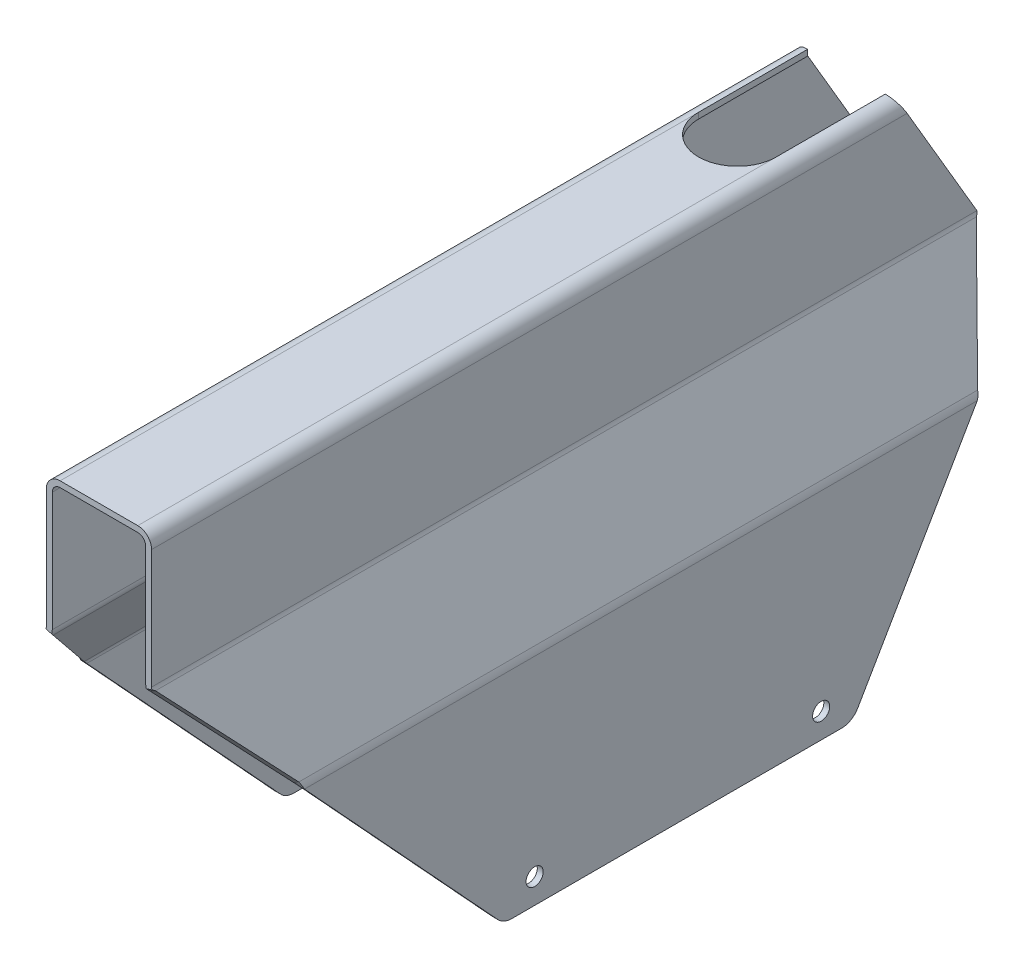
ISO-10303-21;
HEADER;
FILE_DESCRIPTION(('STEP AP214'),'2;1');
FILE_NAME('part.step','',(''),(''),'','','');
FILE_SCHEMA(('AUTOMOTIVE_DESIGN { 1 0 10303 214 1 1 1 1 }'));
ENDSEC;
DATA;
#1=APPLICATION_CONTEXT('core data for automotive mechanical design processes');
#2=APPLICATION_PROTOCOL_DEFINITION('international standard','automotive_design',2000,#1);
#3=PRODUCT_CONTEXT('',#1,'mechanical');
#4=PRODUCT('Part','Part','',(#3));
#5=PRODUCT_RELATED_PRODUCT_CATEGORY('part','',(#4));
#6=PRODUCT_DEFINITION_FORMATION('','',#4);
#7=PRODUCT_DEFINITION_CONTEXT('part definition',#1,'design');
#8=PRODUCT_DEFINITION('design','',#6,#7);
#9=PRODUCT_DEFINITION_SHAPE('','',#8);
#10=(LENGTH_UNIT() NAMED_UNIT(*) SI_UNIT(.MILLI.,.METRE.));
#11=(NAMED_UNIT(*) PLANE_ANGLE_UNIT() SI_UNIT($,.RADIAN.));
#12=(NAMED_UNIT(*) SI_UNIT($,.STERADIAN.) SOLID_ANGLE_UNIT());
#13=UNCERTAINTY_MEASURE_WITH_UNIT(LENGTH_MEASURE(1.E-05),#10,'distance_accuracy_value','');
#14=(GEOMETRIC_REPRESENTATION_CONTEXT(3) GLOBAL_UNCERTAINTY_ASSIGNED_CONTEXT((#13)) GLOBAL_UNIT_ASSIGNED_CONTEXT((#10,
#11,#12)) REPRESENTATION_CONTEXT('',''));
#15=CARTESIAN_POINT('',(0.,0.,0.));
#16=DIRECTION('',(0.,0.,1.));
#17=DIRECTION('',(1.,0.,0.));
#18=AXIS2_PLACEMENT_3D('',#15,#16,#17);
#19=CARTESIAN_POINT('',(-1.79651610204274E-13,-24.2807076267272,-41.9444339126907));
#20=DIRECTION('',(0.,-0.500991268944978,-0.865452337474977));
#21=DIRECTION('',(0.,0.865452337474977,-0.500991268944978));
#22=AXIS2_PLACEMENT_3D('',#19,#20,#21);
#23=PLANE('',#22);
#24=DIRECTION('',(1.,0.,0.));
#25=VECTOR('',#24,1.);
#26=CARTESIAN_POINT('',(-34.0000000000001,64.9089253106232,-93.5743451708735));
#27=LINE('',#26,#25);
#28=CARTESIAN_POINT('',(33.99,64.9089253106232,-93.5743451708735));
#29=VERTEX_POINT('',#28);
#30=CARTESIAN_POINT('',(-31.4600000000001,64.9089253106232,-93.5743451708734));
#31=VERTEX_POINT('',#30);
#32=EDGE_CURVE('E396',#29,#31,#27,.F.);
#33=ORIENTED_EDGE('',*,*,#32,.F.);
#34=DIRECTION('',(0.,0.865452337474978,-0.500991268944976));
#35=VECTOR('',#34,1.);
#36=CARTESIAN_POINT('',(33.99,25.9635701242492,-71.0297380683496));
#37=LINE('',#36,#35);
#38=CARTESIAN_POINT('',(33.99,25.9635701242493,-71.0297380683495));
#39=VERTEX_POINT('',#38);
#40=EDGE_CURVE('E379',#39,#29,#37,.T.);
#41=ORIENTED_EDGE('',*,*,#40,.F.);
#42=DIRECTION('',(1.,0.,0.));
#43=VECTOR('',#42,1.);
#44=CARTESIAN_POINT('',(33.99,25.9635701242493,-71.0297380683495));
#45=LINE('',#44,#43);
#46=CARTESIAN_POINT('',(-31.4600000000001,25.9635701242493,-71.0297380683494));
#47=VERTEX_POINT('',#46);
#48=EDGE_CURVE('E380',#47,#39,#45,.T.);
#49=ORIENTED_EDGE('',*,*,#48,.F.);
#50=DIRECTION('',(0.,0.865452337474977,-0.500991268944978));
#51=VECTOR('',#50,1.);
#52=CARTESIAN_POINT('',(-31.4600000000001,64.9089253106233,-93.5743451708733));
#53=LINE('',#52,#51);
#54=EDGE_CURVE('E408',#31,#47,#53,.F.);
#55=ORIENTED_EDGE('',*,*,#54,.F.);
#56=EDGE_LOOP('',(#33,#41,#49,#55));
#57=FACE_BOUND('',#56,.T.);
#58=ADVANCED_FACE('F17',(#57),#23,.T.);
#59=CARTESIAN_POINT('',(33.99,64.9089253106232,-93.5743451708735));
#60=DIRECTION('',(1.,0.,0.));
#61=DIRECTION('',(0.,0.,-1.));
#62=AXIS2_PLACEMENT_3D('',#59,#60,#61);
#63=PLANE('',#62);
#64=ORIENTED_EDGE('',*,*,#40,.T.);
#65=DIRECTION('',(0.,0.500991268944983,0.865452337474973));
#66=VECTOR('',#65,1.);
#67=CARTESIAN_POINT('',(33.99,64.9089253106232,-93.5743451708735));
#68=LINE('',#67,#66);
#69=CARTESIAN_POINT('',(33.99,65.8594961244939,-91.9322532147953));
#70=VERTEX_POINT('',#69);
#71=EDGE_CURVE('E365',#29,#70,#68,.T.);
#72=ORIENTED_EDGE('',*,*,#71,.T.);
#73=DIRECTION('',(0.,0.865452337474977,-0.500991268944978));
#74=VECTOR('',#73,1.);
#75=CARTESIAN_POINT('',(33.99,-23.3301368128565,-40.3023419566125));
#76=LINE('',#75,#74);
#77=CARTESIAN_POINT('',(33.99,26.91414093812,-69.3876461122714));
#78=VERTEX_POINT('',#77);
#79=EDGE_CURVE('E373',#70,#78,#76,.F.);
#80=ORIENTED_EDGE('',*,*,#79,.T.);
#81=DIRECTION('',(0.,-0.500991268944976,-0.865452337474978));
#82=VECTOR('',#81,1.);
#83=CARTESIAN_POINT('',(33.99,25.9635701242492,-71.0297380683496));
#84=LINE('',#83,#82);
#85=EDGE_CURVE('E1282',#39,#78,#84,.F.);
#86=ORIENTED_EDGE('',*,*,#85,.F.);
#87=EDGE_LOOP('',(#64,#72,#80,#86));
#88=FACE_BOUND('',#87,.T.);
#89=ADVANCED_FACE('F376',(#88),#63,.T.);
#90=CARTESIAN_POINT('',(-31.4600000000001,67.1320139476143,-89.7340042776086));
#91=DIRECTION('',(0.,0.865452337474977,-0.500991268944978));
#92=DIRECTION('',(0.,0.500991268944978,0.865452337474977));
#93=AXIS2_PLACEMENT_3D('',#90,#91,#92);
#94=CYLINDRICAL_SURFACE('',#93,4.43738000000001);
#95=ORIENTED_EDGE('',*,*,#54,.T.);
#96=CARTESIAN_POINT('',(-31.46,28.1866587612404,-67.1893971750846));
#97=DIRECTION('',(0.,0.865452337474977,-0.500991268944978));
#98=DIRECTION('',(0.,0.500991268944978,0.865452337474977));
#99=AXIS2_PLACEMENT_3D('',#96,#97,#98);
#100=CIRCLE('',#99,4.43738000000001);
#101=CARTESIAN_POINT('',(-35.8973800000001,28.1866587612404,-67.1893971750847));
#102=VERTEX_POINT('',#101);
#103=EDGE_CURVE('E386',#102,#47,#100,.F.);
#104=ORIENTED_EDGE('',*,*,#103,.F.);
#105=DIRECTION('',(0.,0.865452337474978,-0.500991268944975));
#106=VECTOR('',#105,1.);
#107=CARTESIAN_POINT('',(-35.8973800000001,28.1866587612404,-67.1893971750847));
#108=LINE('',#107,#106);
#109=CARTESIAN_POINT('',(-35.8973800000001,67.1320139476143,-89.7340042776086));
#110=VERTEX_POINT('',#109);
#111=EDGE_CURVE('E414',#102,#110,#108,.T.);
#112=ORIENTED_EDGE('',*,*,#111,.T.);
#113=CARTESIAN_POINT('',(-31.4600000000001,67.1320139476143,-89.7340042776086));
#114=DIRECTION('',(0.,0.865452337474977,-0.500991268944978));
#115=DIRECTION('',(0.,0.500991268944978,0.865452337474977));
#116=AXIS2_PLACEMENT_3D('',#113,#114,#115);
#117=CIRCLE('',#116,4.43738000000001);
#118=EDGE_CURVE('E24',#110,#31,#117,.F.);
#119=ORIENTED_EDGE('',*,*,#118,.T.);
#120=EDGE_LOOP('',(#95,#104,#112,#119));
#121=FACE_BOUND('',#120,.T.);
#122=ADVANCED_FACE('F1295',(#121),#94,.T.);
#123=CARTESIAN_POINT('',(-34.,28.6619441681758,-66.3683511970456));
#124=DIRECTION('',(0.,-0.500991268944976,-0.865452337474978));
#125=DIRECTION('',(0.,0.865452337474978,-0.500991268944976));
#126=AXIS2_PLACEMENT_3D('',#123,#124,#125);
#127=PLANE('',#126);
#128=DIRECTION('',(1.,0.,0.));
#129=VECTOR('',#128,1.);
#130=CARTESIAN_POINT('',(-34.,28.6619441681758,-66.3683511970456));
#131=LINE('',#130,#129);
#132=CARTESIAN_POINT('',(-35.8973800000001,28.6619441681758,-66.3683511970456));
#133=VERTEX_POINT('',#132);
#134=CARTESIAN_POINT('',(-34.,28.6619441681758,-66.3683511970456));
#135=VERTEX_POINT('',#134);
#136=EDGE_CURVE('E403',#133,#135,#131,.T.);
#137=ORIENTED_EDGE('',*,*,#136,.T.);
#138=DIRECTION('',(0.,0.865452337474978,-0.500991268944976));
#139=VECTOR('',#138,1.);
#140=CARTESIAN_POINT('',(-34.,28.6619441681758,-66.3683511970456));
#141=LINE('',#140,#139);
#142=CARTESIAN_POINT('',(-34.0000000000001,27.8408981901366,-65.8930657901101));
#143=VERTEX_POINT('',#142);
#144=EDGE_CURVE('E400',#135,#143,#141,.F.);
#145=ORIENTED_EDGE('',*,*,#144,.T.);
#146=DIRECTION('',(1.,0.,0.));
#147=VECTOR('',#146,1.);
#148=CARTESIAN_POINT('',(-34.,27.8408981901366,-65.8930657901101));
#149=LINE('',#148,#147);
#150=CARTESIAN_POINT('',(-35.8973800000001,27.8408981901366,-65.8930657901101));
#151=VERTEX_POINT('',#150);
#152=EDGE_CURVE('E1205',#151,#143,#149,.T.);
#153=ORIENTED_EDGE('',*,*,#152,.F.);
#154=DIRECTION('',(0.,0.865452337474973,-0.500991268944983));
#155=VECTOR('',#154,1.);
#156=CARTESIAN_POINT('',(-35.8973800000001,27.8408981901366,-65.8930657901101));
#157=LINE('',#156,#155);
#158=EDGE_CURVE('E411',#151,#133,#157,.T.);
#159=ORIENTED_EDGE('',*,*,#158,.T.);
#160=EDGE_LOOP('',(#137,#145,#153,#159));
#161=FACE_BOUND('',#160,.T.);
#162=ADVANCED_FACE('F1360',(#161),#127,.T.);
#163=CARTESIAN_POINT('',(-31.4600000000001,67.1320139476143,-89.7340042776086));
#164=DIRECTION('',(0.,-0.865452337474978,0.500991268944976));
#165=DIRECTION('',(0.,-0.500991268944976,-0.865452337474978));
#166=AXIS2_PLACEMENT_3D('',#163,#164,#165);
#167=PLANE('',#166);
#168=CARTESIAN_POINT('',(-31.4600000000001,67.1320139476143,-89.7340042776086));
#169=DIRECTION('',(0.,0.865452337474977,-0.500991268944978));
#170=DIRECTION('',(0.,0.500991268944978,0.865452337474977));
#171=AXIS2_PLACEMENT_3D('',#168,#169,#170);
#172=CIRCLE('',#171,2.54000000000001);
#173=CARTESIAN_POINT('',(-34.0000000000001,67.1320139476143,-89.7340042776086));
#174=VERTEX_POINT('',#173);
#175=CARTESIAN_POINT('',(-31.4600000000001,65.8594961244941,-91.9322532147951));
#176=VERTEX_POINT('',#175);
#177=EDGE_CURVE('E368',#174,#176,#172,.F.);
#178=ORIENTED_EDGE('',*,*,#177,.T.);
#179=DIRECTION('',(1.,0.,0.));
#180=VECTOR('',#179,1.);
#181=CARTESIAN_POINT('',(-1.7302694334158E-13,65.859496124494,-91.9322532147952));
#182=LINE('',#181,#180);
#183=EDGE_CURVE('E361',#176,#70,#182,.T.);
#184=ORIENTED_EDGE('',*,*,#183,.T.);
#185=ORIENTED_EDGE('',*,*,#71,.F.);
#186=ORIENTED_EDGE('',*,*,#32,.T.);
#187=ORIENTED_EDGE('',*,*,#118,.F.);
#188=DIRECTION('',(0.,0.500991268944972,0.86545233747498));
#189=VECTOR('',#188,1.);
#190=CARTESIAN_POINT('',(-35.8973800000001,67.6072993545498,-88.9129582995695));
#191=LINE('',#190,#189);
#192=CARTESIAN_POINT('',(-35.8973800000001,67.6072993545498,-88.9129582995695));
#193=VERTEX_POINT('',#192);
#194=EDGE_CURVE('E336',#110,#193,#191,.T.);
#195=ORIENTED_EDGE('',*,*,#194,.T.);
#196=DIRECTION('',(1.,0.,0.));
#197=VECTOR('',#196,1.);
#198=CARTESIAN_POINT('',(-34.0000000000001,67.6072993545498,-88.9129582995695));
#199=LINE('',#198,#197);
#200=CARTESIAN_POINT('',(-34.0000000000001,67.6072993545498,-88.9129582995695));
#201=VERTEX_POINT('',#200);
#202=EDGE_CURVE('E1244',#201,#193,#199,.F.);
#203=ORIENTED_EDGE('',*,*,#202,.F.);
#204=DIRECTION('',(0.,0.500991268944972,0.86545233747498));
#205=VECTOR('',#204,1.);
#206=CARTESIAN_POINT('',(-34.0000000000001,67.6072993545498,-88.9129582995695));
#207=LINE('',#206,#205);
#208=EDGE_CURVE('E1267',#201,#174,#207,.F.);
#209=ORIENTED_EDGE('',*,*,#208,.T.);
#210=EDGE_LOOP('',(#178,#184,#185,#186,#187,#195,#203,#209));
#211=FACE_BOUND('',#210,.T.);
#212=ADVANCED_FACE('F363',(#211),#167,.F.);
#213=CARTESIAN_POINT('',(-1.7302694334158E-13,-23.3301368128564,-40.3023419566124));
#214=DIRECTION('',(0.,-0.500991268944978,-0.865452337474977));
#215=DIRECTION('',(0.,0.865452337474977,-0.500991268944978));
#216=AXIS2_PLACEMENT_3D('',#213,#214,#215);
#217=PLANE('',#216);
#218=DIRECTION('',(1.,0.,0.));
#219=VECTOR('',#218,1.);
#220=CARTESIAN_POINT('',(-1.7302694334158E-13,26.9141409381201,-69.3876461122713));
#221=LINE('',#220,#219);
#222=CARTESIAN_POINT('',(-31.4600000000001,26.9141409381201,-69.3876461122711));
#223=VERTEX_POINT('',#222);
#224=EDGE_CURVE('E384',#78,#223,#221,.F.);
#225=ORIENTED_EDGE('',*,*,#224,.F.);
#226=ORIENTED_EDGE('',*,*,#79,.F.);
#227=ORIENTED_EDGE('',*,*,#183,.F.);
#228=DIRECTION('',(0.,0.865452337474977,-0.500991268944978));
#229=VECTOR('',#228,1.);
#230=CARTESIAN_POINT('',(-31.4600000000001,65.8594961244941,-91.9322532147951));
#231=LINE('',#230,#229);
#232=EDGE_CURVE('E1247',#176,#223,#231,.F.);
#233=ORIENTED_EDGE('',*,*,#232,.T.);
#234=EDGE_LOOP('',(#225,#226,#227,#233));
#235=FACE_BOUND('',#234,.T.);
#236=ADVANCED_FACE('F383',(#235),#217,.F.);
#237=CARTESIAN_POINT('',(-31.46,28.1866587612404,-67.1893971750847));
#238=DIRECTION('',(0.,-0.865452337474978,0.500991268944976));
#239=DIRECTION('',(0.,-0.500991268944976,-0.865452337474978));
#240=AXIS2_PLACEMENT_3D('',#237,#238,#239);
#241=PLANE('',#240);
#242=CARTESIAN_POINT('',(-31.46,28.1866587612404,-67.1893971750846));
#243=DIRECTION('',(0.,0.865452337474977,-0.500991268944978));
#244=DIRECTION('',(0.,0.500991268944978,0.865452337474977));
#245=AXIS2_PLACEMENT_3D('',#242,#243,#244);
#246=CIRCLE('',#245,2.54000000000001);
#247=CARTESIAN_POINT('',(-34.0000000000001,28.1866587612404,-67.1893971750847));
#248=VERTEX_POINT('',#247);
#249=EDGE_CURVE('E1202',#223,#248,#246,.T.);
#250=ORIENTED_EDGE('',*,*,#249,.T.);
#251=DIRECTION('',(0.,-0.500991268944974,-0.865452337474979));
#252=VECTOR('',#251,1.);
#253=CARTESIAN_POINT('',(-34.,28.1866587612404,-67.1893971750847));
#254=LINE('',#253,#252);
#255=EDGE_CURVE('E346',#248,#135,#254,.F.);
#256=ORIENTED_EDGE('',*,*,#255,.T.);
#257=ORIENTED_EDGE('',*,*,#136,.F.);
#258=DIRECTION('',(0.,-0.500991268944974,-0.865452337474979));
#259=VECTOR('',#258,1.);
#260=CARTESIAN_POINT('',(-35.8973800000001,28.1866587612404,-67.1893971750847));
#261=LINE('',#260,#259);
#262=EDGE_CURVE('E1278',#133,#102,#261,.T.);
#263=ORIENTED_EDGE('',*,*,#262,.T.);
#264=ORIENTED_EDGE('',*,*,#103,.T.);
#265=ORIENTED_EDGE('',*,*,#48,.T.);
#266=ORIENTED_EDGE('',*,*,#85,.T.);
#267=ORIENTED_EDGE('',*,*,#224,.T.);
#268=EDGE_LOOP('',(#250,#256,#257,#263,#264,#265,#266,#267));
#269=FACE_BOUND('',#268,.T.);
#270=ADVANCED_FACE('F1288',(#269),#241,.T.);
#271=CARTESIAN_POINT('',(-34.0000000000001,68.4283453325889,-89.3882437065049));
#272=DIRECTION('',(0.,-0.500991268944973,-0.865452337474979));
#273=DIRECTION('',(0.,0.865452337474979,-0.500991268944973));
#274=AXIS2_PLACEMENT_3D('',#271,#272,#273);
#275=PLANE('',#274);
#276=DIRECTION('',(1.,0.,0.));
#277=VECTOR('',#276,1.);
#278=CARTESIAN_POINT('',(-34.0000000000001,68.4283453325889,-89.3882437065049));
#279=LINE('',#278,#277);
#280=CARTESIAN_POINT('',(-34.0000000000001,68.4283453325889,-89.3882437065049));
#281=VERTEX_POINT('',#280);
#282=CARTESIAN_POINT('',(-35.8973800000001,68.4283453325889,-89.3882437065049));
#283=VERTEX_POINT('',#282);
#284=EDGE_CURVE('E1198',#281,#283,#279,.F.);
#285=ORIENTED_EDGE('',*,*,#284,.F.);
#286=DIRECTION('',(0.,0.865452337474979,-0.500991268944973));
#287=VECTOR('',#286,1.);
#288=CARTESIAN_POINT('',(-34.0000000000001,68.4283453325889,-89.3882437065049));
#289=LINE('',#288,#287);
#290=EDGE_CURVE('E415',#281,#201,#289,.F.);
#291=ORIENTED_EDGE('',*,*,#290,.T.);
#292=ORIENTED_EDGE('',*,*,#202,.T.);
#293=DIRECTION('',(0.,0.865452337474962,-0.500991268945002));
#294=VECTOR('',#293,1.);
#295=CARTESIAN_POINT('',(-35.8973800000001,67.6072993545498,-88.9129582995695));
#296=LINE('',#295,#294);
#297=EDGE_CURVE('E1236',#193,#283,#296,.T.);
#298=ORIENTED_EDGE('',*,*,#297,.T.);
#299=EDGE_LOOP('',(#285,#291,#292,#298));
#300=FACE_BOUND('',#299,.T.);
#301=ADVANCED_FACE('F1300',(#300),#275,.T.);
#302=CARTESIAN_POINT('',(-35.8973800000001,0.,150.));
#303=DIRECTION('',(1.,0.,0.));
#304=DIRECTION('',(0.,0.,-1.));
#305=AXIS2_PLACEMENT_3D('',#302,#303,#304);
#306=PLANE('',#305);
#307=CARTESIAN_POINT('',(-35.8973800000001,6.00000000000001,53.3714737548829));
#308=DIRECTION('',(1.,0.,0.));
#309=DIRECTION('',(0.,0.,-1.));
#310=AXIS2_PLACEMENT_3D('',#307,#308,#309);
#311=CIRCLE('',#310,6.00000000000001);
#312=CARTESIAN_POINT('',(-35.8973800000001,1.93221730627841,57.7820455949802));
#313=VERTEX_POINT('',#312);
#314=CARTESIAN_POINT('',(-35.8973800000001,0.,53.3714737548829));
#315=VERTEX_POINT('',#314);
#316=EDGE_CURVE('E1229',#313,#315,#311,.T.);
#317=ORIENTED_EDGE('',*,*,#316,.F.);
#318=DIRECTION('',(0.,0.735095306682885,0.677963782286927));
#319=VECTOR('',#318,1.);
#320=CARTESIAN_POINT('',(-35.8973800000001,46.8465914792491,99.2056796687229));
#321=LINE('',#320,#319);
#322=CARTESIAN_POINT('',(-35.8973800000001,69.3027582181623,119.91655565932));
#323=VERTEX_POINT('',#322);
#324=EDGE_CURVE('E1184',#313,#323,#321,.T.);
#325=ORIENTED_EDGE('',*,*,#324,.T.);
#326=DIRECTION('',(0.,0.,-1.));
#327=VECTOR('',#326,1.);
#328=CARTESIAN_POINT('',(-35.8973800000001,69.3027582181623,150.));
#329=LINE('',#328,#327);
#330=CARTESIAN_POINT('',(-35.8973800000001,69.3027582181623,-96.1178381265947));
#331=VERTEX_POINT('',#330);
#332=EDGE_CURVE('E1176',#331,#323,#329,.F.);
#333=ORIENTED_EDGE('',*,*,#332,.F.);
#334=DIRECTION('',(0.,-0.865452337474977,0.500991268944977));
#335=VECTOR('',#334,1.);
#336=CARTESIAN_POINT('',(-35.8973800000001,-89.318317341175,-4.29559617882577));
#337=LINE('',#336,#335);
#338=CARTESIAN_POINT('',(-35.8973800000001,65.7299712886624,-94.0496305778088));
#339=VERTEX_POINT('',#338);
#340=EDGE_CURVE('E1181',#331,#339,#337,.T.);
#341=ORIENTED_EDGE('',*,*,#340,.T.);
#342=DIRECTION('',(0.,-0.500991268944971,-0.865452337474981));
#343=VECTOR('',#342,1.);
#344=CARTESIAN_POINT('',(-35.8973800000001,65.7299712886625,-94.0496305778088));
#345=LINE('',#344,#343);
#346=EDGE_CURVE('E1201',#283,#339,#345,.T.);
#347=ORIENTED_EDGE('',*,*,#346,.F.);
#348=ORIENTED_EDGE('',*,*,#297,.F.);
#349=ORIENTED_EDGE('',*,*,#194,.F.);
#350=ORIENTED_EDGE('',*,*,#111,.F.);
#351=ORIENTED_EDGE('',*,*,#262,.F.);
#352=ORIENTED_EDGE('',*,*,#158,.F.);
#353=DIRECTION('',(0.,0.500991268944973,0.865452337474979));
#354=VECTOR('',#353,1.);
#355=CARTESIAN_POINT('',(-35.8973800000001,27.8408981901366,-65.8930657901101));
#356=LINE('',#355,#354);
#357=CARTESIAN_POINT('',(-35.8973800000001,25.1425241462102,-70.554452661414));
#358=VERTEX_POINT('',#357);
#359=EDGE_CURVE('E1208',#358,#151,#356,.T.);
#360=ORIENTED_EDGE('',*,*,#359,.F.);
#361=DIRECTION('',(0.,-0.865452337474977,0.500991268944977));
#362=VECTOR('',#361,1.);
#363=CARTESIAN_POINT('',(-35.8973800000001,-89.318317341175,-4.29559617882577));
#364=LINE('',#363,#362);
#365=CARTESIAN_POINT('',(-35.8973800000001,2.99405238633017,-57.7331908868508));
#366=VERTEX_POINT('',#365);
#367=EDGE_CURVE('E1212',#358,#366,#364,.T.);
#368=ORIENTED_EDGE('',*,*,#367,.T.);
#369=CARTESIAN_POINT('',(-35.8973800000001,6.00000000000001,-52.540476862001));
#370=DIRECTION('',(1.,0.,0.));
#371=DIRECTION('',(0.,0.,-1.));
#372=AXIS2_PLACEMENT_3D('',#369,#370,#371);
#373=CIRCLE('',#372,6.00000000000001);
#374=CARTESIAN_POINT('',(-35.8973800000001,0.,-52.5404768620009));
#375=VERTEX_POINT('',#374);
#376=EDGE_CURVE('E1224',#375,#366,#373,.T.);
#377=ORIENTED_EDGE('',*,*,#376,.F.);
#378=DIRECTION('',(0.,0.,1.));
#379=VECTOR('',#378,1.);
#380=CARTESIAN_POINT('',(-35.8973800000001,0.,150.));
#381=LINE('',#380,#379);
#382=EDGE_CURVE('E1225',#315,#375,#381,.F.);
#383=ORIENTED_EDGE('',*,*,#382,.F.);
#384=EDGE_LOOP('',(#317,#325,#333,#341,#347,#348,#349,#350,#351,#352,#360,#368,#377,#383));
#385=FACE_BOUND('',#384,.T.);
#386=CARTESIAN_POINT('',(-35.8973800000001,7.99999999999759,-46.0000000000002));
#387=DIRECTION('',(-1.,0.,0.));
#388=DIRECTION('',(0.,0.,1.));
#389=AXIS2_PLACEMENT_3D('',#386,#387,#388);
#390=CIRCLE('',#389,2.74999999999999);
#391=CARTESIAN_POINT('',(-35.8973800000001,7.99999999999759,-43.2500000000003));
#392=VERTEX_POINT('',#391);
#393=EDGE_CURVE('E1329',#392,#392,#390,.F.);
#394=ORIENTED_EDGE('',*,*,#393,.T.);
#395=EDGE_LOOP('',(#394));
#396=FACE_BOUND('',#395,.T.);
#397=CARTESIAN_POINT('',(-35.8973800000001,7.99999999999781,46.));
#398=DIRECTION('',(-1.,0.,0.));
#399=DIRECTION('',(0.,0.,1.));
#400=AXIS2_PLACEMENT_3D('',#397,#398,#399);
#401=CIRCLE('',#400,2.74999999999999);
#402=CARTESIAN_POINT('',(-35.8973800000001,7.99999999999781,48.75));
#403=VERTEX_POINT('',#402);
#404=EDGE_CURVE('E1239',#403,#403,#401,.F.);
#405=ORIENTED_EDGE('',*,*,#404,.T.);
#406=EDGE_LOOP('',(#405));
#407=FACE_BOUND('',#406,.T.);
#408=ADVANCED_FACE('F1303',(#385,#396,#407),#306,.F.);
#409=CARTESIAN_POINT('',(-35.8973800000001,7.99999999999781,46.));
#410=DIRECTION('',(-1.,0.,0.));
#411=DIRECTION('',(0.,0.,1.));
#412=AXIS2_PLACEMENT_3D('',#409,#410,#411);
#413=CYLINDRICAL_SURFACE('',#412,2.74999999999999);
#414=CARTESIAN_POINT('',(-34.0000000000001,7.99999999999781,46.));
#415=DIRECTION('',(-1.,0.,0.));
#416=DIRECTION('',(0.,0.,1.));
#417=AXIS2_PLACEMENT_3D('',#414,#415,#416);
#418=CIRCLE('',#417,2.74999999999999);
#419=CARTESIAN_POINT('',(-34.0000000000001,7.99999999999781,48.75));
#420=VERTEX_POINT('',#419);
#421=EDGE_CURVE('E1179',#420,#420,#418,.T.);
#422=ORIENTED_EDGE('',*,*,#421,.F.);
#423=EDGE_LOOP('',(#422));
#424=FACE_BOUND('',#423,.T.);
#425=ORIENTED_EDGE('',*,*,#404,.F.);
#426=EDGE_LOOP('',(#425));
#427=FACE_BOUND('',#426,.T.);
#428=ADVANCED_FACE('F1336',(#424,#427),#413,.F.);
#429=CARTESIAN_POINT('',(-35.8973800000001,7.99999999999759,-46.0000000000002));
#430=DIRECTION('',(-1.,0.,0.));
#431=DIRECTION('',(0.,0.,1.));
#432=AXIS2_PLACEMENT_3D('',#429,#430,#431);
#433=CYLINDRICAL_SURFACE('',#432,2.74999999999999);
#434=CARTESIAN_POINT('',(-34.0000000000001,7.99999999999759,-46.0000000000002));
#435=DIRECTION('',(-1.,0.,0.));
#436=DIRECTION('',(0.,0.,1.));
#437=AXIS2_PLACEMENT_3D('',#434,#435,#436);
#438=CIRCLE('',#437,2.74999999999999);
#439=CARTESIAN_POINT('',(-34.0000000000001,7.99999999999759,-43.2500000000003));
#440=VERTEX_POINT('',#439);
#441=EDGE_CURVE('E1167',#440,#440,#438,.T.);
#442=ORIENTED_EDGE('',*,*,#441,.F.);
#443=EDGE_LOOP('',(#442));
#444=FACE_BOUND('',#443,.T.);
#445=ORIENTED_EDGE('',*,*,#393,.F.);
#446=EDGE_LOOP('',(#445));
#447=FACE_BOUND('',#446,.T.);
#448=ADVANCED_FACE('F1338',(#444,#447),#433,.F.);
#449=CARTESIAN_POINT('',(-34.0000000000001,6.00000000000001,53.3714737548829));
#450=DIRECTION('',(1.,0.,0.));
#451=DIRECTION('',(0.,0.,-1.));
#452=AXIS2_PLACEMENT_3D('',#449,#450,#451);
#453=CYLINDRICAL_SURFACE('',#452,6.00000000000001);
#454=ORIENTED_EDGE('',*,*,#316,.T.);
#455=DIRECTION('',(1.,0.,0.));
#456=VECTOR('',#455,1.);
#457=CARTESIAN_POINT('',(-34.0000000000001,0.,53.3714737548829));
#458=LINE('',#457,#456);
#459=CARTESIAN_POINT('',(-34.0000000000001,0.,53.3714737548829));
#460=VERTEX_POINT('',#459);
#461=EDGE_CURVE('E1226',#460,#315,#458,.F.);
#462=ORIENTED_EDGE('',*,*,#461,.F.);
#463=CARTESIAN_POINT('',(-34.0000000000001,6.00000000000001,53.3714737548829));
#464=DIRECTION('',(1.,0.,0.));
#465=DIRECTION('',(0.,0.,-1.));
#466=AXIS2_PLACEMENT_3D('',#463,#464,#465);
#467=CIRCLE('',#466,6.00000000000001);
#468=CARTESIAN_POINT('',(-34.0000000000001,1.93221730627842,57.7820455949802));
#469=VERTEX_POINT('',#468);
#470=EDGE_CURVE('E1163',#469,#460,#467,.T.);
#471=ORIENTED_EDGE('',*,*,#470,.F.);
#472=DIRECTION('',(1.,0.,0.));
#473=VECTOR('',#472,1.);
#474=CARTESIAN_POINT('',(-34.0000000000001,1.93221730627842,57.7820455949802));
#475=LINE('',#474,#473);
#476=EDGE_CURVE('E1188',#469,#313,#475,.F.);
#477=ORIENTED_EDGE('',*,*,#476,.T.);
#478=EDGE_LOOP('',(#454,#462,#471,#477));
#479=FACE_BOUND('',#478,.T.);
#480=ADVANCED_FACE('F1345',(#479),#453,.T.);
#481=CARTESIAN_POINT('',(-34.0000000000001,0.,150.));
#482=DIRECTION('',(0.,-1.,0.));
#483=DIRECTION('',(1.,0.,0.));
#484=AXIS2_PLACEMENT_3D('',#481,#482,#483);
#485=PLANE('',#484);
#486=ORIENTED_EDGE('',*,*,#382,.T.);
#487=DIRECTION('',(1.,0.,0.));
#488=VECTOR('',#487,1.);
#489=CARTESIAN_POINT('',(-34.0000000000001,0.,-52.5404768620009));
#490=LINE('',#489,#488);
#491=CARTESIAN_POINT('',(-34.0000000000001,0.,-52.5404768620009));
#492=VERTEX_POINT('',#491);
#493=EDGE_CURVE('E1221',#492,#375,#490,.F.);
#494=ORIENTED_EDGE('',*,*,#493,.F.);
#495=DIRECTION('',(0.,0.,-1.));
#496=VECTOR('',#495,1.);
#497=CARTESIAN_POINT('',(-34.0000000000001,0.,150.));
#498=LINE('',#497,#496);
#499=EDGE_CURVE('E1160',#460,#492,#498,.T.);
#500=ORIENTED_EDGE('',*,*,#499,.F.);
#501=ORIENTED_EDGE('',*,*,#461,.T.);
#502=EDGE_LOOP('',(#486,#494,#500,#501));
#503=FACE_BOUND('',#502,.T.);
#504=ADVANCED_FACE('F1426',(#503),#485,.T.);
#505=CARTESIAN_POINT('',(-34.0000000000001,6.00000000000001,-52.540476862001));
#506=DIRECTION('',(1.,0.,0.));
#507=DIRECTION('',(0.,0.,-1.));
#508=AXIS2_PLACEMENT_3D('',#505,#506,#507);
#509=CYLINDRICAL_SURFACE('',#508,6.00000000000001);
#510=ORIENTED_EDGE('',*,*,#376,.T.);
#511=DIRECTION('',(1.,0.,0.));
#512=VECTOR('',#511,1.);
#513=CARTESIAN_POINT('',(-34.0000000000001,2.99405238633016,-57.7331908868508));
#514=LINE('',#513,#512);
#515=CARTESIAN_POINT('',(-34.0000000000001,2.99405238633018,-57.7331908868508));
#516=VERTEX_POINT('',#515);
#517=EDGE_CURVE('E1209',#366,#516,#514,.T.);
#518=ORIENTED_EDGE('',*,*,#517,.T.);
#519=CARTESIAN_POINT('',(-34.0000000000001,6.00000000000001,-52.540476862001));
#520=DIRECTION('',(1.,0.,0.));
#521=DIRECTION('',(0.,0.,-1.));
#522=AXIS2_PLACEMENT_3D('',#519,#520,#521);
#523=CIRCLE('',#522,6.00000000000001);
#524=EDGE_CURVE('E1157',#492,#516,#523,.T.);
#525=ORIENTED_EDGE('',*,*,#524,.F.);
#526=ORIENTED_EDGE('',*,*,#493,.T.);
#527=EDGE_LOOP('',(#510,#518,#525,#526));
#528=FACE_BOUND('',#527,.T.);
#529=ADVANCED_FACE('F1435',(#528),#509,.T.);
#530=CARTESIAN_POINT('',(-34.0000000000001,-89.318317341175,-4.29559617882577));
#531=DIRECTION('',(0.,0.500991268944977,0.865452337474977));
#532=DIRECTION('',(0.,-0.865452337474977,0.500991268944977));
#533=AXIS2_PLACEMENT_3D('',#530,#531,#532);
#534=PLANE('',#533);
#535=ORIENTED_EDGE('',*,*,#517,.F.);
#536=ORIENTED_EDGE('',*,*,#367,.F.);
#537=DIRECTION('',(1.,0.,0.));
#538=VECTOR('',#537,1.);
#539=CARTESIAN_POINT('',(-34.,25.1425241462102,-70.554452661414));
#540=LINE('',#539,#538);
#541=CARTESIAN_POINT('',(-34.0000000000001,25.1425241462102,-70.554452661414));
#542=VERTEX_POINT('',#541);
#543=EDGE_CURVE('E1211',#542,#358,#540,.F.);
#544=ORIENTED_EDGE('',*,*,#543,.F.);
#545=DIRECTION('',(0.,0.865452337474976,-0.500991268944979));
#546=VECTOR('',#545,1.);
#547=CARTESIAN_POINT('',(-34.0000000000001,2.99405238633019,-57.7331908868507));
#548=LINE('',#547,#546);
#549=EDGE_CURVE('E1153',#516,#542,#548,.T.);
#550=ORIENTED_EDGE('',*,*,#549,.F.);
#551=EDGE_LOOP('',(#535,#536,#544,#550));
#552=FACE_BOUND('',#551,.T.);
#553=ADVANCED_FACE('F1445',(#552),#534,.F.);
#554=CARTESIAN_POINT('',(-34.,27.8408981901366,-65.8930657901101));
#555=DIRECTION('',(0.,0.865452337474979,-0.500991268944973));
#556=DIRECTION('',(0.,0.500991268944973,0.865452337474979));
#557=AXIS2_PLACEMENT_3D('',#554,#555,#556);
#558=PLANE('',#557);
#559=ORIENTED_EDGE('',*,*,#152,.T.);
#560=DIRECTION('',(0.,0.500991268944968,0.865452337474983));
#561=VECTOR('',#560,1.);
#562=CARTESIAN_POINT('',(-34.0000000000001,25.1425241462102,-70.554452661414));
#563=LINE('',#562,#561);
#564=EDGE_CURVE('E1156',#542,#143,#563,.T.);
#565=ORIENTED_EDGE('',*,*,#564,.F.);
#566=ORIENTED_EDGE('',*,*,#543,.T.);
#567=ORIENTED_EDGE('',*,*,#359,.T.);
#568=EDGE_LOOP('',(#559,#565,#566,#567));
#569=FACE_BOUND('',#568,.T.);
#570=ADVANCED_FACE('F1455',(#569),#558,.T.);
#571=CARTESIAN_POINT('',(-31.4600000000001,67.1320139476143,-89.7340042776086));
#572=DIRECTION('',(0.,0.865452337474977,-0.500991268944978));
#573=DIRECTION('',(0.,0.500991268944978,0.865452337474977));
#574=AXIS2_PLACEMENT_3D('',#571,#572,#573);
#575=CYLINDRICAL_SURFACE('',#574,2.54000000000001);
#576=ORIENTED_EDGE('',*,*,#249,.F.);
#577=ORIENTED_EDGE('',*,*,#232,.F.);
#578=ORIENTED_EDGE('',*,*,#177,.F.);
#579=DIRECTION('',(0.,0.865452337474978,-0.500991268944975));
#580=VECTOR('',#579,1.);
#581=CARTESIAN_POINT('',(-34.0000000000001,28.1866587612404,-67.1893971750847));
#582=LINE('',#581,#580);
#583=EDGE_CURVE('E1195',#248,#174,#582,.T.);
#584=ORIENTED_EDGE('',*,*,#583,.F.);
#585=EDGE_LOOP('',(#576,#577,#578,#584));
#586=FACE_BOUND('',#585,.T.);
#587=ADVANCED_FACE('F1321',(#586),#575,.F.);
#588=CARTESIAN_POINT('',(-34.0000000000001,65.7299712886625,-94.0496305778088));
#589=DIRECTION('',(0.,-0.865452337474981,0.500991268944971));
#590=DIRECTION('',(0.,-0.500991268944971,-0.865452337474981));
#591=AXIS2_PLACEMENT_3D('',#588,#589,#590);
#592=PLANE('',#591);
#593=DIRECTION('',(1.,0.,0.));
#594=VECTOR('',#593,1.);
#595=CARTESIAN_POINT('',(-34.0000000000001,65.7299712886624,-94.0496305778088));
#596=LINE('',#595,#594);
#597=CARTESIAN_POINT('',(-34.0000000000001,65.7299712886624,-94.0496305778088));
#598=VERTEX_POINT('',#597);
#599=EDGE_CURVE('E1180',#339,#598,#596,.T.);
#600=ORIENTED_EDGE('',*,*,#599,.T.);
#601=DIRECTION('',(0.,-0.500991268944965,-0.865452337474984));
#602=VECTOR('',#601,1.);
#603=CARTESIAN_POINT('',(-34.0000000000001,68.4283453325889,-89.3882437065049));
#604=LINE('',#603,#602);
#605=EDGE_CURVE('E1171',#281,#598,#604,.T.);
#606=ORIENTED_EDGE('',*,*,#605,.F.);
#607=ORIENTED_EDGE('',*,*,#284,.T.);
#608=ORIENTED_EDGE('',*,*,#346,.T.);
#609=EDGE_LOOP('',(#600,#606,#607,#608));
#610=FACE_BOUND('',#609,.T.);
#611=ADVANCED_FACE('F1310',(#610),#592,.T.);
#612=CARTESIAN_POINT('',(-34.0000000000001,46.8465914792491,99.2056796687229));
#613=DIRECTION('',(0.,0.677963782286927,-0.735095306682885));
#614=DIRECTION('',(0.,0.735095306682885,0.677963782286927));
#615=AXIS2_PLACEMENT_3D('',#612,#613,#614);
#616=PLANE('',#615);
#617=ORIENTED_EDGE('',*,*,#476,.F.);
#618=DIRECTION('',(0.,-0.735095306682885,-0.677963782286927));
#619=VECTOR('',#618,1.);
#620=CARTESIAN_POINT('',(-34.0000000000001,69.3027582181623,119.91655565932));
#621=LINE('',#620,#619);
#622=CARTESIAN_POINT('',(-34.0000000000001,69.3027582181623,119.91655565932));
#623=VERTEX_POINT('',#622);
#624=EDGE_CURVE('E1164',#623,#469,#621,.T.);
#625=ORIENTED_EDGE('',*,*,#624,.F.);
#626=DIRECTION('',(1.,0.,0.));
#627=VECTOR('',#626,1.);
#628=CARTESIAN_POINT('',(-34.9486900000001,69.3027582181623,119.91655565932));
#629=LINE('',#628,#627);
#630=EDGE_CURVE('E1148',#323,#623,#629,.T.);
#631=ORIENTED_EDGE('',*,*,#630,.F.);
#632=ORIENTED_EDGE('',*,*,#324,.F.);
#633=EDGE_LOOP('',(#617,#625,#631,#632));
#634=FACE_BOUND('',#633,.T.);
#635=ADVANCED_FACE('F1482',(#634),#616,.F.);
#636=CARTESIAN_POINT('',(-34.0000000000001,-89.318317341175,-4.29559617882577));
#637=DIRECTION('',(0.,0.500991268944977,0.865452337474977));
#638=DIRECTION('',(0.,-0.865452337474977,0.500991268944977));
#639=AXIS2_PLACEMENT_3D('',#636,#637,#638);
#640=PLANE('',#639);
#641=ORIENTED_EDGE('',*,*,#599,.F.);
#642=ORIENTED_EDGE('',*,*,#340,.F.);
#643=DIRECTION('',(-1.,0.,0.));
#644=VECTOR('',#643,1.);
#645=CARTESIAN_POINT('',(-34.9486900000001,69.3027582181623,-96.1178381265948));
#646=LINE('',#645,#644);
#647=CARTESIAN_POINT('',(-34.0000000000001,69.3027582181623,-96.1178381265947));
#648=VERTEX_POINT('',#647);
#649=EDGE_CURVE('E1151',#648,#331,#646,.T.);
#650=ORIENTED_EDGE('',*,*,#649,.F.);
#651=DIRECTION('',(0.,0.865452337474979,-0.500991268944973));
#652=VECTOR('',#651,1.);
#653=CARTESIAN_POINT('',(-34.0000000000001,65.7299712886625,-94.0496305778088));
#654=LINE('',#653,#652);
#655=EDGE_CURVE('E1168',#598,#648,#654,.T.);
#656=ORIENTED_EDGE('',*,*,#655,.F.);
#657=EDGE_LOOP('',(#641,#642,#650,#656));
#658=FACE_BOUND('',#657,.T.);
#659=ADVANCED_FACE('F1491',(#658),#640,.F.);
#660=CARTESIAN_POINT('',(-31.4600000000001,69.3027582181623,150.));
#661=DIRECTION('',(0.,0.,-1.));
#662=DIRECTION('',(-1.,0.,0.));
#663=AXIS2_PLACEMENT_3D('',#660,#661,#662);
#664=CYLINDRICAL_SURFACE('',#663,4.43738);
#665=CARTESIAN_POINT('',(-35.8973800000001,69.3027582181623,-96.1178381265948));
#666=CARTESIAN_POINT('',(-35.897390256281,69.4341682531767,-96.1613815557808));
#667=CARTESIAN_POINT('',(-35.8915429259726,69.5655801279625,-96.2049255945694));
#668=CARTESIAN_POINT('',(-35.8682007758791,69.8275252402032,-96.2917225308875));
#669=CARTESIAN_POINT('',(-35.8507009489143,69.9580580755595,-96.3349752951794));
#670=CARTESIAN_POINT('',(-35.8046158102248,70.2144981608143,-96.4199481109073));
#671=CARTESIAN_POINT('',(-35.7762736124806,70.3404447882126,-96.4616812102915));
#672=CARTESIAN_POINT('',(-35.7086504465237,70.5896019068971,-96.5442407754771));
#673=CARTESIAN_POINT('',(-35.6693745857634,70.7128136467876,-96.5850676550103));
#674=CARTESIAN_POINT('',(-35.5783172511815,70.9604281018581,-96.6671160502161));
#675=CARTESIAN_POINT('',(-35.5261068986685,71.0846890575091,-96.7082905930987));
#676=CARTESIAN_POINT('',(-35.4097251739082,71.3297385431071,-96.7894890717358));
#677=CARTESIAN_POINT('',(-35.3454259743,71.4504723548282,-96.8294948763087));
#678=CARTESIAN_POINT('',(-35.2755022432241,71.5682126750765,-96.8685087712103));
#679=B_SPLINE_CURVE_WITH_KNOTS('',3,(#665,#666,#667,#668,#669,#670,#671,#672,#673,#674,#675,
#676,#677,#678),.UNSPECIFIED.,.F.,.F.,(4,2,2,2,2,2,4),(0.,0.415189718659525,0.830557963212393,
1.23711209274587,1.64347662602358,2.0657280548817,2.49272487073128),.UNSPECIFIED.);
#680=CARTESIAN_POINT('',(-35.2755022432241,71.5682126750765,-96.8685087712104));
#681=VERTEX_POINT('',#680);
#682=EDGE_CURVE('E726',#331,#681,#679,.T.);
#683=ORIENTED_EDGE('',*,*,#682,.F.);
#684=ORIENTED_EDGE('',*,*,#332,.T.);
#685=CARTESIAN_POINT('',(-35.2755022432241,71.5682126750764,121.112539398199));
#686=CARTESIAN_POINT('',(-35.346670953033,71.4483586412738,121.049265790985));
#687=CARTESIAN_POINT('',(-35.4118300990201,71.3257449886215,120.984535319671));
#688=CARTESIAN_POINT('',(-35.5300063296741,71.0760203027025,120.8527001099));
#689=CARTESIAN_POINT('',(-35.5830234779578,70.9489092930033,120.785595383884));
#690=CARTESIAN_POINT('',(-35.6758972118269,70.6936737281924,120.650850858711));
#691=CARTESIAN_POINT('',(-35.7159860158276,70.5656150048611,120.583245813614));
#692=CARTESIAN_POINT('',(-35.7842943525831,70.3070921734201,120.446765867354));
#693=CARTESIAN_POINT('',(-35.8125179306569,70.1766289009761,120.377891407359));
#694=CARTESIAN_POINT('',(-35.8555574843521,69.9230842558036,120.24403955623));
#695=CARTESIAN_POINT('',(-35.8711564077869,69.8001060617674,120.179116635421));
#696=CARTESIAN_POINT('',(-35.8921155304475,69.5523426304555,120.048316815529));
#697=CARTESIAN_POINT('',(-35.8973812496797,69.4275511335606,119.982436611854));
#698=CARTESIAN_POINT('',(-35.8973800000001,69.3027582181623,119.91655565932));
#699=B_SPLINE_CURVE_WITH_KNOTS('',3,(#685,#686,#687,#688,#689,#690,#691,#692,#693,#694,#695,
#696,#697,#698),.UNSPECIFIED.,.F.,.F.,(4,2,2,2,2,2,4),(0.,0.459047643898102,0.918092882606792,
1.368362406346,1.81847829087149,2.2379045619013,2.66114824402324),.UNSPECIFIED.);
#700=CARTESIAN_POINT('',(-35.2755022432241,71.5682126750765,121.112539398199));
#701=VERTEX_POINT('',#700);
#702=EDGE_CURVE('E1152',#701,#323,#699,.T.);
#703=ORIENTED_EDGE('',*,*,#702,.F.);
#704=DIRECTION('',(0.,0.,1.));
#705=VECTOR('',#704,1.);
#706=CARTESIAN_POINT('',(-35.2755022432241,71.5682126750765,150.));
#707=LINE('',#706,#705);
#708=EDGE_CURVE('E1137',#701,#681,#707,.F.);
#709=ORIENTED_EDGE('',*,*,#708,.T.);
#710=EDGE_LOOP('',(#683,#684,#703,#709));
#711=FACE_BOUND('',#710,.T.);
#712=ADVANCED_FACE('F1501',(#711),#664,.T.);
#713=CARTESIAN_POINT('',(-34.0000000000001,0.,150.));
#714=DIRECTION('',(1.,0.,0.));
#715=DIRECTION('',(0.,0.,-1.));
#716=AXIS2_PLACEMENT_3D('',#713,#714,#715);
#717=PLANE('',#716);
#718=ORIENTED_EDGE('',*,*,#655,.T.);
#719=DIRECTION('',(0.,0.,-1.));
#720=VECTOR('',#719,1.);
#721=CARTESIAN_POINT('',(-34.0000000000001,69.3027582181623,150.));
#722=LINE('',#721,#720);
#723=EDGE_CURVE('E778',#648,#623,#722,.F.);
#724=ORIENTED_EDGE('',*,*,#723,.T.);
#725=ORIENTED_EDGE('',*,*,#624,.T.);
#726=ORIENTED_EDGE('',*,*,#470,.T.);
#727=ORIENTED_EDGE('',*,*,#499,.T.);
#728=ORIENTED_EDGE('',*,*,#524,.T.);
#729=ORIENTED_EDGE('',*,*,#549,.T.);
#730=ORIENTED_EDGE('',*,*,#564,.T.);
#731=ORIENTED_EDGE('',*,*,#144,.F.);
#732=ORIENTED_EDGE('',*,*,#255,.F.);
#733=ORIENTED_EDGE('',*,*,#583,.T.);
#734=ORIENTED_EDGE('',*,*,#208,.F.);
#735=ORIENTED_EDGE('',*,*,#290,.F.);
#736=ORIENTED_EDGE('',*,*,#605,.T.);
#737=EDGE_LOOP('',(#718,#724,#725,#726,#727,#728,#729,#730,#731,#732,#733,#734,#735,#736));
#738=FACE_BOUND('',#737,.T.);
#739=ORIENTED_EDGE('',*,*,#441,.T.);
#740=EDGE_LOOP('',(#739));
#741=FACE_BOUND('',#740,.T.);
#742=ORIENTED_EDGE('',*,*,#421,.T.);
#743=EDGE_LOOP('',(#742));
#744=FACE_BOUND('',#743,.T.);
#745=ADVANCED_FACE('F1316',(#738,#741,#744),#717,.T.);
#746=CARTESIAN_POINT('',(-31.4600000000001,66.7627582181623,117.573964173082));
#747=CARTESIAN_POINT('',(-31.4600000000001,66.1302982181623,117.573964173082));
#748=CARTESIAN_POINT('',(-31.4600000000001,65.4978382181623,117.573964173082));
#749=CARTESIAN_POINT('',(-31.4600000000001,64.8653782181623,117.573964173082));
#750=CARTESIAN_POINT('',(-36.5400000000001,66.7627582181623,117.573964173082));
#751=CARTESIAN_POINT('',(-37.8049200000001,66.1302982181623,117.573964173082));
#752=CARTESIAN_POINT('',(-39.0698400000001,65.4978382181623,117.573964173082));
#753=CARTESIAN_POINT('',(-40.3347600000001,64.8653782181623,117.573964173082));
#754=CARTESIAN_POINT('',(-36.5400000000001,71.8427582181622,122.259147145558));
#755=CARTESIAN_POINT('',(-37.8049200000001,72.4752182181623,122.259147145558));
#756=CARTESIAN_POINT('',(-39.0698400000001,73.1076782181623,122.259147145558));
#757=CARTESIAN_POINT('',(-40.3347600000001,73.7401382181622,122.259147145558));
#758=CARTESIAN_POINT('',(-31.4600000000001,71.8427582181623,122.259147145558));
#759=CARTESIAN_POINT('',(-31.4600000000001,72.4752182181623,122.259147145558));
#760=CARTESIAN_POINT('',(-31.4600000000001,73.1076782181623,122.259147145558));
#761=CARTESIAN_POINT('',(-31.4600000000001,73.7401382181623,122.259147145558));
#762=CARTESIAN_POINT('',(-26.38,71.8427582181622,122.259147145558));
#763=CARTESIAN_POINT('',(-25.1150800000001,72.4752182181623,122.259147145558));
#764=CARTESIAN_POINT('',(-23.85016,73.1076782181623,122.259147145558));
#765=CARTESIAN_POINT('',(-22.58524,73.7401382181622,122.259147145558));
#766=CARTESIAN_POINT('',(-26.38,66.7627582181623,117.573964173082));
#767=CARTESIAN_POINT('',(-25.1150800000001,66.1302982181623,117.573964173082));
#768=CARTESIAN_POINT('',(-23.85016,65.4978382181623,117.573964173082));
#769=CARTESIAN_POINT('',(-22.58524,64.8653782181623,117.573964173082));
#770=CARTESIAN_POINT('',(-31.4600000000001,66.7627582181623,117.573964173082));
#771=CARTESIAN_POINT('',(-31.4600000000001,66.1302982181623,117.573964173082));
#772=CARTESIAN_POINT('',(-31.4600000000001,65.4978382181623,117.573964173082));
#773=CARTESIAN_POINT('',(-31.4600000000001,64.8653782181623,117.573964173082));
#774=(BOUNDED_SURFACE() B_SPLINE_SURFACE(3,3,((#746,#747,#748,#749),(#750,#751,#752,#753),(#754,
#755,#756,#757),(#758,#759,#760,#761),(#762,#763,#764,#765),(#766,#767,#768,#769),(#770,#771,
#772,#773)),.UNSPECIFIED.,.T.,.F.,.F.) B_SPLINE_SURFACE_WITH_KNOTS((4,3,4),(4,4),(0.,0.5,1.),
(0.,1.),.UNSPECIFIED.) GEOMETRIC_REPRESENTATION_ITEM() RATIONAL_B_SPLINE_SURFACE(((1.,1.,1.,1.),
(0.333333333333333,0.333333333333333,0.333333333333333,0.333333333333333),(0.333333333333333,
0.333333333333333,0.333333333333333,0.333333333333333),(1.,1.,1.,1.),(0.333333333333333,
0.333333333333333,0.333333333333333,0.333333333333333),(0.333333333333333,0.333333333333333,
0.333333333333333,0.333333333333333),(1.,1.,1.,1.))) REPRESENTATION_ITEM('') SURFACE());
#775=CARTESIAN_POINT('',(-34.0000000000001,69.3027582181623,119.91655565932));
#776=CARTESIAN_POINT('',(-33.9999903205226,69.3821321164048,119.989760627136));
#777=CARTESIAN_POINT('',(-33.9962788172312,69.4615119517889,120.06297107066));
#778=CARTESIAN_POINT('',(-33.9813761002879,69.6199527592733,120.209097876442));
#779=CARTESIAN_POINT('',(-33.9701790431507,69.6990134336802,120.282013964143));
#780=CARTESIAN_POINT('',(-33.940454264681,69.855176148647,120.426039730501));
#781=CARTESIAN_POINT('',(-33.9220393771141,69.9322897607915,120.497160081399));
#782=CARTESIAN_POINT('',(-33.8777558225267,70.0853169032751,120.638293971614));
#783=CARTESIAN_POINT('',(-33.8518910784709,70.1612310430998,120.708308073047));
#784=CARTESIAN_POINT('',(-33.7978488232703,70.2979760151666,120.834425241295));
#785=CARTESIAN_POINT('',(-33.7709153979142,70.3590729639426,120.890773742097));
#786=CARTESIAN_POINT('',(-33.7115972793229,70.4802469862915,121.002530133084));
#787=CARTESIAN_POINT('',(-33.67917973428,70.5403153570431,121.05792999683));
#788=CARTESIAN_POINT('',(-33.644031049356,70.5995266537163,121.112539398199));
#789=B_SPLINE_CURVE_WITH_KNOTS('',3,(#775,#776,#777,#778,#779,#780,#781,#782,#783,#784,#785,
#786,#787,#788),.UNSPECIFIED.,.F.,.F.,(4,2,2,2,2,2,4),(0.,0.323882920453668,0.648018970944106,
0.967277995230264,1.28636920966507,1.54830538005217,1.81187012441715),.UNSPECIFIED.);
#790=CARTESIAN_POINT('',(-33.6440310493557,70.5995266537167,121.112539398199));
#791=VERTEX_POINT('',#790);
#792=EDGE_CURVE('E780',#623,#791,#789,.T.);
#793=DIRECTION('',(-0.859854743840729,0.510538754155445,0.));
#794=VECTOR('',#793,1.);
#795=CARTESIAN_POINT('',(-33.6440310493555,70.5995266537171,121.112539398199));
#796=LINE('',#795,#794);
#797=EDGE_CURVE('E1134',#791,#701,#796,.T.);
#798=ORIENTED_EDGE('',*,*,#702,.T.);
#799=ORIENTED_EDGE('',*,*,#630,.T.);
#800=ORIENTED_EDGE('',*,*,#792,.T.);
#801=ORIENTED_EDGE('',*,*,#797,.T.);
#802=EDGE_LOOP('',(#798,#799,#800,#801));
#803=FACE_BOUND('',#802,.T.);
#804=ADVANCED_FACE('F759',(#803),#774,.T.);
#805=CARTESIAN_POINT('',(-31.4600000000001,71.8427582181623,-97.5881881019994));
#806=CARTESIAN_POINT('',(-31.4600000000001,72.4752182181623,-97.5881881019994));
#807=CARTESIAN_POINT('',(-31.4600000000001,73.1076782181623,-97.5881881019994));
#808=CARTESIAN_POINT('',(-31.4600000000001,73.7401382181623,-97.5881881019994));
#809=CARTESIAN_POINT('',(-36.5400000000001,71.8427582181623,-97.5881881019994));
#810=CARTESIAN_POINT('',(-37.8049200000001,72.4752182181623,-97.5881881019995));
#811=CARTESIAN_POINT('',(-39.0698400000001,73.1076782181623,-97.5881881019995));
#812=CARTESIAN_POINT('',(-40.3347600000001,73.7401382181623,-97.5881881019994));
#813=CARTESIAN_POINT('',(-36.5400000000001,66.7627582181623,-94.6474881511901));
#814=CARTESIAN_POINT('',(-37.8049200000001,66.1302982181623,-94.6474881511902));
#815=CARTESIAN_POINT('',(-39.0698400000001,65.4978382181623,-94.6474881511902));
#816=CARTESIAN_POINT('',(-40.3347600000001,64.8653782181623,-94.6474881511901));
#817=CARTESIAN_POINT('',(-31.4600000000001,66.7627582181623,-94.64748815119));
#818=CARTESIAN_POINT('',(-31.4600000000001,66.1302982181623,-94.64748815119));
#819=CARTESIAN_POINT('',(-31.4600000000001,65.4978382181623,-94.64748815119));
#820=CARTESIAN_POINT('',(-31.4600000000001,64.8653782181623,-94.6474881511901));
#821=CARTESIAN_POINT('',(-26.38,66.7627582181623,-94.6474881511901));
#822=CARTESIAN_POINT('',(-25.1150800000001,66.1302982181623,-94.6474881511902));
#823=CARTESIAN_POINT('',(-23.85016,65.4978382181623,-94.6474881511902));
#824=CARTESIAN_POINT('',(-22.58524,64.8653782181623,-94.6474881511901));
#825=CARTESIAN_POINT('',(-26.38,71.8427582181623,-97.5881881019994));
#826=CARTESIAN_POINT('',(-25.1150800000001,72.4752182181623,-97.5881881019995));
#827=CARTESIAN_POINT('',(-23.85016,73.1076782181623,-97.5881881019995));
#828=CARTESIAN_POINT('',(-22.58524,73.7401382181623,-97.5881881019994));
#829=CARTESIAN_POINT('',(-31.4600000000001,71.8427582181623,-97.5881881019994));
#830=CARTESIAN_POINT('',(-31.4600000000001,72.4752182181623,-97.5881881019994));
#831=CARTESIAN_POINT('',(-31.4600000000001,73.1076782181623,-97.5881881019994));
#832=CARTESIAN_POINT('',(-31.4600000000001,73.7401382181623,-97.5881881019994));
#833=(BOUNDED_SURFACE() B_SPLINE_SURFACE(3,3,((#805,#806,#807,#808),(#809,#810,#811,#812),(#813,
#814,#815,#816),(#817,#818,#819,#820),(#821,#822,#823,#824),(#825,#826,#827,#828),(#829,#830,
#831,#832)),.UNSPECIFIED.,.T.,.F.,.F.) B_SPLINE_SURFACE_WITH_KNOTS((4,3,4),(4,4),(0.,0.5,1.),
(0.,1.),.UNSPECIFIED.) GEOMETRIC_REPRESENTATION_ITEM() RATIONAL_B_SPLINE_SURFACE(((1.,1.,1.,1.),
(0.333333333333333,0.333333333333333,0.333333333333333,0.333333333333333),(0.333333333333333,
0.333333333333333,0.333333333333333,0.333333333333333),(1.,1.,1.,1.),(0.333333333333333,
0.333333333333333,0.333333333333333,0.333333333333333),(0.333333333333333,0.333333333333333,
0.333333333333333,0.333333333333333),(1.,1.,1.,1.))) REPRESENTATION_ITEM('') SURFACE());
#834=DIRECTION('',(0.859854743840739,-0.510538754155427,0.));
#835=VECTOR('',#834,1.);
#836=CARTESIAN_POINT('',(-35.2755022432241,71.5682126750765,-96.8685087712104));
#837=LINE('',#836,#835);
#838=CARTESIAN_POINT('',(-33.6440310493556,70.599526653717,-96.8685087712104));
#839=VERTEX_POINT('',#838);
#840=EDGE_CURVE('E1128',#681,#839,#837,.T.);
#841=CARTESIAN_POINT('',(-33.6440310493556,70.599526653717,-96.8685087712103));
#842=CARTESIAN_POINT('',(-33.7285278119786,70.4572832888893,-96.7861672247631));
#843=CARTESIAN_POINT('',(-33.7980408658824,70.3085156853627,-96.7000489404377));
#844=CARTESIAN_POINT('',(-33.9059265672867,70.0058213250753,-96.5248258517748));
#845=CARTESIAN_POINT('',(-33.9448667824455,69.8520466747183,-96.4358090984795));
#846=CARTESIAN_POINT('',(-33.9794701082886,69.631721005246,-96.3082674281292));
#847=CARTESIAN_POINT('',(-33.9871318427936,69.5664325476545,-96.2704733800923));
#848=CARTESIAN_POINT('',(-33.9974144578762,69.4350269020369,-96.194405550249));
#849=CARTESIAN_POINT('',(-33.9999939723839,69.3689072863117,-96.1561303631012));
#850=CARTESIAN_POINT('',(-34.0000000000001,69.3027582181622,-96.1178381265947));
#851=B_SPLINE_CURVE_WITH_KNOTS('',3,(#841,#842,#843,#844,#845,#846,#847,#848,#849,#850),
.UNSPECIFIED.,.F.,.F.,(4,2,2,2,4),(0.,0.55356484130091,1.09659263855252,1.32393635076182,
1.55312297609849),.UNSPECIFIED.);
#852=EDGE_CURVE('E771',#839,#648,#851,.T.);
#853=ORIENTED_EDGE('',*,*,#682,.T.);
#854=ORIENTED_EDGE('',*,*,#840,.T.);
#855=ORIENTED_EDGE('',*,*,#852,.T.);
#856=ORIENTED_EDGE('',*,*,#649,.T.);
#857=EDGE_LOOP('',(#853,#854,#855,#856));
#858=FACE_BOUND('',#857,.T.);
#859=ADVANCED_FACE('F745',(#858),#833,.T.);
#860=CARTESIAN_POINT('',(-19.43738,107.65546139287,-118.319372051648));
#861=CARTESIAN_POINT('',(-19.43738,107.02300139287,-118.319372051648));
#862=CARTESIAN_POINT('',(-19.43738,106.39054139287,-118.319372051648));
#863=CARTESIAN_POINT('',(-19.43738,105.75808139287,-118.319372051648));
#864=CARTESIAN_POINT('',(-10.56262,107.65546139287,-118.319372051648));
#865=CARTESIAN_POINT('',(-11.82754,107.02300139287,-118.319372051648));
#866=CARTESIAN_POINT('',(-13.09246,106.39054139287,-118.319372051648));
#867=CARTESIAN_POINT('',(-14.35738,105.75808139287,-118.319372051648));
#868=CARTESIAN_POINT('',(-10.56262,98.7807013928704,-113.181969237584));
#869=CARTESIAN_POINT('',(-11.82754,99.4131613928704,-113.181969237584));
#870=CARTESIAN_POINT('',(-13.09246,100.04562139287,-113.181969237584));
#871=CARTESIAN_POINT('',(-14.35738,100.67808139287,-113.181969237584));
#872=CARTESIAN_POINT('',(-19.43738,98.7807013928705,-113.181969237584));
#873=CARTESIAN_POINT('',(-19.43738,99.4131613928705,-113.181969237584));
#874=CARTESIAN_POINT('',(-19.43738,100.04562139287,-113.181969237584));
#875=CARTESIAN_POINT('',(-19.43738,100.67808139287,-113.181969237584));
#876=CARTESIAN_POINT('',(-28.31214,98.7807013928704,-113.181969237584));
#877=CARTESIAN_POINT('',(-27.04722,99.4131613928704,-113.181969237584));
#878=CARTESIAN_POINT('',(-25.7823,100.04562139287,-113.181969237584));
#879=CARTESIAN_POINT('',(-24.51738,100.67808139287,-113.181969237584));
#880=CARTESIAN_POINT('',(-28.31214,107.65546139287,-118.319372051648));
#881=CARTESIAN_POINT('',(-27.04722,107.02300139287,-118.319372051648));
#882=CARTESIAN_POINT('',(-25.7823,106.39054139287,-118.319372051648));
#883=CARTESIAN_POINT('',(-24.51738,105.75808139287,-118.319372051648));
#884=CARTESIAN_POINT('',(-19.43738,107.65546139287,-118.319372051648));
#885=CARTESIAN_POINT('',(-19.43738,107.02300139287,-118.319372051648));
#886=CARTESIAN_POINT('',(-19.43738,106.39054139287,-118.319372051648));
#887=CARTESIAN_POINT('',(-19.43738,105.75808139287,-118.319372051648));
#888=(BOUNDED_SURFACE() B_SPLINE_SURFACE(3,3,((#860,#861,#862,#863),(#864,#865,#866,#867),(#868,
#869,#870,#871),(#872,#873,#874,#875),(#876,#877,#878,#879),(#880,#881,#882,#883),(#884,#885,
#886,#887)),.UNSPECIFIED.,.T.,.F.,.F.) B_SPLINE_SURFACE_WITH_KNOTS((4,3,4),(4,4),(0.,0.5,1.),
(0.,1.),.UNSPECIFIED.) GEOMETRIC_REPRESENTATION_ITEM() RATIONAL_B_SPLINE_SURFACE(((1.,1.,1.,1.),
(0.333333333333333,0.333333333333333,0.333333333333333,0.333333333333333),(0.333333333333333,
0.333333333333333,0.333333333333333,0.333333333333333),(1.,1.,1.,1.),(0.333333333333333,
0.333333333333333,0.333333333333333,0.333333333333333),(0.333333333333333,0.333333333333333,
0.333333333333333,0.333333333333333),(1.,1.,1.,1.))) REPRESENTATION_ITEM('') SURFACE());
#889=CARTESIAN_POINT('',(-17.2533489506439,101.921312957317,-114.439249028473));
#890=CARTESIAN_POINT('',(-17.2356211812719,101.951171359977,-114.46944482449));
#891=CARTESIAN_POINT('',(-17.2185981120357,101.981235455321,-114.499848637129));
#892=CARTESIAN_POINT('',(-17.1859696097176,102.041676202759,-114.560972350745));
#893=CARTESIAN_POINT('',(-17.1703615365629,102.072052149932,-114.591691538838));
#894=CARTESIAN_POINT('',(-17.14051732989,102.133104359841,-114.653433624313));
#895=CARTESIAN_POINT('',(-17.1262799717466,102.163780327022,-114.684456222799));
#896=CARTESIAN_POINT('',(-17.0991415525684,102.225420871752,-114.7467932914));
#897=CARTESIAN_POINT('',(-17.0862404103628,102.256385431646,-114.778107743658));
#898=CARTESIAN_POINT('',(-17.0617426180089,102.31860045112,-114.841025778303));
#899=CARTESIAN_POINT('',(-17.0501472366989,102.349851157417,-114.872629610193));
#900=CARTESIAN_POINT('',(-17.0282385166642,102.412634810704,-114.936122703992));
#901=CARTESIAN_POINT('',(-17.0179275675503,102.444168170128,-114.968012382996));
#902=CARTESIAN_POINT('',(-17.0082616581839,102.475798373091,-115.));
#903=B_SPLINE_CURVE_WITH_KNOTS('',3,(#889,#890,#891,#892,#893,#894,#895,#896,#897,#898,#899,
#900,#901,#902),.UNSPECIFIED.,.F.,.F.,(4,2,2,2,2,2,4),(0.,0.138043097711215,0.275823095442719,
0.413478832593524,0.551126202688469,0.688906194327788,0.826938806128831),.UNSPECIFIED.);
#904=CARTESIAN_POINT('',(-17.2533489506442,101.921312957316,-114.439249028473));
#905=VERTEX_POINT('',#904);
#906=CARTESIAN_POINT('',(-17.008261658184,102.475798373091,-115.));
#907=VERTEX_POINT('',#906);
#908=EDGE_CURVE('E725',#905,#907,#903,.T.);
#909=DIRECTION('',(-0.956345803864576,0.292237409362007,0.));
#910=VECTOR('',#909,1.);
#911=CARTESIAN_POINT('',(-15.1937102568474,101.921312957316,-115.));
#912=LINE('',#911,#910);
#913=CARTESIAN_POINT('',(-15.1937102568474,101.921312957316,-115.));
#914=VERTEX_POINT('',#913);
#915=EDGE_CURVE('E1118',#914,#907,#912,.T.);
#916=CARTESIAN_POINT('',(-15.1937102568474,101.921312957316,-115.));
#917=CARTESIAN_POINT('',(-15.2065336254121,101.879348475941,-114.975707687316));
#918=CARTESIAN_POINT('',(-15.2199931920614,101.837529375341,-114.951499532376));
#919=CARTESIAN_POINT('',(-15.2481533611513,101.754303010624,-114.903321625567));
#920=CARTESIAN_POINT('',(-15.2628512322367,101.712895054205,-114.87935147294));
#921=CARTESIAN_POINT('',(-15.2934895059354,101.630491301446,-114.831649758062));
#922=CARTESIAN_POINT('',(-15.309428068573,101.589494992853,-114.807917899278));
#923=CARTESIAN_POINT('',(-15.3425525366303,101.507915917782,-114.760693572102));
#924=CARTESIAN_POINT('',(-15.3597375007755,101.467332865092,-114.737200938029));
#925=CARTESIAN_POINT('',(-15.3953643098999,101.386579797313,-114.690454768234));
#926=CARTESIAN_POINT('',(-15.4138062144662,101.346409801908,-114.667201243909));
#927=CARTESIAN_POINT('',(-15.451957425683,101.266489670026,-114.620937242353));
#928=CARTESIAN_POINT('',(-15.4716676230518,101.22673985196,-114.597926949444));
#929=CARTESIAN_POINT('',(-15.5123703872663,101.147665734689,-114.552152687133));
#930=CARTESIAN_POINT('',(-15.5333647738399,101.108342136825,-114.529389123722));
#931=CARTESIAN_POINT('',(-15.5766543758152,101.030127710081,-114.484112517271));
#932=CARTESIAN_POINT('',(-15.5989523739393,100.99123803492,-114.461600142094));
#933=CARTESIAN_POINT('',(-15.6218777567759,100.952626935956,-114.439249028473));
#934=B_SPLINE_CURVE_WITH_KNOTS('',3,(#916,#917,#918,#919,#920,#921,#922,#923,#924,#925,#926,
#927,#928,#929,#930,#931,#932,#933),.UNSPECIFIED.,.F.,.F.,(4,2,2,2,2,2,2,2,4),(0.,
0.150462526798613,0.300601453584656,0.450521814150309,0.600330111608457,0.750145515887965,
0.900067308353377,1.05020669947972,1.20067919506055),.UNSPECIFIED.);
#935=CARTESIAN_POINT('',(-15.6218777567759,100.952626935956,-114.439249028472));
#936=VERTEX_POINT('',#935);
#937=EDGE_CURVE('E718',#914,#936,#934,.T.);
#938=DIRECTION('',(-0.85985474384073,0.510538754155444,0.));
#939=VECTOR('',#938,1.);
#940=CARTESIAN_POINT('',(-15.621877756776,100.952626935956,-114.439249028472));
#941=LINE('',#940,#939);
#942=EDGE_CURVE('E1124',#936,#905,#941,.T.);
#943=ORIENTED_EDGE('',*,*,#908,.T.);
#944=ORIENTED_EDGE('',*,*,#915,.F.);
#945=ORIENTED_EDGE('',*,*,#937,.T.);
#946=ORIENTED_EDGE('',*,*,#942,.T.);
#947=EDGE_LOOP('',(#943,#944,#945,#946));
#948=FACE_BOUND('',#947,.T.);
#949=ADVANCED_FACE('F738',(#948),#888,.T.);
#950=CARTESIAN_POINT('',(-35.6314711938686,70.9686860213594,150.));
#951=DIRECTION('',(0.859854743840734,-0.510538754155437,0.));
#952=DIRECTION('',(0.510538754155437,0.859854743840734,0.));
#953=AXIS2_PLACEMENT_3D('',#950,#951,#952);
#954=PLANE('',#953);
#955=DIRECTION('',(0.,0.,-1.));
#956=VECTOR('',#955,1.);
#957=CARTESIAN_POINT('',(-17.2533489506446,101.921312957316,150.));
#958=LINE('',#957,#956);
#959=CARTESIAN_POINT('',(-17.2533489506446,101.921312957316,149.106600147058));
#960=VERTEX_POINT('',#959);
#961=EDGE_CURVE('E1074',#960,#905,#958,.T.);
#962=ORIENTED_EDGE('',*,*,#961,.T.);
#963=DIRECTION('',(-0.457050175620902,-0.769768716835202,0.445602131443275));
#964=VECTOR('',#963,1.);
#965=CARTESIAN_POINT('',(-17.2533489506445,101.921312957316,-114.439249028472));
#966=LINE('',#965,#964);
#967=EDGE_CURVE('E1127',#905,#681,#966,.T.);
#968=ORIENTED_EDGE('',*,*,#967,.T.);
#969=ORIENTED_EDGE('',*,*,#708,.F.);
#970=DIRECTION('',(0.400020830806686,0.673719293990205,0.62135790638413));
#971=VECTOR('',#970,1.);
#972=CARTESIAN_POINT('',(-35.2755022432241,71.5682126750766,121.112539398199));
#973=LINE('',#972,#971);
#974=EDGE_CURVE('E779',#701,#960,#973,.T.);
#975=ORIENTED_EDGE('',*,*,#974,.T.);
#976=EDGE_LOOP('',(#962,#968,#969,#975));
#977=FACE_BOUND('',#976,.T.);
#978=ADVANCED_FACE('F744',(#977),#954,.F.);
#979=CARTESIAN_POINT('',(-5.10979259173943E-13,76.5226079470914,-130.637249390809));
#980=DIRECTION('',(0.,0.505435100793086,-0.862864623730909));
#981=DIRECTION('',(0.,0.862864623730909,0.505435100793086));
#982=AXIS2_PLACEMENT_3D('',#979,#980,#981);
#983=PLANE('',#982);
#984=DIRECTION('',(1.,0.,0.));
#985=VECTOR('',#984,1.);
#986=CARTESIAN_POINT('',(-15.,113.572456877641,-108.934778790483));
#987=LINE('',#986,#985);
#988=CARTESIAN_POINT('',(14.99,113.572456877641,-108.934778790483));
#989=VERTEX_POINT('',#988);
#990=CARTESIAN_POINT('',(-12.4600000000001,113.572456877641,-108.934778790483));
#991=VERTEX_POINT('',#990);
#992=EDGE_CURVE('E1106',#989,#991,#987,.F.);
#993=ORIENTED_EDGE('',*,*,#992,.F.);
#994=DIRECTION('',(0.,0.862864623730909,0.505435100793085));
#995=VECTOR('',#994,1.);
#996=CARTESIAN_POINT('',(14.99,103.218081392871,-115.));
#997=LINE('',#996,#995);
#998=CARTESIAN_POINT('',(14.99,103.21808139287,-115.));
#999=VERTEX_POINT('',#998);
#1000=EDGE_CURVE('E1103',#999,#989,#997,.T.);
#1001=ORIENTED_EDGE('',*,*,#1000,.F.);
#1002=DIRECTION('',(1.,0.,0.));
#1003=VECTOR('',#1002,1.);
#1004=CARTESIAN_POINT('',(14.99,103.21808139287,-115.));
#1005=LINE('',#1004,#1003);
#1006=CARTESIAN_POINT('',(-12.4600000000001,103.218081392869,-115.000000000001));
#1007=VERTEX_POINT('',#1006);
#1008=EDGE_CURVE('E1081',#1007,#999,#1005,.T.);
#1009=ORIENTED_EDGE('',*,*,#1008,.F.);
#1010=DIRECTION('',(0.,0.862864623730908,0.505435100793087));
#1011=VECTOR('',#1010,1.);
#1012=CARTESIAN_POINT('',(-12.4600000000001,113.572456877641,-108.934778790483));
#1013=LINE('',#1012,#1011);
#1014=EDGE_CURVE('E1071',#991,#1007,#1013,.F.);
#1015=ORIENTED_EDGE('',*,*,#1014,.F.);
#1016=EDGE_LOOP('',(#993,#1001,#1009,#1015));
#1017=FACE_BOUND('',#1016,.T.);
#1018=ADVANCED_FACE('F795',(#1017),#983,.T.);
#1019=CARTESIAN_POINT('',(-26.6824107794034,82.3243607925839,131.92612074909));
#1020=DIRECTION('',(0.317227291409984,0.534277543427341,-0.783526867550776));
#1021=DIRECTION('',(0.,0.82620050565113,0.56337618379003));
#1022=AXIS2_PLACEMENT_3D('',#1019,#1020,#1021);
#1023=PLANE('',#1022);
#1024=DIRECTION('',(0.859854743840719,-0.510538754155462,-1.31655324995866E-13));
#1025=VECTOR('',#1024,1.);
#1026=CARTESIAN_POINT('',(-16.4376133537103,101.436969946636,149.106600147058));
#1027=LINE('',#1026,#1025);
#1028=CARTESIAN_POINT('',(-15.6218777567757,100.952626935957,149.106600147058));
#1029=VERTEX_POINT('',#1028);
#1030=EDGE_CURVE('E1078',#960,#1029,#1027,.T.);
#1031=ORIENTED_EDGE('',*,*,#1030,.F.);
#1032=ORIENTED_EDGE('',*,*,#974,.F.);
#1033=ORIENTED_EDGE('',*,*,#797,.F.);
#1034=DIRECTION('',(-0.400020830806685,-0.673719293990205,-0.621357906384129));
#1035=VECTOR('',#1034,1.);
#1036=CARTESIAN_POINT('',(-15.621877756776,100.952626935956,149.106600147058));
#1037=LINE('',#1036,#1035);
#1038=EDGE_CURVE('E1049',#1029,#791,#1037,.T.);
#1039=ORIENTED_EDGE('',*,*,#1038,.F.);
#1040=EDGE_LOOP('',(#1031,#1032,#1033,#1039));
#1041=FACE_BOUND('',#1040,.T.);
#1042=ADVANCED_FACE('F790',(#1041),#1023,.F.);
#1043=CARTESIAN_POINT('',(-31.4600000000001,69.3027582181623,150.));
#1044=DIRECTION('',(0.,0.,-1.));
#1045=DIRECTION('',(-1.,0.,0.));
#1046=AXIS2_PLACEMENT_3D('',#1043,#1044,#1045);
#1047=CYLINDRICAL_SURFACE('',#1046,2.54000000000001);
#1048=ORIENTED_EDGE('',*,*,#792,.F.);
#1049=ORIENTED_EDGE('',*,*,#723,.F.);
#1050=ORIENTED_EDGE('',*,*,#852,.F.);
#1051=DIRECTION('',(0.,0.,1.));
#1052=VECTOR('',#1051,1.);
#1053=CARTESIAN_POINT('',(-33.6440310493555,70.5995266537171,150.));
#1054=LINE('',#1053,#1052);
#1055=EDGE_CURVE('E1052',#791,#839,#1054,.F.);
#1056=ORIENTED_EDGE('',*,*,#1055,.F.);
#1057=EDGE_LOOP('',(#1048,#1049,#1050,#1056));
#1058=FACE_BOUND('',#1057,.T.);
#1059=ADVANCED_FACE('F784',(#1058),#1047,.F.);
#1060=CARTESIAN_POINT('',(-84.2071840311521,-14.5594678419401,-47.5718452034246));
#1061=DIRECTION('',(0.227497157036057,0.383153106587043,0.895231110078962));
#1062=DIRECTION('',(0.,-0.919337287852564,0.393470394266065));
#1063=AXIS2_PLACEMENT_3D('',#1060,#1061,#1062);
#1064=PLANE('',#1063);
#1065=ORIENTED_EDGE('',*,*,#840,.F.);
#1066=ORIENTED_EDGE('',*,*,#967,.F.);
#1067=ORIENTED_EDGE('',*,*,#942,.F.);
#1068=DIRECTION('',(0.457050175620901,0.7697687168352,-0.445602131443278));
#1069=VECTOR('',#1068,1.);
#1070=CARTESIAN_POINT('',(-33.6440310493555,70.5995266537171,-96.8685087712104));
#1071=LINE('',#1070,#1069);
#1072=EDGE_CURVE('E1048',#839,#936,#1071,.T.);
#1073=ORIENTED_EDGE('',*,*,#1072,.F.);
#1074=EDGE_LOOP('',(#1065,#1066,#1067,#1073));
#1075=FACE_BOUND('',#1074,.T.);
#1076=ADVANCED_FACE('F789',(#1075),#1064,.F.);
#1077=CARTESIAN_POINT('',(-15.,103.21808139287,-115.));
#1078=DIRECTION('',(0.,0.,-1.));
#1079=DIRECTION('',(-1.,0.,0.));
#1080=AXIS2_PLACEMENT_3D('',#1077,#1078,#1079);
#1081=PLANE('',#1080);
#1082=CARTESIAN_POINT('',(-19.43738,103.21808139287,-115.));
#1083=DIRECTION('',(0.,0.,-1.));
#1084=DIRECTION('',(-1.,0.,0.));
#1085=AXIS2_PLACEMENT_3D('',#1082,#1083,#1084);
#1086=CIRCLE('',#1085,2.54);
#1087=CARTESIAN_POINT('',(-16.89738,103.21808139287,-115.));
#1088=VERTEX_POINT('',#1087);
#1089=EDGE_CURVE('E1077',#907,#1088,#1086,.F.);
#1090=ORIENTED_EDGE('',*,*,#1089,.T.);
#1091=DIRECTION('',(1.,0.,0.));
#1092=VECTOR('',#1091,1.);
#1093=CARTESIAN_POINT('',(-15.,103.21808139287,-115.));
#1094=LINE('',#1093,#1092);
#1095=CARTESIAN_POINT('',(-15.,103.21808139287,-115.));
#1096=VERTEX_POINT('',#1095);
#1097=EDGE_CURVE('E1044',#1096,#1088,#1094,.F.);
#1098=ORIENTED_EDGE('',*,*,#1097,.F.);
#1099=CARTESIAN_POINT('',(-19.43738,103.21808139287,-115.));
#1100=DIRECTION('',(0.,0.,-1.));
#1101=DIRECTION('',(-1.,0.,0.));
#1102=AXIS2_PLACEMENT_3D('',#1099,#1100,#1101);
#1103=CIRCLE('',#1102,4.43738000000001);
#1104=EDGE_CURVE('E1123',#1096,#914,#1103,.T.);
#1105=ORIENTED_EDGE('',*,*,#1104,.T.);
#1106=ORIENTED_EDGE('',*,*,#915,.T.);
#1107=EDGE_LOOP('',(#1090,#1098,#1105,#1106));
#1108=FACE_BOUND('',#1107,.T.);
#1109=ADVANCED_FACE('F1568',(#1108),#1081,.T.);
#1110=CARTESIAN_POINT('',(14.99,113.572456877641,-108.934778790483));
#1111=DIRECTION('',(1.,0.,0.));
#1112=DIRECTION('',(0.,0.,-1.));
#1113=AXIS2_PLACEMENT_3D('',#1110,#1111,#1112);
#1114=PLANE('',#1113);
#1115=ORIENTED_EDGE('',*,*,#1000,.T.);
#1116=DIRECTION('',(0.,-0.505435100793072,0.862864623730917));
#1117=VECTOR('',#1116,1.);
#1118=CARTESIAN_POINT('',(14.99,113.572456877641,-108.934778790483));
#1119=LINE('',#1118,#1117);
#1120=CARTESIAN_POINT('',(14.99,112.613454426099,-107.297596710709));
#1121=VERTEX_POINT('',#1120);
#1122=EDGE_CURVE('E1085',#989,#1121,#1119,.T.);
#1123=ORIENTED_EDGE('',*,*,#1122,.T.);
#1124=DIRECTION('',(0.,0.862864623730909,0.505435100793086));
#1125=VECTOR('',#1124,1.);
#1126=CARTESIAN_POINT('',(14.99,75.5636054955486,-129.000067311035));
#1127=LINE('',#1126,#1125);
#1128=CARTESIAN_POINT('',(14.99,102.259078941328,-113.362817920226));
#1129=VERTEX_POINT('',#1128);
#1130=EDGE_CURVE('E1035',#1121,#1129,#1127,.F.);
#1131=ORIENTED_EDGE('',*,*,#1130,.T.);
#1132=DIRECTION('',(0.,0.505435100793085,-0.86286462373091));
#1133=VECTOR('',#1132,1.);
#1134=CARTESIAN_POINT('',(14.99,103.218081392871,-115.));
#1135=LINE('',#1134,#1133);
#1136=EDGE_CURVE('E1084',#999,#1129,#1135,.F.);
#1137=ORIENTED_EDGE('',*,*,#1136,.F.);
#1138=EDGE_LOOP('',(#1115,#1123,#1131,#1137));
#1139=FACE_BOUND('',#1138,.T.);
#1140=ADVANCED_FACE('F1577',(#1139),#1114,.T.);
#1141=CARTESIAN_POINT('',(14.99,103.218081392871,-115.));
#1142=DIRECTION('',(0.,-0.86286462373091,-0.505435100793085));
#1143=DIRECTION('',(0.,0.505435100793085,-0.86286462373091));
#1144=AXIS2_PLACEMENT_3D('',#1141,#1142,#1143);
#1145=PLANE('',#1144);
#1146=ORIENTED_EDGE('',*,*,#1008,.T.);
#1147=ORIENTED_EDGE('',*,*,#1136,.T.);
#1148=DIRECTION('',(1.,0.,0.));
#1149=VECTOR('',#1148,1.);
#1150=CARTESIAN_POINT('',(-5.04354592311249E-13,102.259078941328,-113.362817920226));
#1151=LINE('',#1150,#1149);
#1152=CARTESIAN_POINT('',(-12.4600000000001,102.259078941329,-113.362817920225));
#1153=VERTEX_POINT('',#1152);
#1154=EDGE_CURVE('E1033',#1129,#1153,#1151,.F.);
#1155=ORIENTED_EDGE('',*,*,#1154,.T.);
#1156=DIRECTION('',(0.,0.505435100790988,-0.862864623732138));
#1157=VECTOR('',#1156,1.);
#1158=CARTESIAN_POINT('',(-12.4600000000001,102.738532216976,-114.181327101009));
#1159=LINE('',#1158,#1157);
#1160=EDGE_CURVE('E1029',#1153,#1007,#1159,.T.);
#1161=ORIENTED_EDGE('',*,*,#1160,.T.);
#1162=EDGE_LOOP('',(#1146,#1147,#1155,#1161));
#1163=FACE_BOUND('',#1162,.T.);
#1164=ADVANCED_FACE('F1586',(#1163),#1145,.T.);
#1165=CARTESIAN_POINT('',(-19.43738,98.7807013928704,147.103476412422));
#1166=CARTESIAN_POINT('',(-19.43738,99.4131613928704,147.103476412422));
#1167=CARTESIAN_POINT('',(-19.43738,100.04562139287,147.103476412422));
#1168=CARTESIAN_POINT('',(-19.43738,100.67808139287,147.103476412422));
#1169=CARTESIAN_POINT('',(-10.56262,98.7807013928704,147.103476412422));
#1170=CARTESIAN_POINT('',(-11.82754,99.4131613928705,147.103476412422));
#1171=CARTESIAN_POINT('',(-13.09246,100.04562139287,147.103476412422));
#1172=CARTESIAN_POINT('',(-14.35738,100.67808139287,147.103476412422));
#1173=CARTESIAN_POINT('',(-10.56262,107.65546139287,155.288491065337));
#1174=CARTESIAN_POINT('',(-11.82754,107.02300139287,155.288491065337));
#1175=CARTESIAN_POINT('',(-13.09246,106.39054139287,155.288491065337));
#1176=CARTESIAN_POINT('',(-14.35738,105.75808139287,155.288491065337));
#1177=CARTESIAN_POINT('',(-19.43738,107.65546139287,155.288491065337));
#1178=CARTESIAN_POINT('',(-19.43738,107.02300139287,155.288491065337));
#1179=CARTESIAN_POINT('',(-19.43738,106.39054139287,155.288491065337));
#1180=CARTESIAN_POINT('',(-19.43738,105.75808139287,155.288491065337));
#1181=CARTESIAN_POINT('',(-28.31214,107.65546139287,155.288491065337));
#1182=CARTESIAN_POINT('',(-27.04722,107.02300139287,155.288491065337));
#1183=CARTESIAN_POINT('',(-25.7823,106.39054139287,155.288491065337));
#1184=CARTESIAN_POINT('',(-24.51738,105.75808139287,155.288491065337));
#1185=CARTESIAN_POINT('',(-28.31214,98.7807013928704,147.103476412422));
#1186=CARTESIAN_POINT('',(-27.04722,99.4131613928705,147.103476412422));
#1187=CARTESIAN_POINT('',(-25.7823,100.04562139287,147.103476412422));
#1188=CARTESIAN_POINT('',(-24.51738,100.67808139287,147.103476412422));
#1189=CARTESIAN_POINT('',(-19.43738,98.7807013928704,147.103476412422));
#1190=CARTESIAN_POINT('',(-19.43738,99.4131613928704,147.103476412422));
#1191=CARTESIAN_POINT('',(-19.43738,100.04562139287,147.103476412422));
#1192=CARTESIAN_POINT('',(-19.43738,100.67808139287,147.103476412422));
#1193=(BOUNDED_SURFACE() B_SPLINE_SURFACE(3,3,((#1165,#1166,#1167,#1168),(#1169,#1170,#1171,
#1172),(#1173,#1174,#1175,#1176),(#1177,#1178,#1179,#1180),(#1181,#1182,#1183,#1184),(#1185,
#1186,#1187,#1188),(#1189,#1190,#1191,#1192)),.UNSPECIFIED.,.T.,.F.,
.F.) B_SPLINE_SURFACE_WITH_KNOTS((4,3,4),(4,4),(0.,0.5,1.),(0.,1.),
.UNSPECIFIED.) GEOMETRIC_REPRESENTATION_ITEM() RATIONAL_B_SPLINE_SURFACE(((1.,1.,1.,1.),
(0.333333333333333,0.333333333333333,0.333333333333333,0.333333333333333),(0.333333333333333,
0.333333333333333,0.333333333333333,0.333333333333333),(1.,1.,1.,1.),(0.333333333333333,
0.333333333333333,0.333333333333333,0.333333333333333),(0.333333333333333,0.333333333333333,
0.333333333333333,0.333333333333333),(1.,1.,1.,1.))) REPRESENTATION_ITEM('') SURFACE());
#1194=CARTESIAN_POINT('',(-17.008261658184,102.475798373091,150.));
#1195=CARTESIAN_POINT('',(-17.0178218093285,102.444515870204,149.949596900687));
#1196=CARTESIAN_POINT('',(-17.0280243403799,102.41328745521,149.89928094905));
#1197=CARTESIAN_POINT('',(-17.0497356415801,102.350992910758,149.798910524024));
#1198=CARTESIAN_POINT('',(-17.0612429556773,102.319926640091,149.748855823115));
#1199=CARTESIAN_POINT('',(-17.0855990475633,102.257959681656,149.649013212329));
#1200=CARTESIAN_POINT('',(-17.0984470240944,102.227058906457,149.599225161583));
#1201=CARTESIAN_POINT('',(-17.1255306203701,102.165424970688,149.499919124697));
#1202=CARTESIAN_POINT('',(-17.1397663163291,102.134691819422,149.450401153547));
#1203=CARTESIAN_POINT('',(-17.169677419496,102.073402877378,149.351650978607));
#1204=CARTESIAN_POINT('',(-17.1853535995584,102.042847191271,149.302418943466));
#1205=CARTESIAN_POINT('',(-17.2182112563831,101.981923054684,149.2042565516));
#1206=CARTESIAN_POINT('',(-17.2353944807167,101.951554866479,149.155326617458));
#1207=CARTESIAN_POINT('',(-17.2533489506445,101.921312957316,149.106600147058));
#1208=B_SPLINE_CURVE_WITH_KNOTS('',3,(#1194,#1195,#1196,#1197,#1198,#1199,#1200,#1201,#1202,
#1203,#1204,#1205,#1206,#1207),.UNSPECIFIED.,.F.,.F.,(4,2,2,2,2,2,4),(0.,0.180259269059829,
0.360319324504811,0.540272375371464,0.720235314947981,0.900295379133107,1.08056707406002),.UNSPECIFIED.);
#1209=CARTESIAN_POINT('',(-17.008261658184,102.475798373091,150.));
#1210=VERTEX_POINT('',#1209);
#1211=EDGE_CURVE('E1092',#1210,#960,#1208,.T.);
#1212=CARTESIAN_POINT('',(-15.6218777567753,100.952626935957,149.106600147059));
#1213=CARTESIAN_POINT('',(-15.5987016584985,100.991660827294,149.142600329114));
#1214=CARTESIAN_POINT('',(-15.576205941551,101.030912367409,149.17880124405));
#1215=CARTESIAN_POINT('',(-15.5326003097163,101.109749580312,149.251511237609));
#1216=CARTESIAN_POINT('',(-15.5114880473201,101.149334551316,149.28801966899));
#1217=CARTESIAN_POINT('',(-15.4706166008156,101.228829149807,149.361335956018));
#1218=CARTESIAN_POINT('',(-15.4508559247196,101.268738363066,149.398143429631));
#1219=CARTESIAN_POINT('',(-15.412659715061,101.348873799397,149.472050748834));
#1220=CARTESIAN_POINT('',(-15.3942234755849,101.389099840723,149.509150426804));
#1221=CARTESIAN_POINT('',(-15.3586540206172,101.469858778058,149.583632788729));
#1222=CARTESIAN_POINT('',(-15.3415207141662,101.51039165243,149.621015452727));
#1223=CARTESIAN_POINT('',(-15.3085348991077,101.591764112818,149.696063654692));
#1224=CARTESIAN_POINT('',(-15.2926831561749,101.632603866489,149.733729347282));
#1225=CARTESIAN_POINT('',(-15.2622441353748,101.714586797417,149.809340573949));
#1226=CARTESIAN_POINT('',(-15.2476583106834,101.755730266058,149.847286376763));
#1227=CARTESIAN_POINT('',(-15.2197387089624,101.838318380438,149.923455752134));
#1228=CARTESIAN_POINT('',(-15.206407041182,101.879763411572,149.961679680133));
#1229=CARTESIAN_POINT('',(-15.1937102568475,101.921312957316,150.));
#1230=B_SPLINE_CURVE_WITH_KNOTS('',3,(#1212,#1213,#1214,#1215,#1216,#1217,#1218,#1219,#1220,
#1221,#1222,#1223,#1224,#1225,#1226,#1227,#1228,#1229),.UNSPECIFIED.,.F.,.F.,(4,2,2,2,2,2,2,2,
4),(0.,0.173807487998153,0.347311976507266,0.520621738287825,0.693838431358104,0.8670430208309,
1.04035033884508,1.21385403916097,1.38764450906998),.UNSPECIFIED.);
#1231=CARTESIAN_POINT('',(-15.1937102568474,101.921312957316,150.));
#1232=VERTEX_POINT('',#1231);
#1233=EDGE_CURVE('E710',#1029,#1232,#1230,.T.);
#1234=DIRECTION('',(0.956345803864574,-0.292237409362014,0.));
#1235=VECTOR('',#1234,1.);
#1236=CARTESIAN_POINT('',(-17.008261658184,102.475798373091,150.));
#1237=LINE('',#1236,#1235);
#1238=EDGE_CURVE('E1013',#1210,#1232,#1237,.T.);
#1239=ORIENTED_EDGE('',*,*,#1211,.T.);
#1240=ORIENTED_EDGE('',*,*,#1030,.T.);
#1241=ORIENTED_EDGE('',*,*,#1233,.T.);
#1242=ORIENTED_EDGE('',*,*,#1238,.F.);
#1243=EDGE_LOOP('',(#1239,#1240,#1241,#1242));
#1244=FACE_BOUND('',#1243,.T.);
#1245=ADVANCED_FACE('F1596',(#1244),#1193,.T.);
#1246=CARTESIAN_POINT('',(-19.43738,103.21808139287,150.));
#1247=DIRECTION('',(0.,0.,-1.));
#1248=DIRECTION('',(-1.,0.,0.));
#1249=AXIS2_PLACEMENT_3D('',#1246,#1247,#1248);
#1250=CYLINDRICAL_SURFACE('',#1249,2.54);
#1251=CARTESIAN_POINT('',(-19.43738,103.21808139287,150.));
#1252=DIRECTION('',(0.,0.,-1.));
#1253=DIRECTION('',(-1.,0.,0.));
#1254=AXIS2_PLACEMENT_3D('',#1251,#1252,#1253);
#1255=CIRCLE('',#1254,2.54);
#1256=CARTESIAN_POINT('',(-16.89738,103.21808139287,150.));
#1257=VERTEX_POINT('',#1256);
#1258=EDGE_CURVE('E1017',#1257,#1210,#1255,.T.);
#1259=ORIENTED_EDGE('',*,*,#1258,.F.);
#1260=DIRECTION('',(0.,0.,-1.));
#1261=VECTOR('',#1260,1.);
#1262=CARTESIAN_POINT('',(-16.89738,103.21808139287,150.));
#1263=LINE('',#1262,#1261);
#1264=CARTESIAN_POINT('',(-16.89738,103.21808139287,-109.857385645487));
#1265=VERTEX_POINT('',#1264);
#1266=EDGE_CURVE('E1016',#1257,#1265,#1263,.T.);
#1267=ORIENTED_EDGE('',*,*,#1266,.T.);
#1268=DIRECTION('',(0.,0.,1.));
#1269=VECTOR('',#1268,1.);
#1270=CARTESIAN_POINT('',(-16.89738,103.21808139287,-109.857385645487));
#1271=LINE('',#1270,#1269);
#1272=EDGE_CURVE('E1047',#1088,#1265,#1271,.T.);
#1273=ORIENTED_EDGE('',*,*,#1272,.F.);
#1274=ORIENTED_EDGE('',*,*,#1089,.F.);
#1275=ORIENTED_EDGE('',*,*,#908,.F.);
#1276=ORIENTED_EDGE('',*,*,#961,.F.);
#1277=ORIENTED_EDGE('',*,*,#1211,.F.);
#1278=EDGE_LOOP('',(#1259,#1267,#1273,#1274,#1275,#1276,#1277));
#1279=FACE_BOUND('',#1278,.T.);
#1280=ADVANCED_FACE('F1606',(#1279),#1250,.F.);
#1281=CARTESIAN_POINT('',(-12.46,111.329649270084,-105.105920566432));
#1282=DIRECTION('',(0.,0.862864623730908,0.505435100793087));
#1283=DIRECTION('',(0.,-0.505435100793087,0.862864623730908));
#1284=AXIS2_PLACEMENT_3D('',#1281,#1282,#1283);
#1285=CYLINDRICAL_SURFACE('',#1284,4.43738);
#1286=ORIENTED_EDGE('',*,*,#1014,.T.);
#1287=CARTESIAN_POINT('',(-12.4600000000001,103.21808139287,-115.));
#1288=CARTESIAN_POINT('',(-12.5932221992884,103.260959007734,-114.974904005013));
#1289=CARTESIAN_POINT('',(-12.7264421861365,103.300785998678,-114.944602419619));
#1290=CARTESIAN_POINT('',(-12.991797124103,103.374400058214,-114.873697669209));
#1291=CARTESIAN_POINT('',(-13.1239321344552,103.408187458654,-114.833095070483));
#1292=CARTESIAN_POINT('',(-13.3859469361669,103.469763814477,-114.741731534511));
#1293=CARTESIAN_POINT('',(-13.5158284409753,103.497557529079,-114.690978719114));
#1294=CARTESIAN_POINT('',(-13.7723896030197,103.547310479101,-114.579505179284));
#1295=CARTESIAN_POINT('',(-13.8990693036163,103.56926979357,-114.518784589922));
#1296=CARTESIAN_POINT('',(-14.1482904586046,103.607531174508,-114.387619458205));
#1297=CARTESIAN_POINT('',(-14.2708290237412,103.623829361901,-114.317168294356));
#1298=CARTESIAN_POINT('',(-14.5107279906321,103.650968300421,-114.166913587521));
#1299=CARTESIAN_POINT('',(-14.628086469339,103.661807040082,-114.087106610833));
#1300=CARTESIAN_POINT('',(-14.8565546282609,103.678268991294,-113.918658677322));
#1301=CARTESIAN_POINT('',(-14.9676681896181,103.683895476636,-113.830023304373));
#1302=CARTESIAN_POINT('',(-15.1828612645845,103.690254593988,-113.644356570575));
#1303=CARTESIAN_POINT('',(-15.2869383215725,103.690985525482,-113.547322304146));
#1304=CARTESIAN_POINT('',(-15.4871476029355,103.687888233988,-113.345494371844));
#1305=CARTESIAN_POINT('',(-15.5832818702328,103.684061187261,-113.240702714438));
#1306=CARTESIAN_POINT('',(-15.7668568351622,103.672228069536,-113.023983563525));
#1307=CARTESIAN_POINT('',(-15.8542975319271,103.66422199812,-112.912056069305));
#1308=CARTESIAN_POINT('',(-16.0198291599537,103.644431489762,-112.681698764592));
#1309=CARTESIAN_POINT('',(-16.0979142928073,103.632644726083,-112.563264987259));
#1310=CARTESIAN_POINT('',(-16.2440119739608,103.605747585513,-112.320755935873));
#1311=CARTESIAN_POINT('',(-16.3120280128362,103.590638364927,-112.196682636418));
#1312=CARTESIAN_POINT('',(-16.4375218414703,103.557552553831,-111.943550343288));
#1313=CARTESIAN_POINT('',(-16.4949906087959,103.539573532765,-111.814487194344));
#1314=CARTESIAN_POINT('',(-16.5988332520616,103.501254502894,-111.552367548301));
#1315=CARTESIAN_POINT('',(-16.6452112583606,103.480915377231,-111.419312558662));
#1316=CARTESIAN_POINT('',(-16.7264823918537,103.438404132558,-111.150179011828));
#1317=CARTESIAN_POINT('',(-16.7613870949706,103.416233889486,-111.01410365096));
#1318=CARTESIAN_POINT('',(-16.8194809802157,103.370577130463,-110.739747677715));
#1319=CARTESIAN_POINT('',(-16.8426754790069,103.347091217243,-110.601468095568));
#1320=CARTESIAN_POINT('',(-16.8724062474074,103.305951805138,-110.36205324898));
#1321=CARTESIAN_POINT('',(-16.881776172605,103.288482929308,-110.261228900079));
#1322=CARTESIAN_POINT('',(-16.894259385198,103.253370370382,-110.059401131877));
#1323=CARTESIAN_POINT('',(-16.8973832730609,103.235727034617,-109.958398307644));
#1324=CARTESIAN_POINT('',(-16.89738,103.21808139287,-109.857385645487));
#1325=B_SPLINE_CURVE_WITH_KNOTS('',3,(#1287,#1288,#1289,#1290,#1291,#1292,#1293,#1294,#1295,
#1296,#1297,#1298,#1299,#1300,#1301,#1302,#1303,#1304,#1305,#1306,#1307,#1308,#1309,#1310,#1311,
#1312,#1313,#1314,#1315,#1316,#1317,#1318,#1319,#1320,#1321,#1322,#1323,#1324),.UNSPECIFIED.,
.F.,.F.,(4,2,2,2,2,2,2,2,2,2,2,2,2,2,2,2,2,2,4),(0.,0.426422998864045,0.852822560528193,
1.27888228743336,1.70493624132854,2.13128155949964,2.55778384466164,2.98401806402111,
3.41040033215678,3.83667258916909,4.26294488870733,4.68948003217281,5.11586696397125,
5.54261695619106,5.96920777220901,6.39536685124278,6.82133227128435,7.12941506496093,
7.4369745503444),.UNSPECIFIED.);
#1326=EDGE_CURVE('E1030',#1007,#1265,#1325,.T.);
#1327=ORIENTED_EDGE('',*,*,#1326,.T.);
#1328=DIRECTION('',(0.,0.862864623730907,0.505435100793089));
#1329=VECTOR('',#1328,1.);
#1330=CARTESIAN_POINT('',(-16.89738,103.21808139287,-109.857385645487));
#1331=LINE('',#1330,#1329);
#1332=CARTESIAN_POINT('',(-16.89738,111.329649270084,-105.105920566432));
#1333=VERTEX_POINT('',#1332);
#1334=EDGE_CURVE('E1020',#1265,#1333,#1331,.T.);
#1335=ORIENTED_EDGE('',*,*,#1334,.T.);
#1336=CARTESIAN_POINT('',(-12.46,111.329649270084,-105.105920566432));
#1337=DIRECTION('',(0.,0.862864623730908,0.505435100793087));
#1338=DIRECTION('',(0.,-0.505435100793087,0.862864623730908));
#1339=AXIS2_PLACEMENT_3D('',#1336,#1337,#1338);
#1340=CIRCLE('',#1339,4.43738);
#1341=EDGE_CURVE('E1041',#1333,#991,#1340,.F.);
#1342=ORIENTED_EDGE('',*,*,#1341,.T.);
#1343=EDGE_LOOP('',(#1286,#1327,#1335,#1342));
#1344=FACE_BOUND('',#1343,.T.);
#1345=ADVANCED_FACE('F1615',(#1344),#1285,.T.);
#1346=CARTESIAN_POINT('',(-15.,111.6687390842,-103.807828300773));
#1347=DIRECTION('',(0.,0.505435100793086,-0.862864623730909));
#1348=DIRECTION('',(0.,0.862864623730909,0.505435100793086));
#1349=AXIS2_PLACEMENT_3D('',#1346,#1347,#1348);
#1350=PLANE('',#1349);
#1351=DIRECTION('',(1.,0.,0.));
#1352=VECTOR('',#1351,1.);
#1353=CARTESIAN_POINT('',(-15.,111.6687390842,-103.807828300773));
#1354=LINE('',#1353,#1352);
#1355=CARTESIAN_POINT('',(-15.,111.6687390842,-103.807828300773));
#1356=VERTEX_POINT('',#1355);
#1357=CARTESIAN_POINT('',(-16.89738,111.6687390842,-103.807828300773));
#1358=VERTEX_POINT('',#1357);
#1359=EDGE_CURVE('E1002',#1356,#1358,#1354,.F.);
#1360=ORIENTED_EDGE('',*,*,#1359,.F.);
#1361=DIRECTION('',(0.,0.862864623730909,0.505435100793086));
#1362=VECTOR('',#1361,1.);
#1363=CARTESIAN_POINT('',(-15.,111.6687390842,-103.807828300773));
#1364=LINE('',#1363,#1362);
#1365=CARTESIAN_POINT('',(-15.,110.850148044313,-104.287329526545));
#1366=VERTEX_POINT('',#1365);
#1367=EDGE_CURVE('E1053',#1356,#1366,#1364,.F.);
#1368=ORIENTED_EDGE('',*,*,#1367,.T.);
#1369=DIRECTION('',(1.,0.,0.));
#1370=VECTOR('',#1369,1.);
#1371=CARTESIAN_POINT('',(-15.,110.850148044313,-104.287329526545));
#1372=LINE('',#1371,#1370);
#1373=CARTESIAN_POINT('',(-16.89738,110.850148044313,-104.287329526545));
#1374=VERTEX_POINT('',#1373);
#1375=EDGE_CURVE('E1066',#1366,#1374,#1372,.F.);
#1376=ORIENTED_EDGE('',*,*,#1375,.T.);
#1377=DIRECTION('',(0.,0.862864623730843,0.505435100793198));
#1378=VECTOR('',#1377,1.);
#1379=CARTESIAN_POINT('',(-16.89738,110.850148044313,-104.287329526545));
#1380=LINE('',#1379,#1378);
#1381=EDGE_CURVE('E1006',#1374,#1358,#1380,.T.);
#1382=ORIENTED_EDGE('',*,*,#1381,.T.);
#1383=EDGE_LOOP('',(#1360,#1368,#1376,#1382));
#1384=FACE_BOUND('',#1383,.T.);
#1385=ADVANCED_FACE('F1624',(#1384),#1350,.T.);
#1386=CARTESIAN_POINT('',(-34.0000000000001,70.,150.));
#1387=DIRECTION('',(0.859854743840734,-0.510538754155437,0.));
#1388=DIRECTION('',(0.510538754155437,0.859854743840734,0.));
#1389=AXIS2_PLACEMENT_3D('',#1386,#1387,#1388);
#1390=PLANE('',#1389);
#1391=ORIENTED_EDGE('',*,*,#1055,.T.);
#1392=ORIENTED_EDGE('',*,*,#1072,.T.);
#1393=DIRECTION('',(0.,0.,-1.));
#1394=VECTOR('',#1393,1.);
#1395=CARTESIAN_POINT('',(-15.621877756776,100.952626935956,150.));
#1396=LINE('',#1395,#1394);
#1397=EDGE_CURVE('E985',#1029,#936,#1396,.T.);
#1398=ORIENTED_EDGE('',*,*,#1397,.F.);
#1399=ORIENTED_EDGE('',*,*,#1038,.T.);
#1400=EDGE_LOOP('',(#1391,#1392,#1398,#1399));
#1401=FACE_BOUND('',#1400,.T.);
#1402=ADVANCED_FACE('F1634',(#1401),#1390,.T.);
#1403=CARTESIAN_POINT('',(-15.,103.21808139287,-109.857385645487));
#1404=DIRECTION('',(0.,1.,0.));
#1405=DIRECTION('',(0.,0.,1.));
#1406=AXIS2_PLACEMENT_3D('',#1403,#1404,#1405);
#1407=PLANE('',#1406);
#1408=DIRECTION('',(1.,0.,0.));
#1409=VECTOR('',#1408,1.);
#1410=CARTESIAN_POINT('',(-15.948595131,103.21808139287,-109.857385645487));
#1411=LINE('',#1410,#1409);
#1412=CARTESIAN_POINT('',(-15.,103.21808139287,-109.857385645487));
#1413=VERTEX_POINT('',#1412);
#1414=EDGE_CURVE('E1027',#1265,#1413,#1411,.T.);
#1415=ORIENTED_EDGE('',*,*,#1414,.T.);
#1416=DIRECTION('',(0.,0.,-1.));
#1417=VECTOR('',#1416,1.);
#1418=CARTESIAN_POINT('',(-15.,103.21808139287,150.));
#1419=LINE('',#1418,#1417);
#1420=EDGE_CURVE('E988',#1096,#1413,#1419,.F.);
#1421=ORIENTED_EDGE('',*,*,#1420,.F.);
#1422=ORIENTED_EDGE('',*,*,#1097,.T.);
#1423=ORIENTED_EDGE('',*,*,#1272,.T.);
#1424=EDGE_LOOP('',(#1415,#1421,#1422,#1423));
#1425=FACE_BOUND('',#1424,.T.);
#1426=ADVANCED_FACE('F1644',(#1425),#1407,.T.);
#1427=CARTESIAN_POINT('',(-12.46,111.329649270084,-105.105920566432));
#1428=DIRECTION('',(0.,-0.862864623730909,-0.505435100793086));
#1429=DIRECTION('',(0.,0.505435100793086,-0.862864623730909));
#1430=AXIS2_PLACEMENT_3D('',#1427,#1428,#1429);
#1431=PLANE('',#1430);
#1432=CARTESIAN_POINT('',(-12.46,111.329649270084,-105.105920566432));
#1433=DIRECTION('',(0.,0.862864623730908,0.505435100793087));
#1434=DIRECTION('',(0.,-0.505435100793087,0.862864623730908));
#1435=AXIS2_PLACEMENT_3D('',#1432,#1433,#1434);
#1436=CIRCLE('',#1435,2.53999999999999);
#1437=CARTESIAN_POINT('',(-15.,111.329649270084,-105.105920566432));
#1438=VERTEX_POINT('',#1437);
#1439=CARTESIAN_POINT('',(-12.4600000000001,112.613454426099,-107.297596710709));
#1440=VERTEX_POINT('',#1439);
#1441=EDGE_CURVE('E694',#1438,#1440,#1436,.F.);
#1442=ORIENTED_EDGE('',*,*,#1441,.T.);
#1443=DIRECTION('',(1.,0.,0.));
#1444=VECTOR('',#1443,1.);
#1445=CARTESIAN_POINT('',(-5.04354592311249E-13,112.613454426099,-107.297596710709));
#1446=LINE('',#1445,#1444);
#1447=EDGE_CURVE('E1038',#1440,#1121,#1446,.T.);
#1448=ORIENTED_EDGE('',*,*,#1447,.T.);
#1449=ORIENTED_EDGE('',*,*,#1122,.F.);
#1450=ORIENTED_EDGE('',*,*,#992,.T.);
#1451=ORIENTED_EDGE('',*,*,#1341,.F.);
#1452=DIRECTION('',(0.,-0.505435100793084,0.86286462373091));
#1453=VECTOR('',#1452,1.);
#1454=CARTESIAN_POINT('',(-16.89738,110.850148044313,-104.287329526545));
#1455=LINE('',#1454,#1453);
#1456=EDGE_CURVE('E1113',#1333,#1374,#1455,.T.);
#1457=ORIENTED_EDGE('',*,*,#1456,.T.);
#1458=ORIENTED_EDGE('',*,*,#1375,.F.);
#1459=DIRECTION('',(0.,-0.505435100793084,0.86286462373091));
#1460=VECTOR('',#1459,1.);
#1461=CARTESIAN_POINT('',(-15.,110.850148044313,-104.287329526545));
#1462=LINE('',#1461,#1460);
#1463=EDGE_CURVE('E1109',#1366,#1438,#1462,.F.);
#1464=ORIENTED_EDGE('',*,*,#1463,.T.);
#1465=EDGE_LOOP('',(#1442,#1448,#1449,#1450,#1451,#1457,#1458,#1464));
#1466=FACE_BOUND('',#1465,.T.);
#1467=ADVANCED_FACE('F1654',(#1466),#1431,.F.);
#1468=CARTESIAN_POINT('',(-5.04354592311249E-13,75.5636054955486,-129.000067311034));
#1469=DIRECTION('',(0.,0.505435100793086,-0.862864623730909));
#1470=DIRECTION('',(0.,0.862864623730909,0.505435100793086));
#1471=AXIS2_PLACEMENT_3D('',#1468,#1469,#1470);
#1472=PLANE('',#1471);
#1473=ORIENTED_EDGE('',*,*,#1154,.F.);
#1474=ORIENTED_EDGE('',*,*,#1130,.F.);
#1475=ORIENTED_EDGE('',*,*,#1447,.F.);
#1476=DIRECTION('',(0.,0.862864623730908,0.505435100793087));
#1477=VECTOR('',#1476,1.);
#1478=CARTESIAN_POINT('',(-12.4600000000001,112.613454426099,-107.297596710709));
#1479=LINE('',#1478,#1477);
#1480=EDGE_CURVE('E693',#1440,#1153,#1479,.F.);
#1481=ORIENTED_EDGE('',*,*,#1480,.T.);
#1482=EDGE_LOOP('',(#1473,#1474,#1475,#1481));
#1483=FACE_BOUND('',#1482,.T.);
#1484=ADVANCED_FACE('F1664',(#1483),#1472,.F.);
#1485=CARTESIAN_POINT('',(-16.9163538,103.21808139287,-109.857385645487));
#1486=CARTESIAN_POINT('',(-16.9163538,103.326035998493,-110.470301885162));
#1487=CARTESIAN_POINT('',(-16.8003668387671,103.433840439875,-111.082825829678));
#1488=CARTESIAN_POINT('',(-16.3539012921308,103.604829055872,-112.23183519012));
#1489=CARTESIAN_POINT('',(-16.0235983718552,103.667781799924,-112.767857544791));
#1490=CARTESIAN_POINT('',(-15.1986376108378,103.710944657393,-113.698646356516));
#1491=CARTESIAN_POINT('',(-14.704304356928,103.690990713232,-114.093132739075));
#1492=CARTESIAN_POINT('',(-13.6264411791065,103.542848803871,-114.697331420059));
#1493=CARTESIAN_POINT('',(-13.0434277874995,103.414601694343,-114.906874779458));
#1494=CARTESIAN_POINT('',(-12.4600000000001,103.227671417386,-115.016371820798));
#1495=CARTESIAN_POINT('',(-16.89738,103.21808139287,-109.857385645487));
#1496=CARTESIAN_POINT('',(-16.89738,103.324780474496,-110.468158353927));
#1497=CARTESIAN_POINT('',(-16.7818868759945,103.431330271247,-111.078540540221));
#1498=CARTESIAN_POINT('',(-16.3373222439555,103.599999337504,-112.223590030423));
#1499=CARTESIAN_POINT('',(-16.0084256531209,103.661888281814,-112.757796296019));
#1500=CARTESIAN_POINT('',(-15.1869773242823,103.703275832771,-113.685554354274));
#1501=CARTESIAN_POINT('',(-14.6947487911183,103.682611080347,-114.078827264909));
#1502=CARTESIAN_POINT('',(-13.6214748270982,103.533508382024,-114.681385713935));
#1503=CARTESIAN_POINT('',(-13.0409436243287,103.405011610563,-114.890502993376));
#1504=CARTESIAN_POINT('',(-12.4600000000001,103.21808139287,-115.));
#1505=CARTESIAN_POINT('',(-15.,103.21808139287,-109.857385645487));
#1506=CARTESIAN_POINT('',(-15.,103.199228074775,-110.253805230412));
#1507=CARTESIAN_POINT('',(-14.9338905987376,103.180313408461,-110.650011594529));
#1508=CARTESIAN_POINT('',(-14.6794174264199,103.117027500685,-111.399074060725));
#1509=CARTESIAN_POINT('',(-14.4911537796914,103.072536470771,-111.751671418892));
#1510=CARTESIAN_POINT('',(-14.0209486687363,102.936393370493,-112.37635413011));
#1511=CARTESIAN_POINT('',(-13.7391922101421,102.84464779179,-112.648279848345));
#1512=CARTESIAN_POINT('',(-13.1248396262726,102.599466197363,-113.086815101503));
#1513=CARTESIAN_POINT('',(-12.7925273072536,102.446003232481,-113.253324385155));
#1514=CARTESIAN_POINT('',(-12.4600000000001,102.259078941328,-113.362817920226));
#1515=CARTESIAN_POINT('',(-14.980836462,103.21808139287,-109.857385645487));
#1516=CARTESIAN_POINT('',(-14.980836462,103.197959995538,-110.251640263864));
#1517=CARTESIAN_POINT('',(-14.9152258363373,103.177778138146,-110.645683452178));
#1518=CARTESIAN_POINT('',(-14.6626725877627,103.112149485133,-111.390746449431));
#1519=CARTESIAN_POINT('',(-14.4758293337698,103.066584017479,-111.741509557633));
#1520=CARTESIAN_POINT('',(-14.0091717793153,102.928647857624,-112.363131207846));
#1521=CARTESIAN_POINT('',(-13.7295410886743,102.836184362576,-112.633831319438));
#1522=CARTESIAN_POINT('',(-13.1198236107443,102.590032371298,-113.070709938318));
#1523=CARTESIAN_POINT('',(-12.7900183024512,102.436317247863,-113.236788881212));
#1524=CARTESIAN_POINT('',(-12.4600000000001,102.249393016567,-113.34628238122));
#1525=B_SPLINE_SURFACE_WITH_KNOTS('',1,3,((#1485,#1486,#1487,#1488,#1489,#1490,#1491,#1492,
#1493,#1494),(#1495,#1496,#1497,#1498,#1499,#1500,#1501,#1502,#1503,#1504),(#1505,#1506,#1507,
#1508,#1509,#1510,#1511,#1512,#1513,#1514),(#1515,#1516,#1517,#1518,#1519,#1520,#1521,#1522,
#1523,#1524)),.UNSPECIFIED.,.F.,.F.,.F.,(2,1,1,2),(4,2,2,2,4),(-0.01,0.,1.,1.0101),(0.,0.25,0.5,
0.75,1.),.UNSPECIFIED.);
#1526=CARTESIAN_POINT('',(-12.4600000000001,102.259078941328,-113.362817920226));
#1527=CARTESIAN_POINT('',(-12.5453338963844,102.307058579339,-113.334731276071));
#1528=CARTESIAN_POINT('',(-12.6306664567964,102.352847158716,-113.302908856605));
#1529=CARTESIAN_POINT('',(-12.8004626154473,102.440098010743,-113.231890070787));
#1530=CARTESIAN_POINT('',(-12.8849262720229,102.481560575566,-113.192694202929));
#1531=CARTESIAN_POINT('',(-13.0520738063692,102.560195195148,-113.107051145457));
#1532=CARTESIAN_POINT('',(-13.1347588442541,102.597370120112,-113.060608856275));
#1533=CARTESIAN_POINT('',(-13.2975660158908,102.667574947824,-112.960646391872));
#1534=CARTESIAN_POINT('',(-13.3776881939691,102.700604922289,-112.907126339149));
#1535=CARTESIAN_POINT('',(-13.5346367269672,102.762698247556,-112.793206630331));
#1536=CARTESIAN_POINT('',(-13.6114600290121,102.791757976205,-112.732800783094));
#1537=CARTESIAN_POINT('',(-13.7609657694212,102.846068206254,-112.605481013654));
#1538=CARTESIAN_POINT('',(-13.8336466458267,102.87131727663,-112.538564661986));
#1539=CARTESIAN_POINT('',(-14.0442016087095,102.941640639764,-112.328737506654));
#1540=CARTESIAN_POINT('',(-14.1748373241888,102.981386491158,-112.176568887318));
#1541=CARTESIAN_POINT('',(-14.4111691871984,103.048779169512,-111.851568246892));
#1542=CARTESIAN_POINT('',(-14.5168635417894,103.076425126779,-111.678734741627));
#1543=CARTESIAN_POINT('',(-14.6534950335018,103.110908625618,-111.407709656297));
#1544=CARTESIAN_POINT('',(-14.6954094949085,103.121243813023,-111.315334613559));
#1545=CARTESIAN_POINT('',(-14.7715267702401,103.139975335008,-111.127285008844));
#1546=CARTESIAN_POINT('',(-14.8057327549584,103.148372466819,-111.031611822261));
#1547=CARTESIAN_POINT('',(-14.862965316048,103.162837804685,-110.847681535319));
#1548=CARTESIAN_POINT('',(-14.8867820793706,103.169057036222,-110.759680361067));
#1549=CARTESIAN_POINT('',(-14.9277507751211,103.180555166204,-110.582082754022));
#1550=CARTESIAN_POINT('',(-14.9449032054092,103.185834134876,-110.492486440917));
#1551=CARTESIAN_POINT('',(-14.972395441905,103.195763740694,-110.312247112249));
#1552=CARTESIAN_POINT('',(-14.9827371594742,103.200414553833,-110.221604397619));
#1553=CARTESIAN_POINT('',(-14.9965448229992,103.209403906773,-110.039770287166));
#1554=CARTESIAN_POINT('',(-15.0000099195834,103.213742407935,-109.948578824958));
#1555=CARTESIAN_POINT('',(-15.,103.21808139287,-109.857385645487));
#1556=B_SPLINE_CURVE_WITH_KNOTS('',3,(#1526,#1527,#1528,#1529,#1530,#1531,#1532,#1533,#1534,
#1535,#1536,#1537,#1538,#1539,#1540,#1541,#1542,#1543,#1544,#1545,#1546,#1547,#1548,#1549,#1550,
#1551,#1552,#1553,#1554,#1555),.UNSPECIFIED.,.F.,.F.,(4,2,2,2,2,2,2,2,2,2,2,2,2,2,4),(0.,
0.305445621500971,0.610870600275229,0.916089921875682,1.22130396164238,1.5267946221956,
1.83239972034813,2.44265690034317,3.05295793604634,3.35854954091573,3.66401521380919,
3.93789934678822,4.2117630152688,4.48554979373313,4.759370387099),.UNSPECIFIED.);
#1557=EDGE_CURVE('E686',#1153,#1413,#1556,.T.);
#1558=ORIENTED_EDGE('',*,*,#1557,.T.);
#1559=ORIENTED_EDGE('',*,*,#1414,.F.);
#1560=ORIENTED_EDGE('',*,*,#1326,.F.);
#1561=ORIENTED_EDGE('',*,*,#1160,.F.);
#1562=EDGE_LOOP('',(#1558,#1559,#1560,#1561));
#1563=FACE_BOUND('',#1562,.T.);
#1564=ADVANCED_FACE('F19',(#1563),#1525,.F.);
#1565=CARTESIAN_POINT('',(-16.89738,102.,150.));
#1566=DIRECTION('',(1.,0.,0.));
#1567=DIRECTION('',(0.,0.,-1.));
#1568=AXIS2_PLACEMENT_3D('',#1565,#1566,#1567);
#1569=PLANE('',#1568);
#1570=ORIENTED_EDGE('',*,*,#1381,.F.);
#1571=ORIENTED_EDGE('',*,*,#1456,.F.);
#1572=ORIENTED_EDGE('',*,*,#1334,.F.);
#1573=ORIENTED_EDGE('',*,*,#1266,.F.);
#1574=DIRECTION('',(0.,1.,0.));
#1575=VECTOR('',#1574,1.);
#1576=CARTESIAN_POINT('',(-16.89738,145.89738,150.));
#1577=LINE('',#1576,#1575);
#1578=CARTESIAN_POINT('',(-16.89738,141.46,150.));
#1579=VERTEX_POINT('',#1578);
#1580=EDGE_CURVE('E692',#1579,#1257,#1577,.F.);
#1581=ORIENTED_EDGE('',*,*,#1580,.F.);
#1582=DIRECTION('',(0.,0.,-1.));
#1583=VECTOR('',#1582,1.);
#1584=CARTESIAN_POINT('',(-16.89738,141.46,150.));
#1585=LINE('',#1584,#1583);
#1586=CARTESIAN_POINT('',(-16.89738,141.46,-92.5992578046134));
#1587=VERTEX_POINT('',#1586);
#1588=EDGE_CURVE('E979',#1587,#1579,#1585,.F.);
#1589=ORIENTED_EDGE('',*,*,#1588,.F.);
#1590=DIRECTION('',(0.,-0.862864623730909,-0.505435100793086));
#1591=VECTOR('',#1590,1.);
#1592=CARTESIAN_POINT('',(-16.89738,217.883524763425,-47.8331022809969));
#1593=LINE('',#1592,#1591);
#1594=CARTESIAN_POINT('',(-16.89738,114.391047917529,-108.455277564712));
#1595=VERTEX_POINT('',#1594);
#1596=EDGE_CURVE('E995',#1587,#1595,#1593,.T.);
#1597=ORIENTED_EDGE('',*,*,#1596,.T.);
#1598=DIRECTION('',(0.,0.505435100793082,-0.862864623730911));
#1599=VECTOR('',#1598,1.);
#1600=CARTESIAN_POINT('',(-16.89738,114.391047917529,-108.455277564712));
#1601=LINE('',#1600,#1599);
#1602=EDGE_CURVE('E1005',#1358,#1595,#1601,.T.);
#1603=ORIENTED_EDGE('',*,*,#1602,.F.);
#1604=EDGE_LOOP('',(#1570,#1571,#1572,#1573,#1581,#1589,#1597,#1603));
#1605=FACE_BOUND('',#1604,.T.);
#1606=ADVANCED_FACE('F1683',(#1605),#1569,.F.);
#1607=CARTESIAN_POINT('',(-15.,114.391047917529,-108.455277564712));
#1608=DIRECTION('',(0.,-0.862864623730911,-0.505435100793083));
#1609=DIRECTION('',(0.,0.505435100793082,-0.862864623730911));
#1610=AXIS2_PLACEMENT_3D('',#1607,#1608,#1609);
#1611=PLANE('',#1610);
#1612=DIRECTION('',(1.,0.,0.));
#1613=VECTOR('',#1612,1.);
#1614=CARTESIAN_POINT('',(-16.89738,114.391047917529,-108.455277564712));
#1615=LINE('',#1614,#1613);
#1616=CARTESIAN_POINT('',(-15.,114.391047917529,-108.455277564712));
#1617=VERTEX_POINT('',#1616);
#1618=EDGE_CURVE('E992',#1595,#1617,#1615,.T.);
#1619=ORIENTED_EDGE('',*,*,#1618,.T.);
#1620=DIRECTION('',(0.,0.505435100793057,-0.862864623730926));
#1621=VECTOR('',#1620,1.);
#1622=CARTESIAN_POINT('',(-15.,111.6687390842,-103.807828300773));
#1623=LINE('',#1622,#1621);
#1624=EDGE_CURVE('E683',#1356,#1617,#1623,.T.);
#1625=ORIENTED_EDGE('',*,*,#1624,.F.);
#1626=ORIENTED_EDGE('',*,*,#1359,.T.);
#1627=ORIENTED_EDGE('',*,*,#1602,.T.);
#1628=EDGE_LOOP('',(#1619,#1625,#1626,#1627));
#1629=FACE_BOUND('',#1628,.T.);
#1630=ADVANCED_FACE('F1692',(#1629),#1611,.T.);
#1631=CARTESIAN_POINT('',(-16.89738,217.883524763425,-47.8331022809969));
#1632=DIRECTION('',(0.,-0.505435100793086,0.862864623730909));
#1633=DIRECTION('',(0.,-0.862864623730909,-0.505435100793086));
#1634=AXIS2_PLACEMENT_3D('',#1631,#1632,#1633);
#1635=PLANE('',#1634);
#1636=ORIENTED_EDGE('',*,*,#1618,.F.);
#1637=ORIENTED_EDGE('',*,*,#1596,.F.);
#1638=DIRECTION('',(-1.,0.,0.));
#1639=VECTOR('',#1638,1.);
#1640=CARTESIAN_POINT('',(-15.94869,141.46,-92.5992578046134));
#1641=LINE('',#1640,#1639);
#1642=CARTESIAN_POINT('',(-15.,141.46,-92.5992578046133));
#1643=VERTEX_POINT('',#1642);
#1644=EDGE_CURVE('E684',#1643,#1587,#1641,.T.);
#1645=ORIENTED_EDGE('',*,*,#1644,.F.);
#1646=DIRECTION('',(0.,0.862864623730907,0.50543510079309));
#1647=VECTOR('',#1646,1.);
#1648=CARTESIAN_POINT('',(-15.,114.391047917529,-108.455277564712));
#1649=LINE('',#1648,#1647);
#1650=EDGE_CURVE('E968',#1617,#1643,#1649,.T.);
#1651=ORIENTED_EDGE('',*,*,#1650,.F.);
#1652=EDGE_LOOP('',(#1636,#1637,#1645,#1651));
#1653=FACE_BOUND('',#1652,.T.);
#1654=ADVANCED_FACE('F705',(#1653),#1635,.F.);
#1655=CARTESIAN_POINT('',(-19.43738,103.21808139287,150.));
#1656=DIRECTION('',(0.,0.,-1.));
#1657=DIRECTION('',(-1.,0.,0.));
#1658=AXIS2_PLACEMENT_3D('',#1655,#1656,#1657);
#1659=CYLINDRICAL_SURFACE('',#1658,4.43738000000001);
#1660=ORIENTED_EDGE('',*,*,#1420,.T.);
#1661=DIRECTION('',(0.,0.,-1.));
#1662=VECTOR('',#1661,1.);
#1663=CARTESIAN_POINT('',(-15.,103.21808139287,150.));
#1664=LINE('',#1663,#1662);
#1665=CARTESIAN_POINT('',(-15.,103.21808139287,150.));
#1666=VERTEX_POINT('',#1665);
#1667=EDGE_CURVE('E976',#1666,#1413,#1664,.T.);
#1668=ORIENTED_EDGE('',*,*,#1667,.F.);
#1669=CARTESIAN_POINT('',(-19.43738,103.21808139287,150.));
#1670=DIRECTION('',(0.,0.,-1.));
#1671=DIRECTION('',(-1.,0.,0.));
#1672=AXIS2_PLACEMENT_3D('',#1669,#1670,#1671);
#1673=CIRCLE('',#1672,4.43738000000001);
#1674=EDGE_CURVE('E989',#1666,#1232,#1673,.T.);
#1675=ORIENTED_EDGE('',*,*,#1674,.T.);
#1676=ORIENTED_EDGE('',*,*,#1233,.F.);
#1677=ORIENTED_EDGE('',*,*,#1397,.T.);
#1678=ORIENTED_EDGE('',*,*,#937,.F.);
#1679=ORIENTED_EDGE('',*,*,#1104,.F.);
#1680=EDGE_LOOP('',(#1660,#1668,#1675,#1676,#1677,#1678,#1679));
#1681=FACE_BOUND('',#1680,.T.);
#1682=ADVANCED_FACE('F700',(#1681),#1659,.T.);
#1683=CARTESIAN_POINT('',(-12.46,111.329649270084,-105.105920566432));
#1684=DIRECTION('',(0.,0.862864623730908,0.505435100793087));
#1685=DIRECTION('',(0.,-0.505435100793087,0.862864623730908));
#1686=AXIS2_PLACEMENT_3D('',#1683,#1684,#1685);
#1687=CYLINDRICAL_SURFACE('',#1686,2.53999999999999);
#1688=ORIENTED_EDGE('',*,*,#1557,.F.);
#1689=ORIENTED_EDGE('',*,*,#1480,.F.);
#1690=ORIENTED_EDGE('',*,*,#1441,.F.);
#1691=DIRECTION('',(0.,0.862864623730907,0.505435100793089));
#1692=VECTOR('',#1691,1.);
#1693=CARTESIAN_POINT('',(-15.,103.21808139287,-109.857385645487));
#1694=LINE('',#1693,#1692);
#1695=EDGE_CURVE('E967',#1413,#1438,#1694,.T.);
#1696=ORIENTED_EDGE('',*,*,#1695,.F.);
#1697=EDGE_LOOP('',(#1688,#1689,#1690,#1696));
#1698=FACE_BOUND('',#1697,.T.);
#1699=ADVANCED_FACE('F696',(#1698),#1687,.F.);
#1700=CARTESIAN_POINT('',(-12.46,141.46,150.));
#1701=DIRECTION('',(0.,0.,-1.));
#1702=DIRECTION('',(-1.,0.,0.));
#1703=AXIS2_PLACEMENT_3D('',#1700,#1701,#1702);
#1704=CYLINDRICAL_SURFACE('',#1703,4.43738000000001);
#1705=DIRECTION('',(0.,0.,1.));
#1706=VECTOR('',#1705,1.);
#1707=CARTESIAN_POINT('',(-12.46,145.89738,150.));
#1708=LINE('',#1707,#1706);
#1709=CARTESIAN_POINT('',(-12.46,145.89738,150.));
#1710=VERTEX_POINT('',#1709);
#1711=CARTESIAN_POINT('',(-12.46,145.89738,-55.0000000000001));
#1712=VERTEX_POINT('',#1711);
#1713=EDGE_CURVE('E961',#1710,#1712,#1708,.F.);
#1714=ORIENTED_EDGE('',*,*,#1713,.T.);
#1715=DIRECTION('',(0.,0.,1.));
#1716=VECTOR('',#1715,1.);
#1717=CARTESIAN_POINT('',(-12.46,145.89738,-115.));
#1718=LINE('',#1717,#1716);
#1719=CARTESIAN_POINT('',(-12.46,145.89738,-90.));
#1720=VERTEX_POINT('',#1719);
#1721=EDGE_CURVE('E964',#1712,#1720,#1718,.F.);
#1722=ORIENTED_EDGE('',*,*,#1721,.T.);
#1723=CARTESIAN_POINT('',(-16.89738,141.46,-92.5992578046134));
#1724=CARTESIAN_POINT('',(-16.8973799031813,141.603034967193,-92.5154730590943));
#1725=CARTESIAN_POINT('',(-16.890463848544,141.746076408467,-92.4316845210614));
#1726=CARTESIAN_POINT('',(-16.8627866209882,142.031274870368,-92.2646255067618));
#1727=CARTESIAN_POINT('',(-16.8420141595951,142.17343107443,-92.1813555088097));
#1728=CARTESIAN_POINT('',(-16.7864566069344,142.456511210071,-92.0155373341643));
#1729=CARTESIAN_POINT('',(-16.7515941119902,142.597423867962,-91.9329957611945));
#1730=CARTESIAN_POINT('',(-16.6678660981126,142.876111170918,-91.76975075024));
#1731=CARTESIAN_POINT('',(-16.6190018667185,143.013886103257,-91.6890471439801));
#1732=CARTESIAN_POINT('',(-16.5077974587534,143.283955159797,-91.5308503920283));
#1733=CARTESIAN_POINT('',(-16.4455810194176,143.416287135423,-91.4533350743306));
#1734=CARTESIAN_POINT('',(-16.307530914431,143.675489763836,-91.3015034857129));
#1735=CARTESIAN_POINT('',(-16.2317039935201,143.802363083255,-91.2271856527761));
#1736=CARTESIAN_POINT('',(-16.0667740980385,144.049109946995,-91.0826502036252));
#1737=CARTESIAN_POINT('',(-15.9777043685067,144.169000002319,-91.0124229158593));
#1738=CARTESIAN_POINT('',(-15.7864372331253,144.400698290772,-90.8767023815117));
#1739=CARTESIAN_POINT('',(-15.684244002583,144.512509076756,-90.811207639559));
#1740=CARTESIAN_POINT('',(-15.4932602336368,144.700847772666,-90.7008855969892));
#1741=CARTESIAN_POINT('',(-15.4071414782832,144.779402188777,-90.6548712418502));
#1742=CARTESIAN_POINT('',(-15.2278794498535,144.930288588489,-90.5664874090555));
#1743=CARTESIAN_POINT('',(-15.1347375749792,145.002621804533,-90.5241172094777));
#1744=CARTESIAN_POINT('',(-14.9417531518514,145.140394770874,-90.4434147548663));
#1745=CARTESIAN_POINT('',(-14.8419073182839,145.205831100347,-90.4050845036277));
#1746=CARTESIAN_POINT('',(-14.6360988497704,145.329019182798,-90.3329253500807));
#1747=CARTESIAN_POINT('',(-14.5301392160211,145.38677466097,-90.2990942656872));
#1748=CARTESIAN_POINT('',(-14.3119471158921,145.494293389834,-90.2361136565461));
#1749=CARTESIAN_POINT('',(-14.1996772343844,145.544000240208,-90.2069971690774));
#1750=CARTESIAN_POINT('',(-13.9703487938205,145.634249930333,-90.1541321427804));
#1751=CARTESIAN_POINT('',(-13.8532925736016,145.674797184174,-90.1303810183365));
#1752=CARTESIAN_POINT('',(-13.6154280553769,145.746107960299,-90.0886097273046));
#1753=CARTESIAN_POINT('',(-13.4946254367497,145.776885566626,-90.070581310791));
#1754=CARTESIAN_POINT('',(-13.2502014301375,145.828238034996,-90.0405008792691));
#1755=CARTESIAN_POINT('',(-13.1265818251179,145.848819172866,-90.0284451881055));
#1756=CARTESIAN_POINT('',(-12.9122947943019,145.875196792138,-90.0129941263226));
#1757=CARTESIAN_POINT('',(-12.822034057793,145.883514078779,-90.0081221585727));
#1758=CARTESIAN_POINT('',(-12.6411864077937,145.894605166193,-90.0016253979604));
#1759=CARTESIAN_POINT('',(-12.5506001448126,145.897386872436,-89.9999959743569));
#1760=CARTESIAN_POINT('',(-12.46,145.89738,-90.));
#1761=B_SPLINE_CURVE_WITH_KNOTS('',3,(#1723,#1724,#1725,#1726,#1727,#1728,#1729,#1730,#1731,
#1732,#1733,#1734,#1735,#1736,#1737,#1738,#1739,#1740,#1741,#1742,#1743,#1744,#1745,#1746,#1747,
#1748,#1749,#1750,#1751,#1752,#1753,#1754,#1755,#1756,#1757,#1758,#1759,#1760),.UNSPECIFIED.,
.F.,.F.,(4,2,2,2,2,2,2,2,2,2,2,2,2,2,2,2,2,2,4),(0.,0.497171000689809,0.994747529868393,
1.49509548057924,1.99539743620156,2.49124911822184,2.98685575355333,3.48123858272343,
3.97546450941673,4.35104711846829,4.7265551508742,5.10224856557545,5.4777591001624,
5.85579667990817,6.23365168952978,6.61095947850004,6.98803474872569,7.26014019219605,
7.53185675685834),.UNSPECIFIED.);
#1762=EDGE_CURVE('E677',#1587,#1720,#1761,.T.);
#1763=ORIENTED_EDGE('',*,*,#1762,.F.);
#1764=ORIENTED_EDGE('',*,*,#1588,.T.);
#1765=CARTESIAN_POINT('',(-12.46,141.46,150.));
#1766=DIRECTION('',(0.,0.,-1.));
#1767=DIRECTION('',(-1.,0.,0.));
#1768=AXIS2_PLACEMENT_3D('',#1765,#1766,#1767);
#1769=CIRCLE('',#1768,4.43738000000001);
#1770=EDGE_CURVE('E685',#1710,#1579,#1769,.F.);
#1771=ORIENTED_EDGE('',*,*,#1770,.F.);
#1772=EDGE_LOOP('',(#1714,#1722,#1763,#1764,#1771));
#1773=FACE_BOUND('',#1772,.T.);
#1774=ADVANCED_FACE('F666',(#1773),#1704,.T.);
#1775=CARTESIAN_POINT('',(-12.46,138.92,-95.1985156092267));
#1776=CARTESIAN_POINT('',(-12.46,138.28754,-95.1985156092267));
#1777=CARTESIAN_POINT('',(-12.46,137.65508,-95.1985156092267));
#1778=CARTESIAN_POINT('',(-12.46,137.02262,-95.1985156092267));
#1779=CARTESIAN_POINT('',(-7.38,138.92,-95.1985156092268));
#1780=CARTESIAN_POINT('',(-6.11508000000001,138.28754,-95.1985156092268));
#1781=CARTESIAN_POINT('',(-4.85016000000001,137.65508,-95.1985156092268));
#1782=CARTESIAN_POINT('',(-3.58524000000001,137.02262,-95.1985156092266));
#1783=CARTESIAN_POINT('',(-7.38,144.,-90.0000000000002));
#1784=CARTESIAN_POINT('',(-6.11508000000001,144.63246,-90.0000000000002));
#1785=CARTESIAN_POINT('',(-4.85016000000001,145.26492,-90.0000000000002));
#1786=CARTESIAN_POINT('',(-3.58524000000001,145.89738,-90.0000000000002));
#1787=CARTESIAN_POINT('',(-12.46,144.,-90.));
#1788=CARTESIAN_POINT('',(-12.46,144.63246,-90.));
#1789=CARTESIAN_POINT('',(-12.46,145.26492,-90.));
#1790=CARTESIAN_POINT('',(-12.46,145.89738,-90.));
#1791=CARTESIAN_POINT('',(-17.54,144.,-90.0000000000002));
#1792=CARTESIAN_POINT('',(-18.8049200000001,144.63246,-90.0000000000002));
#1793=CARTESIAN_POINT('',(-20.06984,145.26492,-90.0000000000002));
#1794=CARTESIAN_POINT('',(-21.33476,145.89738,-90.0000000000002));
#1795=CARTESIAN_POINT('',(-17.54,138.92,-95.1985156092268));
#1796=CARTESIAN_POINT('',(-18.8049200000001,138.28754,-95.1985156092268));
#1797=CARTESIAN_POINT('',(-20.06984,137.65508,-95.1985156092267));
#1798=CARTESIAN_POINT('',(-21.33476,137.02262,-95.1985156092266));
#1799=CARTESIAN_POINT('',(-12.46,138.92,-95.1985156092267));
#1800=CARTESIAN_POINT('',(-12.46,138.28754,-95.1985156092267));
#1801=CARTESIAN_POINT('',(-12.46,137.65508,-95.1985156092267));
#1802=CARTESIAN_POINT('',(-12.46,137.02262,-95.1985156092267));
#1803=(BOUNDED_SURFACE() B_SPLINE_SURFACE(3,3,((#1775,#1776,#1777,#1778),(#1779,#1780,#1781,
#1782),(#1783,#1784,#1785,#1786),(#1787,#1788,#1789,#1790),(#1791,#1792,#1793,#1794),(#1795,
#1796,#1797,#1798),(#1799,#1800,#1801,#1802)),.UNSPECIFIED.,.T.,.F.,
.F.) B_SPLINE_SURFACE_WITH_KNOTS((4,3,4),(4,4),(0.,0.5,1.),(0.,1.),
.UNSPECIFIED.) GEOMETRIC_REPRESENTATION_ITEM() RATIONAL_B_SPLINE_SURFACE(((1.,1.,1.,1.),
(0.333333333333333,0.333333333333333,0.333333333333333,0.333333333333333),(0.333333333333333,
0.333333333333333,0.333333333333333,0.333333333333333),(1.,1.,1.,1.),(0.333333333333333,
0.333333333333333,0.333333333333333,0.333333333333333),(0.333333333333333,0.333333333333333,
0.333333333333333,0.333333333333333),(1.,1.,1.,1.))) REPRESENTATION_ITEM('') SURFACE());
#1804=DIRECTION('',(0.,1.,0.));
#1805=VECTOR('',#1804,1.);
#1806=CARTESIAN_POINT('',(-12.46,0.,-90.));
#1807=LINE('',#1806,#1805);
#1808=CARTESIAN_POINT('',(-12.46,144.,-90.0000000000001));
#1809=VERTEX_POINT('',#1808);
#1810=EDGE_CURVE('E966',#1720,#1809,#1807,.F.);
#1811=CARTESIAN_POINT('',(-12.46,144.,-90.));
#1812=CARTESIAN_POINT('',(-12.5150918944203,144.000007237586,-89.9999925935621));
#1813=CARTESIAN_POINT('',(-12.5701518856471,143.998206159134,-90.0018356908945));
#1814=CARTESIAN_POINT('',(-12.6797816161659,143.991068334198,-90.0091400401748));
#1815=CARTESIAN_POINT('',(-12.7343515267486,143.985732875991,-90.0145999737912));
#1816=CARTESIAN_POINT('',(-12.8922937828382,143.965125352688,-90.0356882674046));
#1817=CARTESIAN_POINT('',(-12.9944933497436,143.945227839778,-90.0560499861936));
#1818=CARTESIAN_POINT('',(-13.192982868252,143.894111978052,-90.1083583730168));
#1819=CARTESIAN_POINT('',(-13.2892606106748,143.862871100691,-90.1403280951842));
#1820=CARTESIAN_POINT('',(-13.5006169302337,143.780554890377,-90.2245647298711));
#1821=CARTESIAN_POINT('',(-13.6132085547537,143.726362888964,-90.2800210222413));
#1822=CARTESIAN_POINT('',(-13.8242780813,143.605967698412,-90.4032250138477));
#1823=CARTESIAN_POINT('',(-13.9227351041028,143.539747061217,-90.4709905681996));
#1824=CARTESIAN_POINT('',(-14.140065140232,143.371633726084,-90.6430259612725));
#1825=CARTESIAN_POINT('',(-14.2525559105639,143.265727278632,-90.7514031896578));
#1826=CARTESIAN_POINT('',(-14.4521897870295,143.042797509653,-90.9795338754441));
#1827=CARTESIAN_POINT('',(-14.5392798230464,142.925751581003,-91.0993104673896));
#1828=CARTESIAN_POINT('',(-14.6662503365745,142.722366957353,-91.3074400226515));
#1829=CARTESIAN_POINT('',(-14.712375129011,142.637884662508,-91.3938932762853));
#1830=CARTESIAN_POINT('',(-14.7940301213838,142.466442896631,-91.5693347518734));
#1831=CARTESIAN_POINT('',(-14.8295554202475,142.379482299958,-91.6583241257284));
#1832=CARTESIAN_POINT('',(-14.9208005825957,142.116165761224,-91.9277837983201));
#1833=CARTESIAN_POINT('',(-14.961359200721,141.937093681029,-92.1110336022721));
#1834=CARTESIAN_POINT('',(-14.9883811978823,141.707726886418,-92.3457514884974));
#1835=CARTESIAN_POINT('',(-14.9927460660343,141.658163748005,-92.3964709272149));
#1836=CARTESIAN_POINT('',(-14.9985505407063,141.559074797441,-92.4978716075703));
#1837=CARTESIAN_POINT('',(-14.9999972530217,141.509549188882,-92.5485526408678));
#1838=CARTESIAN_POINT('',(-15.,141.46,-92.5992578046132));
#1839=B_SPLINE_CURVE_WITH_KNOTS('',3,(#1811,#1812,#1813,#1814,#1815,#1816,#1817,#1818,#1819,
#1820,#1821,#1822,#1823,#1824,#1825,#1826,#1827,#1828,#1829,#1830,#1831,#1832,#1833,#1834,#1835,
#1836,#1837,#1838),.UNSPECIFIED.,.F.,.F.,(4,2,2,2,2,2,2,2,2,2,2,2,2,4),(0.,0.165155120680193,
0.330250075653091,0.646857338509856,0.964096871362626,1.37196936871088,1.78043829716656,
2.3435468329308,2.90782358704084,3.29546989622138,3.68329517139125,4.45765018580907,
4.67077297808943,4.88337618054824),.UNSPECIFIED.);
#1840=EDGE_CURVE('E646',#1809,#1643,#1839,.T.);
#1841=ORIENTED_EDGE('',*,*,#1810,.T.);
#1842=ORIENTED_EDGE('',*,*,#1840,.T.);
#1843=ORIENTED_EDGE('',*,*,#1644,.T.);
#1844=ORIENTED_EDGE('',*,*,#1762,.T.);
#1845=EDGE_LOOP('',(#1841,#1842,#1843,#1844));
#1846=FACE_BOUND('',#1845,.T.);
#1847=ADVANCED_FACE('F658',(#1846),#1803,.T.);
#1848=CARTESIAN_POINT('',(-15.,102.,150.));
#1849=DIRECTION('',(1.,0.,0.));
#1850=DIRECTION('',(0.,0.,-1.));
#1851=AXIS2_PLACEMENT_3D('',#1848,#1849,#1850);
#1852=PLANE('',#1851);
#1853=ORIENTED_EDGE('',*,*,#1695,.T.);
#1854=ORIENTED_EDGE('',*,*,#1463,.F.);
#1855=ORIENTED_EDGE('',*,*,#1367,.F.);
#1856=ORIENTED_EDGE('',*,*,#1624,.T.);
#1857=ORIENTED_EDGE('',*,*,#1650,.T.);
#1858=DIRECTION('',(0.,0.,-1.));
#1859=VECTOR('',#1858,1.);
#1860=CARTESIAN_POINT('',(-15.,141.46,150.));
#1861=LINE('',#1860,#1859);
#1862=CARTESIAN_POINT('',(-15.,141.46,150.));
#1863=VERTEX_POINT('',#1862);
#1864=EDGE_CURVE('E653',#1643,#1863,#1861,.F.);
#1865=ORIENTED_EDGE('',*,*,#1864,.T.);
#1866=DIRECTION('',(0.,1.,0.));
#1867=VECTOR('',#1866,1.);
#1868=CARTESIAN_POINT('',(-15.,102.,150.));
#1869=LINE('',#1868,#1867);
#1870=EDGE_CURVE('E971',#1863,#1666,#1869,.F.);
#1871=ORIENTED_EDGE('',*,*,#1870,.T.);
#1872=ORIENTED_EDGE('',*,*,#1667,.T.);
#1873=EDGE_LOOP('',(#1853,#1854,#1855,#1856,#1857,#1865,#1871,#1872));
#1874=FACE_BOUND('',#1873,.T.);
#1875=ADVANCED_FACE('F665',(#1874),#1852,.T.);
#1876=CARTESIAN_POINT('',(-12.46,0.,-115.));
#1877=DIRECTION('',(-1.,0.,0.));
#1878=DIRECTION('',(0.,0.,1.));
#1879=AXIS2_PLACEMENT_3D('',#1876,#1877,#1878);
#1880=PLANE('',#1879);
#1881=ORIENTED_EDGE('',*,*,#1721,.F.);
#1882=DIRECTION('',(0.,1.,0.));
#1883=VECTOR('',#1882,1.);
#1884=CARTESIAN_POINT('',(-12.46,0.,-55.0000000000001));
#1885=LINE('',#1884,#1883);
#1886=CARTESIAN_POINT('',(-12.46,144.,-55.0000000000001));
#1887=VERTEX_POINT('',#1886);
#1888=EDGE_CURVE('E955',#1712,#1887,#1885,.F.);
#1889=ORIENTED_EDGE('',*,*,#1888,.T.);
#1890=DIRECTION('',(0.,0.,-1.));
#1891=VECTOR('',#1890,1.);
#1892=CARTESIAN_POINT('',(-12.46,144.,150.));
#1893=LINE('',#1892,#1891);
#1894=EDGE_CURVE('E654',#1887,#1809,#1893,.T.);
#1895=ORIENTED_EDGE('',*,*,#1894,.T.);
#1896=ORIENTED_EDGE('',*,*,#1810,.F.);
#1897=EDGE_LOOP('',(#1881,#1889,#1895,#1896));
#1898=FACE_BOUND('',#1897,.T.);
#1899=ADVANCED_FACE('F1744',(#1898),#1880,.F.);
#1900=CARTESIAN_POINT('',(-15.,145.89738,150.));
#1901=DIRECTION('',(0.,-1.,0.));
#1902=DIRECTION('',(1.,0.,0.));
#1903=AXIS2_PLACEMENT_3D('',#1900,#1901,#1902);
#1904=PLANE('',#1903);
#1905=CARTESIAN_POINT('',(0.,145.89738,-55.0000000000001));
#1906=DIRECTION('',(0.,1.,0.));
#1907=DIRECTION('',(-1.,0.,0.));
#1908=AXIS2_PLACEMENT_3D('',#1905,#1906,#1907);
#1909=CIRCLE('',#1908,12.46);
#1910=CARTESIAN_POINT('',(12.46,145.89738,-55.0000000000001));
#1911=VERTEX_POINT('',#1910);
#1912=EDGE_CURVE('E655',#1911,#1712,#1909,.F.);
#1913=ORIENTED_EDGE('',*,*,#1912,.T.);
#1914=ORIENTED_EDGE('',*,*,#1713,.F.);
#1915=DIRECTION('',(1.,0.,0.));
#1916=VECTOR('',#1915,1.);
#1917=CARTESIAN_POINT('',(16.89738,145.89738,150.));
#1918=LINE('',#1917,#1916);
#1919=CARTESIAN_POINT('',(12.46,145.89738,150.));
#1920=VERTEX_POINT('',#1919);
#1921=EDGE_CURVE('E950',#1920,#1710,#1918,.F.);
#1922=ORIENTED_EDGE('',*,*,#1921,.F.);
#1923=DIRECTION('',(0.,0.,-1.));
#1924=VECTOR('',#1923,1.);
#1925=CARTESIAN_POINT('',(12.46,145.89738,150.));
#1926=LINE('',#1925,#1924);
#1927=EDGE_CURVE('E947',#1911,#1920,#1926,.F.);
#1928=ORIENTED_EDGE('',*,*,#1927,.F.);
#1929=EDGE_LOOP('',(#1913,#1914,#1922,#1928));
#1930=FACE_BOUND('',#1929,.T.);
#1931=ADVANCED_FACE('F642',(#1930),#1904,.F.);
#1932=CARTESIAN_POINT('',(-12.46,141.46,150.));
#1933=DIRECTION('',(0.,0.,-1.));
#1934=DIRECTION('',(-1.,0.,0.));
#1935=AXIS2_PLACEMENT_3D('',#1932,#1933,#1934);
#1936=CYLINDRICAL_SURFACE('',#1935,2.54);
#1937=ORIENTED_EDGE('',*,*,#1840,.F.);
#1938=ORIENTED_EDGE('',*,*,#1894,.F.);
#1939=DIRECTION('',(0.,0.,1.));
#1940=VECTOR('',#1939,1.);
#1941=CARTESIAN_POINT('',(-12.46,144.,150.));
#1942=LINE('',#1941,#1940);
#1943=CARTESIAN_POINT('',(-12.46,144.,150.));
#1944=VERTEX_POINT('',#1943);
#1945=EDGE_CURVE('E941',#1944,#1887,#1942,.F.);
#1946=ORIENTED_EDGE('',*,*,#1945,.F.);
#1947=CARTESIAN_POINT('',(-12.46,141.46,150.));
#1948=DIRECTION('',(0.,0.,-1.));
#1949=DIRECTION('',(-1.,0.,0.));
#1950=AXIS2_PLACEMENT_3D('',#1947,#1948,#1949);
#1951=CIRCLE('',#1950,2.54);
#1952=EDGE_CURVE('E656',#1863,#1944,#1951,.T.);
#1953=ORIENTED_EDGE('',*,*,#1952,.F.);
#1954=ORIENTED_EDGE('',*,*,#1864,.F.);
#1955=EDGE_LOOP('',(#1937,#1938,#1946,#1953,#1954));
#1956=FACE_BOUND('',#1955,.T.);
#1957=ADVANCED_FACE('F637',(#1956),#1936,.F.);
#1958=CARTESIAN_POINT('',(0.,0.,-55.0000000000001));
#1959=DIRECTION('',(0.,1.,0.));
#1960=DIRECTION('',(-1.,0.,0.));
#1961=AXIS2_PLACEMENT_3D('',#1958,#1959,#1960);
#1962=CYLINDRICAL_SURFACE('',#1961,12.46);
#1963=DIRECTION('',(0.,1.,0.));
#1964=VECTOR('',#1963,1.);
#1965=CARTESIAN_POINT('',(12.46,0.,-55.0000000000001));
#1966=LINE('',#1965,#1964);
#1967=CARTESIAN_POINT('',(12.46,144.,-55.0000000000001));
#1968=VERTEX_POINT('',#1967);
#1969=EDGE_CURVE('E933',#1911,#1968,#1966,.F.);
#1970=ORIENTED_EDGE('',*,*,#1969,.T.);
#1971=CARTESIAN_POINT('',(0.,144.,-55.0000000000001));
#1972=DIRECTION('',(0.,1.,0.));
#1973=DIRECTION('',(-1.,0.,0.));
#1974=AXIS2_PLACEMENT_3D('',#1971,#1972,#1973);
#1975=CIRCLE('',#1974,12.46);
#1976=EDGE_CURVE('E626',#1887,#1968,#1975,.T.);
#1977=ORIENTED_EDGE('',*,*,#1976,.F.);
#1978=ORIENTED_EDGE('',*,*,#1888,.F.);
#1979=ORIENTED_EDGE('',*,*,#1912,.F.);
#1980=EDGE_LOOP('',(#1970,#1977,#1978,#1979));
#1981=FACE_BOUND('',#1980,.T.);
#1982=ADVANCED_FACE('F633',(#1981),#1962,.F.);
#1983=CARTESIAN_POINT('',(12.46,141.46,150.));
#1984=DIRECTION('',(0.,0.,-1.));
#1985=DIRECTION('',(-1.,0.,0.));
#1986=AXIS2_PLACEMENT_3D('',#1983,#1984,#1985);
#1987=CYLINDRICAL_SURFACE('',#1986,4.43738000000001);
#1988=CARTESIAN_POINT('',(12.46,141.46,150.));
#1989=DIRECTION('',(0.,0.,-1.));
#1990=DIRECTION('',(-1.,0.,0.));
#1991=AXIS2_PLACEMENT_3D('',#1988,#1989,#1990);
#1992=CIRCLE('',#1991,4.43738000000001);
#1993=CARTESIAN_POINT('',(16.89738,141.46,150.));
#1994=VERTEX_POINT('',#1993);
#1995=EDGE_CURVE('E624',#1994,#1920,#1992,.F.);
#1996=ORIENTED_EDGE('',*,*,#1995,.F.);
#1997=DIRECTION('',(0.,0.,1.));
#1998=VECTOR('',#1997,1.);
#1999=CARTESIAN_POINT('',(16.89738,141.46,150.));
#2000=LINE('',#1999,#1998);
#2001=CARTESIAN_POINT('',(16.89738,141.46,-92.5992578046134));
#2002=VERTEX_POINT('',#2001);
#2003=EDGE_CURVE('E930',#1994,#2002,#2000,.F.);
#2004=ORIENTED_EDGE('',*,*,#2003,.T.);
#2005=CARTESIAN_POINT('',(12.46,145.89738,-90.));
#2006=CARTESIAN_POINT('',(12.5654983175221,145.897395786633,-89.99999075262));
#2007=CARTESIAN_POINT('',(12.6709903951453,145.893618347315,-90.0022034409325));
#2008=CARTESIAN_POINT('',(12.8812280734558,145.878594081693,-90.0110041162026));
#2009=CARTESIAN_POINT('',(12.9859738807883,145.867349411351,-90.0175908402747));
#2010=CARTESIAN_POINT('',(13.1936875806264,145.837559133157,-90.035040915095));
#2011=CARTESIAN_POINT('',(13.296660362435,145.819038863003,-90.0458894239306));
#2012=CARTESIAN_POINT('',(13.5005476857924,145.774913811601,-90.0717362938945));
#2013=CARTESIAN_POINT('',(13.6014620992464,145.749308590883,-90.0867349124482));
#2014=CARTESIAN_POINT('',(13.8041046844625,145.69027682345,-90.1213136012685));
#2015=CARTESIAN_POINT('',(13.9057384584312,145.656608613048,-90.1410352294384));
#2016=CARTESIAN_POINT('',(14.1055686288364,145.582356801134,-90.1845292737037));
#2017=CARTESIAN_POINT('',(14.2037637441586,145.541770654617,-90.2083031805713));
#2018=CARTESIAN_POINT('',(14.4924442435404,145.410210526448,-90.2853663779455));
#2019=CARTESIAN_POINT('',(14.6770507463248,145.309427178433,-90.3444016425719));
#2020=CARTESIAN_POINT('',(15.0399024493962,145.077222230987,-90.4804189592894));
#2021=CARTESIAN_POINT('',(15.2166541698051,144.94407978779,-90.5584090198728));
#2022=CARTESIAN_POINT('',(15.5452930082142,144.656714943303,-90.7267370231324));
#2023=CARTESIAN_POINT('',(15.6971748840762,144.502488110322,-90.8170775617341));
#2024=CARTESIAN_POINT('',(15.9920397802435,144.156833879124,-91.0195493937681));
#2025=CARTESIAN_POINT('',(16.1314953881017,143.963167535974,-91.1329921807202));
#2026=CARTESIAN_POINT('',(16.3760400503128,143.56016510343,-91.3690565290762));
#2027=CARTESIAN_POINT('',(16.4810811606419,143.350807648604,-91.4916906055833));
#2028=CARTESIAN_POINT('',(16.6782900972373,142.867293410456,-91.7749158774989));
#2029=CARTESIAN_POINT('',(16.7605806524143,142.590079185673,-91.9372980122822));
#2030=CARTESIAN_POINT('',(16.8427250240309,142.168922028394,-92.1839967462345));
#2031=CARTESIAN_POINT('',(16.8632246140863,142.027700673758,-92.266719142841));
#2032=CARTESIAN_POINT('',(16.8905391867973,141.744345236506,-92.4326985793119));
#2033=CARTESIAN_POINT('',(16.897360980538,141.602211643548,-92.5159553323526));
#2034=CARTESIAN_POINT('',(16.89738,141.46,-92.5992578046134));
#2035=B_SPLINE_CURVE_WITH_KNOTS('',3,(#2005,#2006,#2007,#2008,#2009,#2010,#2011,#2012,#2013,
#2014,#2015,#2016,#2017,#2018,#2019,#2020,#2021,#2022,#2023,#2024,#2025,#2026,#2027,#2028,#2029,
#2030,#2031,#2032,#2033,#2034),.UNSPECIFIED.,.F.,.F.,(4,2,2,2,2,2,2,2,2,2,2,2,2,2,4),(0.,
0.316394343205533,0.632697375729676,0.9479084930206,1.26313916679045,1.5893654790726,
1.91571206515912,2.56832381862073,3.26945776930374,3.9707393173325,4.76030619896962,
5.55096842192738,6.54042868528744,7.03479017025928,7.5289054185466),.UNSPECIFIED.);
#2036=CARTESIAN_POINT('',(12.4600000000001,145.89738,-90.));
#2037=VERTEX_POINT('',#2036);
#2038=EDGE_CURVE('E617',#2037,#2002,#2035,.T.);
#2039=ORIENTED_EDGE('',*,*,#2038,.F.);
#2040=DIRECTION('',(0.,0.,-1.));
#2041=VECTOR('',#2040,1.);
#2042=CARTESIAN_POINT('',(12.46,145.89738,-115.));
#2043=LINE('',#2042,#2041);
#2044=EDGE_CURVE('E936',#2037,#1911,#2043,.F.);
#2045=ORIENTED_EDGE('',*,*,#2044,.T.);
#2046=ORIENTED_EDGE('',*,*,#1927,.T.);
#2047=EDGE_LOOP('',(#1996,#2004,#2039,#2045,#2046));
#2048=FACE_BOUND('',#2047,.T.);
#2049=ADVANCED_FACE('F628',(#2048),#1987,.T.);
#2050=CARTESIAN_POINT('',(-15.,144.,150.));
#2051=DIRECTION('',(0.,-1.,0.));
#2052=DIRECTION('',(1.,0.,0.));
#2053=AXIS2_PLACEMENT_3D('',#2050,#2051,#2052);
#2054=PLANE('',#2053);
#2055=ORIENTED_EDGE('',*,*,#1945,.T.);
#2056=ORIENTED_EDGE('',*,*,#1976,.T.);
#2057=DIRECTION('',(0.,0.,-1.));
#2058=VECTOR('',#2057,1.);
#2059=CARTESIAN_POINT('',(12.46,144.,150.));
#2060=LINE('',#2059,#2058);
#2061=CARTESIAN_POINT('',(12.46,144.,150.));
#2062=VERTEX_POINT('',#2061);
#2063=EDGE_CURVE('E932',#1968,#2062,#2060,.F.);
#2064=ORIENTED_EDGE('',*,*,#2063,.T.);
#2065=DIRECTION('',(1.,0.,0.));
#2066=VECTOR('',#2065,1.);
#2067=CARTESIAN_POINT('',(-15.,144.,150.));
#2068=LINE('',#2067,#2066);
#2069=EDGE_CURVE('E944',#2062,#1944,#2068,.F.);
#2070=ORIENTED_EDGE('',*,*,#2069,.T.);
#2071=EDGE_LOOP('',(#2055,#2056,#2064,#2070));
#2072=FACE_BOUND('',#2071,.T.);
#2073=ADVANCED_FACE('F632',(#2072),#2054,.T.);
#2074=CARTESIAN_POINT('',(12.46,0.,-115.));
#2075=DIRECTION('',(1.,0.,0.));
#2076=DIRECTION('',(0.,0.,-1.));
#2077=AXIS2_PLACEMENT_3D('',#2074,#2075,#2076);
#2078=PLANE('',#2077);
#2079=DIRECTION('',(0.,0.,-1.));
#2080=VECTOR('',#2079,1.);
#2081=CARTESIAN_POINT('',(12.4600000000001,144.,150.));
#2082=LINE('',#2081,#2080);
#2083=CARTESIAN_POINT('',(12.4600000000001,144.,-90.0000000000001));
#2084=VERTEX_POINT('',#2083);
#2085=EDGE_CURVE('E596',#2084,#1968,#2082,.F.);
#2086=ORIENTED_EDGE('',*,*,#2085,.T.);
#2087=ORIENTED_EDGE('',*,*,#1969,.F.);
#2088=ORIENTED_EDGE('',*,*,#2044,.F.);
#2089=DIRECTION('',(0.,1.,0.));
#2090=VECTOR('',#2089,1.);
#2091=CARTESIAN_POINT('',(12.4600000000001,144.94869,-90.0000000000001));
#2092=LINE('',#2091,#2090);
#2093=EDGE_CURVE('E625',#2084,#2037,#2092,.T.);
#2094=ORIENTED_EDGE('',*,*,#2093,.F.);
#2095=EDGE_LOOP('',(#2086,#2087,#2088,#2094));
#2096=FACE_BOUND('',#2095,.T.);
#2097=ADVANCED_FACE('F607',(#2096),#2078,.F.);
#2098=CARTESIAN_POINT('',(12.46,138.92,-95.1985156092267));
#2099=CARTESIAN_POINT('',(12.46,138.28754,-95.1985156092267));
#2100=CARTESIAN_POINT('',(12.46,137.65508,-95.1985156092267));
#2101=CARTESIAN_POINT('',(12.46,137.02262,-95.1985156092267));
#2102=CARTESIAN_POINT('',(17.54,138.92,-95.1985156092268));
#2103=CARTESIAN_POINT('',(18.8049200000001,138.28754,-95.1985156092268));
#2104=CARTESIAN_POINT('',(20.06984,137.65508,-95.1985156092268));
#2105=CARTESIAN_POINT('',(21.33476,137.02262,-95.1985156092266));
#2106=CARTESIAN_POINT('',(17.54,144.,-90.0000000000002));
#2107=CARTESIAN_POINT('',(18.8049200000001,144.63246,-90.0000000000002));
#2108=CARTESIAN_POINT('',(20.06984,145.26492,-90.0000000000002));
#2109=CARTESIAN_POINT('',(21.33476,145.89738,-90.0000000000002));
#2110=CARTESIAN_POINT('',(12.46,144.,-90.));
#2111=CARTESIAN_POINT('',(12.46,144.63246,-90.));
#2112=CARTESIAN_POINT('',(12.46,145.26492,-90.));
#2113=CARTESIAN_POINT('',(12.46,145.89738,-90.));
#2114=CARTESIAN_POINT('',(7.38000000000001,144.,-90.0000000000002));
#2115=CARTESIAN_POINT('',(6.11508000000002,144.63246,-90.0000000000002));
#2116=CARTESIAN_POINT('',(4.85016000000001,145.26492,-90.0000000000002));
#2117=CARTESIAN_POINT('',(3.58524,145.89738,-90.0000000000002));
#2118=CARTESIAN_POINT('',(7.38000000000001,138.92,-95.1985156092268));
#2119=CARTESIAN_POINT('',(6.11508000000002,138.28754,-95.1985156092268));
#2120=CARTESIAN_POINT('',(4.85016000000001,137.65508,-95.1985156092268));
#2121=CARTESIAN_POINT('',(3.58524000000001,137.02262,-95.1985156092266));
#2122=CARTESIAN_POINT('',(12.46,138.92,-95.1985156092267));
#2123=CARTESIAN_POINT('',(12.46,138.28754,-95.1985156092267));
#2124=CARTESIAN_POINT('',(12.46,137.65508,-95.1985156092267));
#2125=CARTESIAN_POINT('',(12.46,137.02262,-95.1985156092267));
#2126=(BOUNDED_SURFACE() B_SPLINE_SURFACE(3,3,((#2098,#2099,#2100,#2101),(#2102,#2103,#2104,
#2105),(#2106,#2107,#2108,#2109),(#2110,#2111,#2112,#2113),(#2114,#2115,#2116,#2117),(#2118,
#2119,#2120,#2121),(#2122,#2123,#2124,#2125)),.UNSPECIFIED.,.T.,.F.,
.F.) B_SPLINE_SURFACE_WITH_KNOTS((4,3,4),(4,4),(0.,0.5,1.),(0.,1.),
.UNSPECIFIED.) GEOMETRIC_REPRESENTATION_ITEM() RATIONAL_B_SPLINE_SURFACE(((1.,1.,1.,1.),
(0.333333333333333,0.333333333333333,0.333333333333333,0.333333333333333),(0.333333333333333,
0.333333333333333,0.333333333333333,0.333333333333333),(1.,1.,1.,1.),(0.333333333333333,
0.333333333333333,0.333333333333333,0.333333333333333),(0.333333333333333,0.333333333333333,
0.333333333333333,0.333333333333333),(1.,1.,1.,1.))) REPRESENTATION_ITEM('') SURFACE());
#2127=DIRECTION('',(1.,0.,0.));
#2128=VECTOR('',#2127,1.);
#2129=CARTESIAN_POINT('',(15.,141.46,-92.5992578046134));
#2130=LINE('',#2129,#2128);
#2131=CARTESIAN_POINT('',(15.,141.46,-92.5992578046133));
#2132=VERTEX_POINT('',#2131);
#2133=EDGE_CURVE('E914',#2002,#2132,#2130,.F.);
#2134=CARTESIAN_POINT('',(15.,141.46,-92.5992578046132));
#2135=CARTESIAN_POINT('',(14.9999700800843,141.558488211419,-92.4984718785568));
#2136=CARTESIAN_POINT('',(14.9942695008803,141.656990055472,-92.3976720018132));
#2137=CARTESIAN_POINT('',(14.9712975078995,141.853479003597,-92.1965989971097));
#2138=CARTESIAN_POINT('',(14.9540086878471,141.951465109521,-92.0963268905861));
#2139=CARTESIAN_POINT('',(14.9073934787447,142.147070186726,-91.8961583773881));
#2140=CARTESIAN_POINT('',(14.8779463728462,142.244675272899,-91.7962761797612));
#2141=CARTESIAN_POINT('',(14.8066012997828,142.437563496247,-91.5988879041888));
#2142=CARTESIAN_POINT('',(14.7647123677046,142.532848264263,-91.5013801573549));
#2143=CARTESIAN_POINT('',(14.6503760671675,142.754015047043,-91.2750535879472));
#2144=CARTESIAN_POINT('',(14.5723561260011,142.878526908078,-91.1476368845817));
#2145=CARTESIAN_POINT('',(14.3903848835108,143.117614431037,-90.9029714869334));
#2146=CARTESIAN_POINT('',(14.28652520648,143.232223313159,-90.7856887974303));
#2147=CARTESIAN_POINT('',(14.0816235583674,143.41851430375,-90.5950516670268));
#2148=CARTESIAN_POINT('',(13.9869268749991,143.493591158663,-90.5182232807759));
#2149=CARTESIAN_POINT('',(13.7817819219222,143.632506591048,-90.3760669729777));
#2150=CARTESIAN_POINT('',(13.6713492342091,143.696356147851,-90.3107278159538));
#2151=CARTESIAN_POINT('',(13.4599702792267,143.797175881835,-90.2075559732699));
#2152=CARTESIAN_POINT('',(13.3617972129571,143.836974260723,-90.1668291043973));
#2153=CARTESIAN_POINT('',(13.1575068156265,143.904708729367,-90.097514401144));
#2154=CARTESIAN_POINT('',(13.0514081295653,143.932671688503,-90.0688990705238));
#2155=CARTESIAN_POINT('',(12.8642250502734,143.968901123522,-90.0318244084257));
#2156=CARTESIAN_POINT('',(12.7844487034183,143.980489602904,-90.0199655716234));
#2157=CARTESIAN_POINT('',(12.6635504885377,143.992156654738,-90.0080263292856));
#2158=CARTESIAN_POINT('',(12.6229676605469,143.995093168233,-90.0050213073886));
#2159=CARTESIAN_POINT('',(12.5415935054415,143.99901659,-90.0010063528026));
#2160=CARTESIAN_POINT('',(12.5008021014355,144.000002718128,-89.9999972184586));
#2161=CARTESIAN_POINT('',(12.46,144.,-90.));
#2162=B_SPLINE_CURVE_WITH_KNOTS('',3,(#2134,#2135,#2136,#2137,#2138,#2139,#2140,#2141,#2142,
#2143,#2144,#2145,#2146,#2147,#2148,#2149,#2150,#2151,#2152,#2153,#2154,#2155,#2156,#2157,#2158,
#2159,#2160,#2161),.UNSPECIFIED.,.F.,.F.,(4,2,2,2,2,2,2,2,2,2,2,2,2,4),(0.,0.422667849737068,
0.845972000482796,1.27358415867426,1.70088654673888,2.28242443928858,2.86192895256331,
3.29011871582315,3.71788738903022,4.05704941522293,4.39543727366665,4.63913645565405,
4.76144885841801,4.88381017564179),.UNSPECIFIED.);
#2163=EDGE_CURVE('E589',#2132,#2084,#2162,.T.);
#2164=ORIENTED_EDGE('',*,*,#2133,.T.);
#2165=ORIENTED_EDGE('',*,*,#2163,.T.);
#2166=ORIENTED_EDGE('',*,*,#2093,.T.);
#2167=ORIENTED_EDGE('',*,*,#2038,.T.);
#2168=EDGE_LOOP('',(#2164,#2165,#2166,#2167));
#2169=FACE_BOUND('',#2168,.T.);
#2170=ADVANCED_FACE('F601',(#2169),#2126,.T.);
#2171=CARTESIAN_POINT('',(16.89738,102.,150.));
#2172=DIRECTION('',(-1.,0.,0.));
#2173=DIRECTION('',(0.,0.,1.));
#2174=AXIS2_PLACEMENT_3D('',#2171,#2172,#2173);
#2175=PLANE('',#2174);
#2176=ORIENTED_EDGE('',*,*,#2003,.F.);
#2177=DIRECTION('',(0.,1.,0.));
#2178=VECTOR('',#2177,1.);
#2179=CARTESIAN_POINT('',(16.89738,101.921312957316,150.));
#2180=LINE('',#2179,#2178);
#2181=CARTESIAN_POINT('',(16.89738,103.21808139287,150.));
#2182=VERTEX_POINT('',#2181);
#2183=EDGE_CURVE('E916',#2182,#1994,#2180,.T.);
#2184=ORIENTED_EDGE('',*,*,#2183,.F.);
#2185=DIRECTION('',(0.,0.,-1.));
#2186=VECTOR('',#2185,1.);
#2187=CARTESIAN_POINT('',(16.89738,103.21808139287,150.));
#2188=LINE('',#2187,#2186);
#2189=CARTESIAN_POINT('',(16.89738,103.21808139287,-115.));
#2190=VERTEX_POINT('',#2189);
#2191=EDGE_CURVE('E921',#2182,#2190,#2188,.T.);
#2192=ORIENTED_EDGE('',*,*,#2191,.T.);
#2193=DIRECTION('',(0.,-0.862864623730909,-0.505435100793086));
#2194=VECTOR('',#2193,1.);
#2195=CARTESIAN_POINT('',(16.89738,217.883524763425,-47.8331022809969));
#2196=LINE('',#2195,#2194);
#2197=EDGE_CURVE('E909',#2190,#2002,#2196,.F.);
#2198=ORIENTED_EDGE('',*,*,#2197,.T.);
#2199=EDGE_LOOP('',(#2176,#2184,#2192,#2198));
#2200=FACE_BOUND('',#2199,.T.);
#2201=ADVANCED_FACE('F585',(#2200),#2175,.F.);
#2202=CARTESIAN_POINT('',(12.46,141.46,150.));
#2203=DIRECTION('',(0.,0.,-1.));
#2204=DIRECTION('',(-1.,0.,0.));
#2205=AXIS2_PLACEMENT_3D('',#2202,#2203,#2204);
#2206=CYLINDRICAL_SURFACE('',#2205,2.54);
#2207=ORIENTED_EDGE('',*,*,#2163,.F.);
#2208=DIRECTION('',(0.,0.,1.));
#2209=VECTOR('',#2208,1.);
#2210=CARTESIAN_POINT('',(15.,141.46,150.));
#2211=LINE('',#2210,#2209);
#2212=CARTESIAN_POINT('',(15.,141.46,150.));
#2213=VERTEX_POINT('',#2212);
#2214=EDGE_CURVE('E913',#2213,#2132,#2211,.F.);
#2215=ORIENTED_EDGE('',*,*,#2214,.F.);
#2216=CARTESIAN_POINT('',(12.46,141.46,150.));
#2217=DIRECTION('',(0.,0.,-1.));
#2218=DIRECTION('',(-1.,0.,0.));
#2219=AXIS2_PLACEMENT_3D('',#2216,#2217,#2218);
#2220=CIRCLE('',#2219,2.54);
#2221=EDGE_CURVE('E597',#2062,#2213,#2220,.T.);
#2222=ORIENTED_EDGE('',*,*,#2221,.F.);
#2223=ORIENTED_EDGE('',*,*,#2063,.F.);
#2224=ORIENTED_EDGE('',*,*,#2085,.F.);
#2225=EDGE_LOOP('',(#2207,#2215,#2222,#2223,#2224));
#2226=FACE_BOUND('',#2225,.T.);
#2227=ADVANCED_FACE('F580',(#2226),#2206,.F.);
#2228=CARTESIAN_POINT('',(15.,217.883524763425,-47.8331022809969));
#2229=DIRECTION('',(0.,-0.505435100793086,0.862864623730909));
#2230=DIRECTION('',(0.,-0.862864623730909,-0.505435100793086));
#2231=AXIS2_PLACEMENT_3D('',#2228,#2229,#2230);
#2232=PLANE('',#2231);
#2233=ORIENTED_EDGE('',*,*,#2133,.F.);
#2234=ORIENTED_EDGE('',*,*,#2197,.F.);
#2235=DIRECTION('',(-1.,0.,0.));
#2236=VECTOR('',#2235,1.);
#2237=CARTESIAN_POINT('',(15.621877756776,103.21808139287,-115.));
#2238=LINE('',#2237,#2236);
#2239=CARTESIAN_POINT('',(15.,103.21808139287,-115.));
#2240=VERTEX_POINT('',#2239);
#2241=EDGE_CURVE('E902',#2240,#2190,#2238,.F.);
#2242=ORIENTED_EDGE('',*,*,#2241,.F.);
#2243=DIRECTION('',(0.,-0.862864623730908,-0.505435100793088));
#2244=VECTOR('',#2243,1.);
#2245=CARTESIAN_POINT('',(15.,141.46,-92.5992578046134));
#2246=LINE('',#2245,#2244);
#2247=EDGE_CURVE('E910',#2132,#2240,#2246,.T.);
#2248=ORIENTED_EDGE('',*,*,#2247,.F.);
#2249=EDGE_LOOP('',(#2233,#2234,#2242,#2248));
#2250=FACE_BOUND('',#2249,.T.);
#2251=ADVANCED_FACE('F576',(#2250),#2232,.F.);
#2252=CARTESIAN_POINT('',(15.,103.21808139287,150.));
#2253=DIRECTION('',(0.,0.,1.));
#2254=DIRECTION('',(1.,0.,0.));
#2255=AXIS2_PLACEMENT_3D('',#2252,#2253,#2254);
#2256=PLANE('',#2255);
#2257=CARTESIAN_POINT('',(19.43738,103.21808139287,150.));
#2258=DIRECTION('',(0.,0.,-1.));
#2259=DIRECTION('',(-1.,0.,0.));
#2260=AXIS2_PLACEMENT_3D('',#2257,#2258,#2259);
#2261=CIRCLE('',#2260,2.54);
#2262=CARTESIAN_POINT('',(17.008261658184,102.475798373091,150.));
#2263=VERTEX_POINT('',#2262);
#2264=EDGE_CURVE('E905',#2263,#2182,#2261,.T.);
#2265=ORIENTED_EDGE('',*,*,#2264,.T.);
#2266=ORIENTED_EDGE('',*,*,#2183,.T.);
#2267=ORIENTED_EDGE('',*,*,#1995,.T.);
#2268=ORIENTED_EDGE('',*,*,#1921,.T.);
#2269=ORIENTED_EDGE('',*,*,#1770,.T.);
#2270=ORIENTED_EDGE('',*,*,#1580,.T.);
#2271=ORIENTED_EDGE('',*,*,#1258,.T.);
#2272=ORIENTED_EDGE('',*,*,#1238,.T.);
#2273=ORIENTED_EDGE('',*,*,#1674,.F.);
#2274=ORIENTED_EDGE('',*,*,#1870,.F.);
#2275=ORIENTED_EDGE('',*,*,#1952,.T.);
#2276=ORIENTED_EDGE('',*,*,#2069,.F.);
#2277=ORIENTED_EDGE('',*,*,#2221,.T.);
#2278=DIRECTION('',(0.,1.,0.));
#2279=VECTOR('',#2278,1.);
#2280=CARTESIAN_POINT('',(15.,102.,150.));
#2281=LINE('',#2280,#2279);
#2282=CARTESIAN_POINT('',(15.,103.21808139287,150.));
#2283=VERTEX_POINT('',#2282);
#2284=EDGE_CURVE('E556',#2283,#2213,#2281,.T.);
#2285=ORIENTED_EDGE('',*,*,#2284,.F.);
#2286=CARTESIAN_POINT('',(19.43738,103.21808139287,150.));
#2287=DIRECTION('',(0.,0.,-1.));
#2288=DIRECTION('',(-1.,0.,0.));
#2289=AXIS2_PLACEMENT_3D('',#2286,#2287,#2288);
#2290=CIRCLE('',#2289,4.43738000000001);
#2291=CARTESIAN_POINT('',(15.1937102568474,101.921312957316,150.));
#2292=VERTEX_POINT('',#2291);
#2293=EDGE_CURVE('E598',#2283,#2292,#2290,.F.);
#2294=ORIENTED_EDGE('',*,*,#2293,.T.);
#2295=DIRECTION('',(-0.956345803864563,-0.292237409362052,0.));
#2296=VECTOR('',#2295,1.);
#2297=CARTESIAN_POINT('',(16.1009859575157,102.198555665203,150.));
#2298=LINE('',#2297,#2296);
#2299=EDGE_CURVE('E555',#2263,#2292,#2298,.T.);
#2300=ORIENTED_EDGE('',*,*,#2299,.F.);
#2301=EDGE_LOOP('',(#2265,#2266,#2267,#2268,#2269,#2270,#2271,#2272,#2273,#2274,#2275,#2276,
#2277,#2285,#2294,#2300));
#2302=FACE_BOUND('',#2301,.T.);
#2303=ADVANCED_FACE('F572',(#2302),#2256,.T.);
#2304=CARTESIAN_POINT('',(15.621877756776,100.952626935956,-115.));
#2305=DIRECTION('',(0.,0.,-1.));
#2306=DIRECTION('',(-1.,0.,0.));
#2307=AXIS2_PLACEMENT_3D('',#2304,#2305,#2306);
#2308=PLANE('',#2307);
#2309=CARTESIAN_POINT('',(19.43738,103.21808139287,-115.));
#2310=DIRECTION('',(0.,0.,-1.));
#2311=DIRECTION('',(-1.,0.,0.));
#2312=AXIS2_PLACEMENT_3D('',#2309,#2310,#2311);
#2313=CIRCLE('',#2312,4.43738000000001);
#2314=CARTESIAN_POINT('',(15.1937102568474,101.921312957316,-115.));
#2315=VERTEX_POINT('',#2314);
#2316=EDGE_CURVE('E906',#2315,#2240,#2313,.T.);
#2317=ORIENTED_EDGE('',*,*,#2316,.T.);
#2318=ORIENTED_EDGE('',*,*,#2241,.T.);
#2319=CARTESIAN_POINT('',(19.43738,103.21808139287,-115.));
#2320=DIRECTION('',(0.,0.,-1.));
#2321=DIRECTION('',(-1.,0.,0.));
#2322=AXIS2_PLACEMENT_3D('',#2319,#2320,#2321);
#2323=CIRCLE('',#2322,2.54);
#2324=CARTESIAN_POINT('',(17.008261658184,102.475798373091,-115.));
#2325=VERTEX_POINT('',#2324);
#2326=EDGE_CURVE('E561',#2190,#2325,#2323,.F.);
#2327=ORIENTED_EDGE('',*,*,#2326,.T.);
#2328=DIRECTION('',(0.956345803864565,0.292237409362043,0.));
#2329=VECTOR('',#2328,1.);
#2330=CARTESIAN_POINT('',(16.1009859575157,102.198555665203,-115.));
#2331=LINE('',#2330,#2329);
#2332=EDGE_CURVE('E899',#2315,#2325,#2331,.T.);
#2333=ORIENTED_EDGE('',*,*,#2332,.F.);
#2334=EDGE_LOOP('',(#2317,#2318,#2327,#2333));
#2335=FACE_BOUND('',#2334,.T.);
#2336=ADVANCED_FACE('F567',(#2335),#2308,.T.);
#2337=CARTESIAN_POINT('',(19.43738,103.21808139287,150.));
#2338=DIRECTION('',(0.,0.,-1.));
#2339=DIRECTION('',(-1.,0.,0.));
#2340=AXIS2_PLACEMENT_3D('',#2337,#2338,#2339);
#2341=CYLINDRICAL_SURFACE('',#2340,2.54);
#2342=ORIENTED_EDGE('',*,*,#2326,.F.);
#2343=ORIENTED_EDGE('',*,*,#2191,.F.);
#2344=ORIENTED_EDGE('',*,*,#2264,.F.);
#2345=CARTESIAN_POINT('',(17.2533489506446,101.921312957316,149.106600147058));
#2346=CARTESIAN_POINT('',(17.2353944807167,101.951554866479,149.155326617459));
#2347=CARTESIAN_POINT('',(17.2182112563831,101.981923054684,149.2042565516));
#2348=CARTESIAN_POINT('',(17.1853535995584,102.042847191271,149.302418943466));
#2349=CARTESIAN_POINT('',(17.1696774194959,102.073402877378,149.351650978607));
#2350=CARTESIAN_POINT('',(17.1397663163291,102.134691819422,149.450401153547));
#2351=CARTESIAN_POINT('',(17.1255306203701,102.165424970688,149.499919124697));
#2352=CARTESIAN_POINT('',(17.0984470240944,102.227058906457,149.599225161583));
#2353=CARTESIAN_POINT('',(17.0855990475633,102.257959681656,149.649013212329));
#2354=CARTESIAN_POINT('',(17.0612429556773,102.319926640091,149.748855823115));
#2355=CARTESIAN_POINT('',(17.0497356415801,102.350992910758,149.798910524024));
#2356=CARTESIAN_POINT('',(17.0280243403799,102.41328745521,149.89928094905));
#2357=CARTESIAN_POINT('',(17.0178218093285,102.444515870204,149.949596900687));
#2358=CARTESIAN_POINT('',(17.008261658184,102.475798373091,150.));
#2359=B_SPLINE_CURVE_WITH_KNOTS('',3,(#2345,#2346,#2347,#2348,#2349,#2350,#2351,#2352,#2353,
#2354,#2355,#2356,#2357,#2358),.UNSPECIFIED.,.F.,.F.,(4,2,2,2,2,2,4),(0.,0.180271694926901,
0.360331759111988,0.540294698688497,0.720247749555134,0.900307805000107,1.08056707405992),.UNSPECIFIED.);
#2360=CARTESIAN_POINT('',(17.2533489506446,101.921312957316,149.106600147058));
#2361=VERTEX_POINT('',#2360);
#2362=EDGE_CURVE('E549',#2361,#2263,#2359,.T.);
#2363=ORIENTED_EDGE('',*,*,#2362,.F.);
#2364=DIRECTION('',(0.,0.,1.));
#2365=VECTOR('',#2364,1.);
#2366=CARTESIAN_POINT('',(17.2533489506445,101.921312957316,150.));
#2367=LINE('',#2366,#2365);
#2368=CARTESIAN_POINT('',(17.2533489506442,101.921312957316,-114.439249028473));
#2369=VERTEX_POINT('',#2368);
#2370=EDGE_CURVE('E895',#2361,#2369,#2367,.F.);
#2371=ORIENTED_EDGE('',*,*,#2370,.T.);
#2372=CARTESIAN_POINT('',(17.008261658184,102.475798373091,-115.));
#2373=CARTESIAN_POINT('',(17.0179275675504,102.444168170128,-114.968012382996));
#2374=CARTESIAN_POINT('',(17.0282385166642,102.412634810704,-114.936122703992));
#2375=CARTESIAN_POINT('',(17.0501472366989,102.349851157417,-114.872629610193));
#2376=CARTESIAN_POINT('',(17.0617426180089,102.31860045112,-114.841025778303));
#2377=CARTESIAN_POINT('',(17.0862404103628,102.256385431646,-114.778107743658));
#2378=CARTESIAN_POINT('',(17.0991415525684,102.225420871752,-114.7467932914));
#2379=CARTESIAN_POINT('',(17.1262799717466,102.163780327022,-114.684456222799));
#2380=CARTESIAN_POINT('',(17.14051732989,102.133104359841,-114.653433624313));
#2381=CARTESIAN_POINT('',(17.1703615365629,102.072052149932,-114.591691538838));
#2382=CARTESIAN_POINT('',(17.1859696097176,102.041676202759,-114.560972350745));
#2383=CARTESIAN_POINT('',(17.2185981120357,101.981235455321,-114.499848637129));
#2384=CARTESIAN_POINT('',(17.2356211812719,101.951171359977,-114.46944482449));
#2385=CARTESIAN_POINT('',(17.2533489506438,101.921312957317,-114.439249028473));
#2386=B_SPLINE_CURVE_WITH_KNOTS('',3,(#2372,#2373,#2374,#2375,#2376,#2377,#2378,#2379,#2380,
#2381,#2382,#2383,#2384,#2385),.UNSPECIFIED.,.F.,.F.,(4,2,2,2,2,2,4),(0.,0.138032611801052,
0.27581260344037,0.413459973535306,0.55111571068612,0.688895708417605,0.826938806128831),.UNSPECIFIED.);
#2387=EDGE_CURVE('E557',#2325,#2369,#2386,.T.);
#2388=ORIENTED_EDGE('',*,*,#2387,.F.);
#2389=EDGE_LOOP('',(#2342,#2343,#2344,#2363,#2371,#2388));
#2390=FACE_BOUND('',#2389,.T.);
#2391=ADVANCED_FACE('F563',(#2390),#2341,.F.);
#2392=CARTESIAN_POINT('',(15.,102.,150.));
#2393=DIRECTION('',(-1.,0.,0.));
#2394=DIRECTION('',(0.,0.,1.));
#2395=AXIS2_PLACEMENT_3D('',#2392,#2393,#2394);
#2396=PLANE('',#2395);
#2397=DIRECTION('',(0.,0.,-1.));
#2398=VECTOR('',#2397,1.);
#2399=CARTESIAN_POINT('',(15.,103.21808139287,150.));
#2400=LINE('',#2399,#2398);
#2401=EDGE_CURVE('E528',#2283,#2240,#2400,.T.);
#2402=ORIENTED_EDGE('',*,*,#2401,.F.);
#2403=ORIENTED_EDGE('',*,*,#2284,.T.);
#2404=ORIENTED_EDGE('',*,*,#2214,.T.);
#2405=ORIENTED_EDGE('',*,*,#2247,.T.);
#2406=EDGE_LOOP('',(#2402,#2403,#2404,#2405));
#2407=FACE_BOUND('',#2406,.T.);
#2408=ADVANCED_FACE('F536',(#2407),#2396,.T.);
#2409=CARTESIAN_POINT('',(19.43738,98.7807013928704,147.103476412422));
#2410=CARTESIAN_POINT('',(19.43738,99.4131613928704,147.103476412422));
#2411=CARTESIAN_POINT('',(19.43738,100.04562139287,147.103476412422));
#2412=CARTESIAN_POINT('',(19.43738,100.67808139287,147.103476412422));
#2413=CARTESIAN_POINT('',(28.31214,98.7807013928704,147.103476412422));
#2414=CARTESIAN_POINT('',(27.04722,99.4131613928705,147.103476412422));
#2415=CARTESIAN_POINT('',(25.7823,100.04562139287,147.103476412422));
#2416=CARTESIAN_POINT('',(24.51738,100.67808139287,147.103476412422));
#2417=CARTESIAN_POINT('',(28.31214,107.65546139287,155.288491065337));
#2418=CARTESIAN_POINT('',(27.04722,107.02300139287,155.288491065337));
#2419=CARTESIAN_POINT('',(25.7823,106.39054139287,155.288491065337));
#2420=CARTESIAN_POINT('',(24.51738,105.75808139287,155.288491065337));
#2421=CARTESIAN_POINT('',(19.43738,107.65546139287,155.288491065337));
#2422=CARTESIAN_POINT('',(19.43738,107.02300139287,155.288491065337));
#2423=CARTESIAN_POINT('',(19.43738,106.39054139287,155.288491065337));
#2424=CARTESIAN_POINT('',(19.43738,105.75808139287,155.288491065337));
#2425=CARTESIAN_POINT('',(10.56262,107.65546139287,155.288491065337));
#2426=CARTESIAN_POINT('',(11.82754,107.02300139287,155.288491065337));
#2427=CARTESIAN_POINT('',(13.09246,106.39054139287,155.288491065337));
#2428=CARTESIAN_POINT('',(14.35738,105.75808139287,155.288491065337));
#2429=CARTESIAN_POINT('',(10.56262,98.7807013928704,147.103476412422));
#2430=CARTESIAN_POINT('',(11.82754,99.4131613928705,147.103476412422));
#2431=CARTESIAN_POINT('',(13.09246,100.04562139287,147.103476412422));
#2432=CARTESIAN_POINT('',(14.35738,100.67808139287,147.103476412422));
#2433=CARTESIAN_POINT('',(19.43738,98.7807013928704,147.103476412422));
#2434=CARTESIAN_POINT('',(19.43738,99.4131613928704,147.103476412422));
#2435=CARTESIAN_POINT('',(19.43738,100.04562139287,147.103476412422));
#2436=CARTESIAN_POINT('',(19.43738,100.67808139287,147.103476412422));
#2437=(BOUNDED_SURFACE() B_SPLINE_SURFACE(3,3,((#2409,#2410,#2411,#2412),(#2413,#2414,#2415,
#2416),(#2417,#2418,#2419,#2420),(#2421,#2422,#2423,#2424),(#2425,#2426,#2427,#2428),(#2429,
#2430,#2431,#2432),(#2433,#2434,#2435,#2436)),.UNSPECIFIED.,.T.,.F.,
.F.) B_SPLINE_SURFACE_WITH_KNOTS((4,3,4),(4,4),(0.,0.5,1.),(0.,1.),
.UNSPECIFIED.) GEOMETRIC_REPRESENTATION_ITEM() RATIONAL_B_SPLINE_SURFACE(((1.,1.,1.,1.),
(0.333333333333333,0.333333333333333,0.333333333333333,0.333333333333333),(0.333333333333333,
0.333333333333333,0.333333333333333,0.333333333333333),(1.,1.,1.,1.),(0.333333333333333,
0.333333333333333,0.333333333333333,0.333333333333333),(0.333333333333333,0.333333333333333,
0.333333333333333,0.333333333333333),(1.,1.,1.,1.))) REPRESENTATION_ITEM('') SURFACE());
#2438=CARTESIAN_POINT('',(15.6218777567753,100.952626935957,149.106600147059));
#2439=CARTESIAN_POINT('',(15.5987016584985,100.991660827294,149.142600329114));
#2440=CARTESIAN_POINT('',(15.576205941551,101.030912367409,149.17880124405));
#2441=CARTESIAN_POINT('',(15.5326003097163,101.109749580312,149.251511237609));
#2442=CARTESIAN_POINT('',(15.5114880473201,101.149334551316,149.28801966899));
#2443=CARTESIAN_POINT('',(15.4706166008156,101.228829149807,149.361335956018));
#2444=CARTESIAN_POINT('',(15.4508559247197,101.268738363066,149.398143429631));
#2445=CARTESIAN_POINT('',(15.412659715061,101.348873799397,149.472050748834));
#2446=CARTESIAN_POINT('',(15.3942234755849,101.389099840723,149.509150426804));
#2447=CARTESIAN_POINT('',(15.3586540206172,101.469858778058,149.583632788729));
#2448=CARTESIAN_POINT('',(15.3415207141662,101.51039165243,149.621015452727));
#2449=CARTESIAN_POINT('',(15.3085348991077,101.591764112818,149.696063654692));
#2450=CARTESIAN_POINT('',(15.292683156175,101.632603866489,149.733729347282));
#2451=CARTESIAN_POINT('',(15.2622441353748,101.714586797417,149.809340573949));
#2452=CARTESIAN_POINT('',(15.2476583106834,101.755730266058,149.847286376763));
#2453=CARTESIAN_POINT('',(15.2197387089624,101.838318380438,149.923455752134));
#2454=CARTESIAN_POINT('',(15.206407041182,101.879763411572,149.961679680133));
#2455=CARTESIAN_POINT('',(15.1937102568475,101.921312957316,150.));
#2456=B_SPLINE_CURVE_WITH_KNOTS('',3,(#2438,#2439,#2440,#2441,#2442,#2443,#2444,#2445,#2446,
#2447,#2448,#2449,#2450,#2451,#2452,#2453,#2454,#2455),.UNSPECIFIED.,.F.,.F.,(4,2,2,2,2,2,2,2,
4),(0.,0.173807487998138,0.347311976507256,0.520621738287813,0.693838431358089,
0.867043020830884,1.04035033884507,1.21385403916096,1.38764450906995),.UNSPECIFIED.);
#2457=CARTESIAN_POINT('',(15.6218777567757,100.952626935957,149.106600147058));
#2458=VERTEX_POINT('',#2457);
#2459=EDGE_CURVE('E522',#2458,#2292,#2456,.T.);
#2460=DIRECTION('',(0.859854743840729,0.510538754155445,0.));
#2461=VECTOR('',#2460,1.);
#2462=CARTESIAN_POINT('',(15.621877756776,100.952626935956,149.106600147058));
#2463=LINE('',#2462,#2461);
#2464=EDGE_CURVE('E888',#2458,#2361,#2463,.T.);
#2465=ORIENTED_EDGE('',*,*,#2362,.T.);
#2466=ORIENTED_EDGE('',*,*,#2299,.T.);
#2467=ORIENTED_EDGE('',*,*,#2459,.F.);
#2468=ORIENTED_EDGE('',*,*,#2464,.T.);
#2469=EDGE_LOOP('',(#2465,#2466,#2467,#2468));
#2470=FACE_BOUND('',#2469,.T.);
#2471=ADVANCED_FACE('F529',(#2470),#2437,.T.);
#2472=CARTESIAN_POINT('',(19.43738,107.65546139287,-118.319372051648));
#2473=CARTESIAN_POINT('',(19.43738,107.02300139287,-118.319372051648));
#2474=CARTESIAN_POINT('',(19.43738,106.39054139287,-118.319372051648));
#2475=CARTESIAN_POINT('',(19.43738,105.75808139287,-118.319372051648));
#2476=CARTESIAN_POINT('',(28.31214,107.65546139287,-118.319372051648));
#2477=CARTESIAN_POINT('',(27.04722,107.02300139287,-118.319372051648));
#2478=CARTESIAN_POINT('',(25.7823,106.39054139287,-118.319372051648));
#2479=CARTESIAN_POINT('',(24.51738,105.75808139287,-118.319372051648));
#2480=CARTESIAN_POINT('',(28.31214,98.7807013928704,-113.181969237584));
#2481=CARTESIAN_POINT('',(27.04722,99.4131613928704,-113.181969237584));
#2482=CARTESIAN_POINT('',(25.7823,100.04562139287,-113.181969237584));
#2483=CARTESIAN_POINT('',(24.51738,100.67808139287,-113.181969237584));
#2484=CARTESIAN_POINT('',(19.43738,98.7807013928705,-113.181969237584));
#2485=CARTESIAN_POINT('',(19.43738,99.4131613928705,-113.181969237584));
#2486=CARTESIAN_POINT('',(19.43738,100.04562139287,-113.181969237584));
#2487=CARTESIAN_POINT('',(19.43738,100.67808139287,-113.181969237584));
#2488=CARTESIAN_POINT('',(10.56262,98.7807013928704,-113.181969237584));
#2489=CARTESIAN_POINT('',(11.82754,99.4131613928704,-113.181969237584));
#2490=CARTESIAN_POINT('',(13.09246,100.04562139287,-113.181969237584));
#2491=CARTESIAN_POINT('',(14.35738,100.67808139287,-113.181969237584));
#2492=CARTESIAN_POINT('',(10.56262,107.65546139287,-118.319372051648));
#2493=CARTESIAN_POINT('',(11.82754,107.02300139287,-118.319372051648));
#2494=CARTESIAN_POINT('',(13.09246,106.39054139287,-118.319372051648));
#2495=CARTESIAN_POINT('',(14.35738,105.75808139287,-118.319372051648));
#2496=CARTESIAN_POINT('',(19.43738,107.65546139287,-118.319372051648));
#2497=CARTESIAN_POINT('',(19.43738,107.02300139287,-118.319372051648));
#2498=CARTESIAN_POINT('',(19.43738,106.39054139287,-118.319372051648));
#2499=CARTESIAN_POINT('',(19.43738,105.75808139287,-118.319372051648));
#2500=(BOUNDED_SURFACE() B_SPLINE_SURFACE(3,3,((#2472,#2473,#2474,#2475),(#2476,#2477,#2478,
#2479),(#2480,#2481,#2482,#2483),(#2484,#2485,#2486,#2487),(#2488,#2489,#2490,#2491),(#2492,
#2493,#2494,#2495),(#2496,#2497,#2498,#2499)),.UNSPECIFIED.,.T.,.F.,
.F.) B_SPLINE_SURFACE_WITH_KNOTS((4,3,4),(4,4),(0.,0.5,1.),(0.,1.),
.UNSPECIFIED.) GEOMETRIC_REPRESENTATION_ITEM() RATIONAL_B_SPLINE_SURFACE(((1.,1.,1.,1.),
(0.333333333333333,0.333333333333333,0.333333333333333,0.333333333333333),(0.333333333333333,
0.333333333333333,0.333333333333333,0.333333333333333),(1.,1.,1.,1.),(0.333333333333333,
0.333333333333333,0.333333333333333,0.333333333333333),(0.333333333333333,0.333333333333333,
0.333333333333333,0.333333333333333),(1.,1.,1.,1.))) REPRESENTATION_ITEM('') SURFACE());
#2501=DIRECTION('',(-0.859854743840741,-0.510538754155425,0.));
#2502=VECTOR('',#2501,1.);
#2503=CARTESIAN_POINT('',(17.2533489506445,101.921312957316,-114.439249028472));
#2504=LINE('',#2503,#2502);
#2505=CARTESIAN_POINT('',(15.6218777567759,100.952626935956,-114.439249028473));
#2506=VERTEX_POINT('',#2505);
#2507=EDGE_CURVE('E883',#2369,#2506,#2504,.T.);
#2508=CARTESIAN_POINT('',(15.1937102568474,101.921312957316,-115.));
#2509=CARTESIAN_POINT('',(15.206533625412,101.879348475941,-114.975707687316));
#2510=CARTESIAN_POINT('',(15.2199931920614,101.837529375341,-114.951499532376));
#2511=CARTESIAN_POINT('',(15.2481533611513,101.754303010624,-114.903321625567));
#2512=CARTESIAN_POINT('',(15.2628512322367,101.712895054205,-114.87935147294));
#2513=CARTESIAN_POINT('',(15.2934895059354,101.630491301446,-114.831649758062));
#2514=CARTESIAN_POINT('',(15.309428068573,101.589494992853,-114.807917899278));
#2515=CARTESIAN_POINT('',(15.3425525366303,101.507915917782,-114.760693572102));
#2516=CARTESIAN_POINT('',(15.3597375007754,101.467332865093,-114.737200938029));
#2517=CARTESIAN_POINT('',(15.3953643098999,101.386579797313,-114.690454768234));
#2518=CARTESIAN_POINT('',(15.4138062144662,101.346409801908,-114.667201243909));
#2519=CARTESIAN_POINT('',(15.451957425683,101.266489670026,-114.620937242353));
#2520=CARTESIAN_POINT('',(15.4716676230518,101.22673985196,-114.597926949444));
#2521=CARTESIAN_POINT('',(15.5123703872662,101.147665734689,-114.552152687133));
#2522=CARTESIAN_POINT('',(15.5333647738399,101.108342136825,-114.529389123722));
#2523=CARTESIAN_POINT('',(15.5766543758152,101.030127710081,-114.484112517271));
#2524=CARTESIAN_POINT('',(15.5989523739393,100.99123803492,-114.461600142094));
#2525=CARTESIAN_POINT('',(15.6218777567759,100.952626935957,-114.439249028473));
#2526=B_SPLINE_CURVE_WITH_KNOTS('',3,(#2508,#2509,#2510,#2511,#2512,#2513,#2514,#2515,#2516,
#2517,#2518,#2519,#2520,#2521,#2522,#2523,#2524,#2525),.UNSPECIFIED.,.F.,.F.,(4,2,2,2,2,2,2,2,
4),(0.,0.150462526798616,0.300601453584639,0.450521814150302,0.600330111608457,
0.750145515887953,0.900067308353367,1.05020669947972,1.20067919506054),.UNSPECIFIED.);
#2527=EDGE_CURVE('E517',#2315,#2506,#2526,.T.);
#2528=ORIENTED_EDGE('',*,*,#2387,.T.);
#2529=ORIENTED_EDGE('',*,*,#2507,.T.);
#2530=ORIENTED_EDGE('',*,*,#2527,.F.);
#2531=ORIENTED_EDGE('',*,*,#2332,.T.);
#2532=EDGE_LOOP('',(#2528,#2529,#2530,#2531));
#2533=FACE_BOUND('',#2532,.T.);
#2534=ADVANCED_FACE('F535',(#2533),#2500,.T.);
#2535=CARTESIAN_POINT('',(35.6314711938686,70.9686860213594,150.));
#2536=DIRECTION('',(-0.859854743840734,-0.510538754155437,0.));
#2537=DIRECTION('',(0.510538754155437,-0.859854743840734,0.));
#2538=AXIS2_PLACEMENT_3D('',#2535,#2536,#2537);
#2539=PLANE('',#2538);
#2540=ORIENTED_EDGE('',*,*,#2370,.F.);
#2541=DIRECTION('',(0.400020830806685,-0.673719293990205,-0.62135790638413));
#2542=VECTOR('',#2541,1.);
#2543=CARTESIAN_POINT('',(17.2533489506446,101.921312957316,149.106600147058));
#2544=LINE('',#2543,#2542);
#2545=CARTESIAN_POINT('',(35.2755022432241,71.5682126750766,121.112539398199));
#2546=VERTEX_POINT('',#2545);
#2547=EDGE_CURVE('E887',#2361,#2546,#2544,.T.);
#2548=ORIENTED_EDGE('',*,*,#2547,.T.);
#2549=DIRECTION('',(0.,0.,-1.));
#2550=VECTOR('',#2549,1.);
#2551=CARTESIAN_POINT('',(35.275502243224,71.5682126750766,150.));
#2552=LINE('',#2551,#2550);
#2553=CARTESIAN_POINT('',(35.275502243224,71.5682126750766,-96.8685087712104));
#2554=VERTEX_POINT('',#2553);
#2555=EDGE_CURVE('E880',#2554,#2546,#2552,.F.);
#2556=ORIENTED_EDGE('',*,*,#2555,.F.);
#2557=DIRECTION('',(-0.457050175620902,0.769768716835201,-0.445602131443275));
#2558=VECTOR('',#2557,1.);
#2559=CARTESIAN_POINT('',(35.275502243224,71.5682126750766,-96.8685087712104));
#2560=LINE('',#2559,#2558);
#2561=EDGE_CURVE('E884',#2554,#2369,#2560,.T.);
#2562=ORIENTED_EDGE('',*,*,#2561,.T.);
#2563=EDGE_LOOP('',(#2540,#2548,#2556,#2562));
#2564=FACE_BOUND('',#2563,.T.);
#2565=ADVANCED_FACE('F512',(#2564),#2539,.F.);
#2566=CARTESIAN_POINT('',(19.43738,103.21808139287,150.));
#2567=DIRECTION('',(0.,0.,-1.));
#2568=DIRECTION('',(-1.,0.,0.));
#2569=AXIS2_PLACEMENT_3D('',#2566,#2567,#2568);
#2570=CYLINDRICAL_SURFACE('',#2569,4.43738000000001);
#2571=ORIENTED_EDGE('',*,*,#2293,.F.);
#2572=ORIENTED_EDGE('',*,*,#2401,.T.);
#2573=ORIENTED_EDGE('',*,*,#2316,.F.);
#2574=ORIENTED_EDGE('',*,*,#2527,.T.);
#2575=DIRECTION('',(0.,0.,1.));
#2576=VECTOR('',#2575,1.);
#2577=CARTESIAN_POINT('',(15.621877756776,100.952626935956,150.));
#2578=LINE('',#2577,#2576);
#2579=EDGE_CURVE('E871',#2458,#2506,#2578,.F.);
#2580=ORIENTED_EDGE('',*,*,#2579,.F.);
#2581=ORIENTED_EDGE('',*,*,#2459,.T.);
#2582=EDGE_LOOP('',(#2571,#2572,#2573,#2574,#2580,#2581));
#2583=FACE_BOUND('',#2582,.T.);
#2584=ADVANCED_FACE('F507',(#2583),#2570,.T.);
#2585=CARTESIAN_POINT('',(26.6824107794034,82.3243607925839,131.92612074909));
#2586=DIRECTION('',(-0.317227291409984,0.534277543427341,-0.783526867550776));
#2587=DIRECTION('',(0.,0.82620050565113,0.56337618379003));
#2588=AXIS2_PLACEMENT_3D('',#2585,#2586,#2587);
#2589=PLANE('',#2588);
#2590=DIRECTION('',(-0.85985474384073,-0.510538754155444,0.));
#2591=VECTOR('',#2590,1.);
#2592=CARTESIAN_POINT('',(34.4597666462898,71.0838696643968,121.112539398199));
#2593=LINE('',#2592,#2591);
#2594=CARTESIAN_POINT('',(33.6440310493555,70.5995266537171,121.112539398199));
#2595=VERTEX_POINT('',#2594);
#2596=EDGE_CURVE('E875',#2546,#2595,#2593,.T.);
#2597=ORIENTED_EDGE('',*,*,#2596,.F.);
#2598=ORIENTED_EDGE('',*,*,#2547,.F.);
#2599=ORIENTED_EDGE('',*,*,#2464,.F.);
#2600=DIRECTION('',(-0.400020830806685,0.673719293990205,0.62135790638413));
#2601=VECTOR('',#2600,1.);
#2602=CARTESIAN_POINT('',(33.6440310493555,70.5995266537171,121.112539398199));
#2603=LINE('',#2602,#2601);
#2604=EDGE_CURVE('E870',#2595,#2458,#2603,.T.);
#2605=ORIENTED_EDGE('',*,*,#2604,.F.);
#2606=EDGE_LOOP('',(#2597,#2598,#2599,#2605));
#2607=FACE_BOUND('',#2606,.T.);
#2608=ADVANCED_FACE('F503',(#2607),#2589,.F.);
#2609=CARTESIAN_POINT('',(84.2071840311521,-14.5594678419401,-47.5718452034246));
#2610=DIRECTION('',(-0.227497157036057,0.383153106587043,0.895231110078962));
#2611=DIRECTION('',(0.,-0.919337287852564,0.393470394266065));
#2612=AXIS2_PLACEMENT_3D('',#2609,#2610,#2611);
#2613=PLANE('',#2612);
#2614=ORIENTED_EDGE('',*,*,#2507,.F.);
#2615=ORIENTED_EDGE('',*,*,#2561,.F.);
#2616=DIRECTION('',(0.859854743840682,0.510538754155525,0.));
#2617=VECTOR('',#2616,1.);
#2618=CARTESIAN_POINT('',(34.4597666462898,71.0838696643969,-96.8685087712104));
#2619=LINE('',#2618,#2617);
#2620=CARTESIAN_POINT('',(33.6440310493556,70.599526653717,-96.8685087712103));
#2621=VERTEX_POINT('',#2620);
#2622=EDGE_CURVE('E482',#2621,#2554,#2619,.T.);
#2623=ORIENTED_EDGE('',*,*,#2622,.F.);
#2624=DIRECTION('',(0.457050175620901,-0.7697687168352,0.445602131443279));
#2625=VECTOR('',#2624,1.);
#2626=CARTESIAN_POINT('',(15.621877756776,100.952626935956,-114.439249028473));
#2627=LINE('',#2626,#2625);
#2628=EDGE_CURVE('E868',#2506,#2621,#2627,.T.);
#2629=ORIENTED_EDGE('',*,*,#2628,.F.);
#2630=EDGE_LOOP('',(#2614,#2615,#2623,#2629));
#2631=FACE_BOUND('',#2630,.T.);
#2632=ADVANCED_FACE('F495',(#2631),#2613,.F.);
#2633=CARTESIAN_POINT('',(31.4600000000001,69.3027582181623,150.));
#2634=DIRECTION('',(0.,0.,-1.));
#2635=DIRECTION('',(-1.,0.,0.));
#2636=AXIS2_PLACEMENT_3D('',#2633,#2634,#2635);
#2637=CYLINDRICAL_SURFACE('',#2636,4.43738000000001);
#2638=CARTESIAN_POINT('',(35.8973800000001,69.3027582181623,119.91655565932));
#2639=CARTESIAN_POINT('',(35.8973837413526,69.4440625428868,119.991153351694));
#2640=CARTESIAN_POINT('',(35.8906304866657,69.5853744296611,120.065755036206));
#2641=CARTESIAN_POINT('',(35.8636235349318,69.8670900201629,120.214478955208));
#2642=CARTESIAN_POINT('',(35.8433598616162,70.0074929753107,120.288600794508));
#2643=CARTESIAN_POINT('',(35.7899002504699,70.2833933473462,120.434254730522));
#2644=CARTESIAN_POINT('',(35.7569784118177,70.418932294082,120.505808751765));
#2645=CARTESIAN_POINT('',(35.6782670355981,70.6869761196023,120.64731504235));
#2646=CARTESIAN_POINT('',(35.6324858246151,70.8194829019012,120.7172683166));
#2647=CARTESIAN_POINT('',(35.5380867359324,71.0556106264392,120.841925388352));
#2648=CARTESIAN_POINT('',(35.4916723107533,71.1599238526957,120.896994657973));
#2649=CARTESIAN_POINT('',(35.3901146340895,71.3662194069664,121.005902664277));
#2650=CARTESIAN_POINT('',(35.3349009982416,71.4681746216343,121.059727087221));
#2651=CARTESIAN_POINT('',(35.2755022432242,71.5682126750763,121.112539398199));
#2652=B_SPLINE_CURVE_WITH_KNOTS('',3,(#2638,#2639,#2640,#2641,#2642,#2643,#2644,#2645,#2646,
#2647,#2648,#2649,#2650,#2651),.UNSPECIFIED.,.F.,.F.,(4,2,2,2,2,2,4),(0.,0.479232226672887,
0.958818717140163,1.42855723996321,1.89799230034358,2.27796165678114,2.66113887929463),.UNSPECIFIED.);
#2653=CARTESIAN_POINT('',(35.8973800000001,69.3027582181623,119.91655565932));
#2654=VERTEX_POINT('',#2653);
#2655=EDGE_CURVE('E485',#2654,#2546,#2652,.T.);
#2656=ORIENTED_EDGE('',*,*,#2655,.F.);
#2657=DIRECTION('',(0.,0.,1.));
#2658=VECTOR('',#2657,1.);
#2659=CARTESIAN_POINT('',(35.8973800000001,69.3027582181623,150.));
#2660=LINE('',#2659,#2658);
#2661=CARTESIAN_POINT('',(35.8973800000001,69.3027582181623,-96.1178381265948));
#2662=VERTEX_POINT('',#2661);
#2663=EDGE_CURVE('E481',#2654,#2662,#2660,.F.);
#2664=ORIENTED_EDGE('',*,*,#2663,.T.);
#2665=CARTESIAN_POINT('',(35.275502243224,71.5682126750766,-96.8685087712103));
#2666=CARTESIAN_POINT('',(35.3431846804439,71.4542440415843,-96.8307446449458));
#2667=CARTESIAN_POINT('',(35.4055988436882,71.3374708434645,-96.7920512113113));
#2668=CARTESIAN_POINT('',(35.5195794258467,71.0992968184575,-96.713130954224));
#2669=CARTESIAN_POINT('',(35.5711497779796,70.977897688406,-96.6729046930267));
#2670=CARTESIAN_POINT('',(35.6622201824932,70.7339432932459,-96.592069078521));
#2671=CARTESIAN_POINT('',(35.7019498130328,70.6114651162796,-96.5514852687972));
#2672=CARTESIAN_POINT('',(35.7705759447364,70.3637914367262,-96.4694172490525));
#2673=CARTESIAN_POINT('',(35.7994711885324,70.23859562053,-96.4279329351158));
#2674=CARTESIAN_POINT('',(35.8476669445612,69.9789015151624,-96.3418818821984));
#2675=CARTESIAN_POINT('',(35.8662986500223,69.8442910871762,-96.2972779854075));
#2676=CARTESIAN_POINT('',(35.8911613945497,69.5740383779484,-96.2077282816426));
#2677=CARTESIAN_POINT('',(35.8973920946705,69.4383960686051,-96.1627824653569));
#2678=CARTESIAN_POINT('',(35.8973800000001,69.3027582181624,-96.1178381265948));
#2679=B_SPLINE_CURVE_WITH_KNOTS('',3,(#2665,#2666,#2667,#2668,#2669,#2670,#2671,#2672,#2673,
#2674,#2675,#2676,#2677,#2678),.UNSPECIFIED.,.F.,.F.,(4,2,2,2,2,2,4),(0.,0.413327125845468,
0.826504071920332,1.23105248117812,1.63564782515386,2.06418064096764,2.49272516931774),.UNSPECIFIED.);
#2680=EDGE_CURVE('E473',#2554,#2662,#2679,.T.);
#2681=ORIENTED_EDGE('',*,*,#2680,.F.);
#2682=ORIENTED_EDGE('',*,*,#2555,.T.);
#2683=EDGE_LOOP('',(#2656,#2664,#2681,#2682));
#2684=FACE_BOUND('',#2683,.T.);
#2685=ADVANCED_FACE('F490',(#2684),#2637,.T.);
#2686=CARTESIAN_POINT('',(31.4600000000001,66.7627582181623,117.573964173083));
#2687=CARTESIAN_POINT('',(31.4600000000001,66.1302982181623,117.573964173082));
#2688=CARTESIAN_POINT('',(31.4600000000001,65.4978382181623,117.573964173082));
#2689=CARTESIAN_POINT('',(31.4600000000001,64.8653782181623,117.573964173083));
#2690=CARTESIAN_POINT('',(26.38,66.7627582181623,117.573964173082));
#2691=CARTESIAN_POINT('',(25.1150800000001,66.1302982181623,117.573964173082));
#2692=CARTESIAN_POINT('',(23.85016,65.4978382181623,117.573964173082));
#2693=CARTESIAN_POINT('',(22.58524,64.8653782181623,117.573964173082));
#2694=CARTESIAN_POINT('',(26.38,71.8427582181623,122.259147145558));
#2695=CARTESIAN_POINT('',(25.1150800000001,72.4752182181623,122.259147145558));
#2696=CARTESIAN_POINT('',(23.85016,73.1076782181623,122.259147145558));
#2697=CARTESIAN_POINT('',(22.58524,73.7401382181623,122.259147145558));
#2698=CARTESIAN_POINT('',(31.4600000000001,71.8427582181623,122.259147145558));
#2699=CARTESIAN_POINT('',(31.4600000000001,72.4752182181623,122.259147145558));
#2700=CARTESIAN_POINT('',(31.4600000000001,73.1076782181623,122.259147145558));
#2701=CARTESIAN_POINT('',(31.4600000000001,73.7401382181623,122.259147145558));
#2702=CARTESIAN_POINT('',(36.5400000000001,71.8427582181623,122.259147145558));
#2703=CARTESIAN_POINT('',(37.8049200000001,72.4752182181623,122.259147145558));
#2704=CARTESIAN_POINT('',(39.0698400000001,73.1076782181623,122.259147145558));
#2705=CARTESIAN_POINT('',(40.3347600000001,73.7401382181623,122.259147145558));
#2706=CARTESIAN_POINT('',(36.5400000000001,66.7627582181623,117.573964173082));
#2707=CARTESIAN_POINT('',(37.8049200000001,66.1302982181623,117.573964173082));
#2708=CARTESIAN_POINT('',(39.0698400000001,65.4978382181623,117.573964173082));
#2709=CARTESIAN_POINT('',(40.3347600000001,64.8653782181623,117.573964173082));
#2710=CARTESIAN_POINT('',(31.4600000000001,66.7627582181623,117.573964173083));
#2711=CARTESIAN_POINT('',(31.4600000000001,66.1302982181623,117.573964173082));
#2712=CARTESIAN_POINT('',(31.4600000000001,65.4978382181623,117.573964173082));
#2713=CARTESIAN_POINT('',(31.4600000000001,64.8653782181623,117.573964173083));
#2714=(BOUNDED_SURFACE() B_SPLINE_SURFACE(3,3,((#2686,#2687,#2688,#2689),(#2690,#2691,#2692,
#2693),(#2694,#2695,#2696,#2697),(#2698,#2699,#2700,#2701),(#2702,#2703,#2704,#2705),(#2706,
#2707,#2708,#2709),(#2710,#2711,#2712,#2713)),.UNSPECIFIED.,.T.,.F.,
.F.) B_SPLINE_SURFACE_WITH_KNOTS((4,3,4),(4,4),(0.,0.5,1.),(0.,1.),
.UNSPECIFIED.) GEOMETRIC_REPRESENTATION_ITEM() RATIONAL_B_SPLINE_SURFACE(((1.,1.,1.,1.),
(0.333333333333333,0.333333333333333,0.333333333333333,0.333333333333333),(0.333333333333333,
0.333333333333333,0.333333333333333,0.333333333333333),(1.,1.,1.,1.),(0.333333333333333,
0.333333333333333,0.333333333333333,0.333333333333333),(0.333333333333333,0.333333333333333,
0.333333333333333,0.333333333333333),(1.,1.,1.,1.))) REPRESENTATION_ITEM('') SURFACE());
#2715=CARTESIAN_POINT('',(33.644031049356,70.5995266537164,121.112539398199));
#2716=CARTESIAN_POINT('',(33.6873478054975,70.5265426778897,121.045227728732));
#2717=CARTESIAN_POINT('',(33.7265228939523,70.4522626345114,120.976720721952));
#2718=CARTESIAN_POINT('',(33.7968060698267,70.3016863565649,120.837847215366));
#2719=CARTESIAN_POINT('',(33.8279163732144,70.2253906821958,120.76748123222));
#2720=CARTESIAN_POINT('',(33.881925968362,70.0724058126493,120.6263863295));
#2721=CARTESIAN_POINT('',(33.9049349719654,69.9957373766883,120.55567655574));
#2722=CARTESIAN_POINT('',(33.9435013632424,69.841410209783,120.413343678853));
#2723=CARTESIAN_POINT('',(33.9590602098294,69.7637516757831,120.341720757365));
#2724=CARTESIAN_POINT('',(33.980622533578,69.6224065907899,120.211360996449));
#2725=CARTESIAN_POINT('',(33.9878681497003,69.5588203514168,120.152716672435));
#2726=CARTESIAN_POINT('',(33.9975688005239,69.4310768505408,120.034901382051));
#2727=CARTESIAN_POINT('',(33.9999955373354,69.366918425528,119.9757293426));
#2728=CARTESIAN_POINT('',(34.0000000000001,69.3027582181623,119.91655565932));
#2729=B_SPLINE_CURVE_WITH_KNOTS('',3,(#2715,#2716,#2717,#2718,#2719,#2720,#2721,#2722,#2723,
#2724,#2725,#2726,#2727,#2728),.UNSPECIFIED.,.F.,.F.,(4,2,2,2,2,2,4),(0.,0.324817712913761,
0.649546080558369,0.969690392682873,1.28977198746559,1.55005292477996,1.81185784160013),.UNSPECIFIED.);
#2730=CARTESIAN_POINT('',(34.0000000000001,69.3027582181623,119.91655565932));
#2731=VERTEX_POINT('',#2730);
#2732=EDGE_CURVE('E445',#2595,#2731,#2729,.T.);
#2733=DIRECTION('',(1.,0.,0.));
#2734=VECTOR('',#2733,1.);
#2735=CARTESIAN_POINT('',(35.8973800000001,69.3027582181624,119.91655565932));
#2736=LINE('',#2735,#2734);
#2737=EDGE_CURVE('E854',#2654,#2731,#2736,.F.);
#2738=ORIENTED_EDGE('',*,*,#2655,.T.);
#2739=ORIENTED_EDGE('',*,*,#2596,.T.);
#2740=ORIENTED_EDGE('',*,*,#2732,.T.);
#2741=ORIENTED_EDGE('',*,*,#2737,.F.);
#2742=EDGE_LOOP('',(#2738,#2739,#2740,#2741));
#2743=FACE_BOUND('',#2742,.T.);
#2744=ADVANCED_FACE('F494',(#2743),#2714,.T.);
#2745=CARTESIAN_POINT('',(34.0000000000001,70.,150.));
#2746=DIRECTION('',(-0.859854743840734,-0.510538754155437,0.));
#2747=DIRECTION('',(0.510538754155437,-0.859854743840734,0.));
#2748=AXIS2_PLACEMENT_3D('',#2745,#2746,#2747);
#2749=PLANE('',#2748);
#2750=DIRECTION('',(0.,0.,-1.));
#2751=VECTOR('',#2750,1.);
#2752=CARTESIAN_POINT('',(33.6440310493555,70.5995266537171,150.));
#2753=LINE('',#2752,#2751);
#2754=EDGE_CURVE('E444',#2621,#2595,#2753,.F.);
#2755=ORIENTED_EDGE('',*,*,#2754,.T.);
#2756=ORIENTED_EDGE('',*,*,#2604,.T.);
#2757=ORIENTED_EDGE('',*,*,#2579,.T.);
#2758=ORIENTED_EDGE('',*,*,#2628,.T.);
#2759=EDGE_LOOP('',(#2755,#2756,#2757,#2758));
#2760=FACE_BOUND('',#2759,.T.);
#2761=ADVANCED_FACE('F463',(#2760),#2749,.T.);
#2762=CARTESIAN_POINT('',(31.4600000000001,71.8427582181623,-97.5881881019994));
#2763=CARTESIAN_POINT('',(31.4600000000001,72.4752182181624,-97.5881881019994));
#2764=CARTESIAN_POINT('',(31.4600000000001,73.1076782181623,-97.5881881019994));
#2765=CARTESIAN_POINT('',(31.4600000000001,73.7401382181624,-97.5881881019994));
#2766=CARTESIAN_POINT('',(26.38,71.8427582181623,-97.5881881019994));
#2767=CARTESIAN_POINT('',(25.1150800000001,72.4752182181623,-97.5881881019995));
#2768=CARTESIAN_POINT('',(23.85016,73.1076782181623,-97.5881881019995));
#2769=CARTESIAN_POINT('',(22.58524,73.7401382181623,-97.5881881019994));
#2770=CARTESIAN_POINT('',(26.38,66.7627582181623,-94.6474881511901));
#2771=CARTESIAN_POINT('',(25.1150800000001,66.1302982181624,-94.6474881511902));
#2772=CARTESIAN_POINT('',(23.85016,65.4978382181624,-94.6474881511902));
#2773=CARTESIAN_POINT('',(22.58524,64.8653782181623,-94.6474881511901));
#2774=CARTESIAN_POINT('',(31.4600000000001,66.7627582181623,-94.64748815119));
#2775=CARTESIAN_POINT('',(31.4600000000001,66.1302982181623,-94.64748815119));
#2776=CARTESIAN_POINT('',(31.4600000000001,65.4978382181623,-94.64748815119));
#2777=CARTESIAN_POINT('',(31.4600000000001,64.8653782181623,-94.6474881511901));
#2778=CARTESIAN_POINT('',(36.5400000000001,66.7627582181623,-94.6474881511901));
#2779=CARTESIAN_POINT('',(37.8049200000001,66.1302982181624,-94.6474881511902));
#2780=CARTESIAN_POINT('',(39.0698400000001,65.4978382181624,-94.6474881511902));
#2781=CARTESIAN_POINT('',(40.3347600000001,64.8653782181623,-94.6474881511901));
#2782=CARTESIAN_POINT('',(36.5400000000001,71.8427582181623,-97.5881881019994));
#2783=CARTESIAN_POINT('',(37.8049200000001,72.4752182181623,-97.5881881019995));
#2784=CARTESIAN_POINT('',(39.0698400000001,73.1076782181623,-97.5881881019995));
#2785=CARTESIAN_POINT('',(40.3347600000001,73.7401382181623,-97.5881881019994));
#2786=CARTESIAN_POINT('',(31.4600000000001,71.8427582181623,-97.5881881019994));
#2787=CARTESIAN_POINT('',(31.4600000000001,72.4752182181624,-97.5881881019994));
#2788=CARTESIAN_POINT('',(31.4600000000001,73.1076782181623,-97.5881881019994));
#2789=CARTESIAN_POINT('',(31.4600000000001,73.7401382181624,-97.5881881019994));
#2790=(BOUNDED_SURFACE() B_SPLINE_SURFACE(3,3,((#2762,#2763,#2764,#2765),(#2766,#2767,#2768,
#2769),(#2770,#2771,#2772,#2773),(#2774,#2775,#2776,#2777),(#2778,#2779,#2780,#2781),(#2782,
#2783,#2784,#2785),(#2786,#2787,#2788,#2789)),.UNSPECIFIED.,.T.,.F.,
.F.) B_SPLINE_SURFACE_WITH_KNOTS((4,3,4),(4,4),(0.,0.5,1.),(0.,1.),
.UNSPECIFIED.) GEOMETRIC_REPRESENTATION_ITEM() RATIONAL_B_SPLINE_SURFACE(((1.,1.,1.,1.),
(0.333333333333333,0.333333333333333,0.333333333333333,0.333333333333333),(0.333333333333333,
0.333333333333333,0.333333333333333,0.333333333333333),(1.,1.,1.,1.),(0.333333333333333,
0.333333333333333,0.333333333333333,0.333333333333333),(0.333333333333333,0.333333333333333,
0.333333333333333,0.333333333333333),(1.,1.,1.,1.))) REPRESENTATION_ITEM('') SURFACE());
#2791=DIRECTION('',(1.,0.,0.));
#2792=VECTOR('',#2791,1.);
#2793=CARTESIAN_POINT('',(34.0000000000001,69.3027582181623,-96.1178381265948));
#2794=LINE('',#2793,#2792);
#2795=CARTESIAN_POINT('',(34.0000000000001,69.3027582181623,-96.1178381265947));
#2796=VERTEX_POINT('',#2795);
#2797=EDGE_CURVE('E840',#2662,#2796,#2794,.F.);
#2798=CARTESIAN_POINT('',(34.0000000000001,69.3027582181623,-96.1178381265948));
#2799=CARTESIAN_POINT('',(34.0000017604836,69.3977477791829,-96.1728254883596));
#2800=CARTESIAN_POINT('',(33.9946714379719,69.4927495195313,-96.2278199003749));
#2801=CARTESIAN_POINT('',(33.9733367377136,69.6819887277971,-96.3373663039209));
#2802=CARTESIAN_POINT('',(33.9573168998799,69.7762248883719,-96.3919175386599));
#2803=CARTESIAN_POINT('',(33.9150949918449,69.960671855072,-96.498689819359));
#2804=CARTESIAN_POINT('',(33.8891408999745,70.0509252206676,-96.5509355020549));
#2805=CARTESIAN_POINT('',(33.8270847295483,70.228693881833,-96.6538418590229));
#2806=CARTESIAN_POINT('',(33.7909949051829,70.3162123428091,-96.704504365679));
#2807=CARTESIAN_POINT('',(33.7338125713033,70.4353462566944,-96.773468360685));
#2808=CARTESIAN_POINT('',(33.7169830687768,70.4685278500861,-96.7926764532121));
#2809=CARTESIAN_POINT('',(33.6817085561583,70.5344291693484,-96.8308252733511));
#2810=CARTESIAN_POINT('',(33.6632563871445,70.5671460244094,-96.8497643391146));
#2811=CARTESIAN_POINT('',(33.6440310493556,70.5995266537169,-96.8685087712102));
#2812=B_SPLINE_CURVE_WITH_KNOTS('',3,(#2798,#2799,#2800,#2801,#2802,#2803,#2804,#2805,#2806,
#2807,#2808,#2809,#2810,#2811),.UNSPECIFIED.,.F.,.F.,(4,2,2,2,2,2,4),(0.,0.329167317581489,
0.658811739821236,0.980714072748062,1.30222888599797,1.42781532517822,1.55398666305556),.UNSPECIFIED.);
#2813=EDGE_CURVE('E436',#2796,#2621,#2812,.T.);
#2814=ORIENTED_EDGE('',*,*,#2680,.T.);
#2815=ORIENTED_EDGE('',*,*,#2797,.T.);
#2816=ORIENTED_EDGE('',*,*,#2813,.T.);
#2817=ORIENTED_EDGE('',*,*,#2622,.T.);
#2818=EDGE_LOOP('',(#2814,#2815,#2816,#2817));
#2819=FACE_BOUND('',#2818,.T.);
#2820=ADVANCED_FACE('F455',(#2819),#2790,.T.);
#2821=CARTESIAN_POINT('',(35.8973800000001,0.,150.));
#2822=DIRECTION('',(-1.,0.,0.));
#2823=DIRECTION('',(0.,0.,1.));
#2824=AXIS2_PLACEMENT_3D('',#2821,#2822,#2823);
#2825=PLANE('',#2824);
#2826=CARTESIAN_POINT('',(35.8973800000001,6.00000000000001,53.3714737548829));
#2827=DIRECTION('',(-1.,0.,0.));
#2828=DIRECTION('',(0.,0.,1.));
#2829=AXIS2_PLACEMENT_3D('',#2826,#2827,#2828);
#2830=CIRCLE('',#2829,6.00000000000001);
#2831=CARTESIAN_POINT('',(35.8973800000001,0.,53.3714737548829));
#2832=VERTEX_POINT('',#2831);
#2833=CARTESIAN_POINT('',(35.8973800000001,1.93221730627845,57.7820455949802));
#2834=VERTEX_POINT('',#2833);
#2835=EDGE_CURVE('E859',#2832,#2834,#2830,.T.);
#2836=ORIENTED_EDGE('',*,*,#2835,.F.);
#2837=DIRECTION('',(0.,0.,1.));
#2838=VECTOR('',#2837,1.);
#2839=CARTESIAN_POINT('',(35.8973800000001,0.,150.));
#2840=LINE('',#2839,#2838);
#2841=CARTESIAN_POINT('',(35.8973800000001,0.,-52.5404768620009));
#2842=VERTEX_POINT('',#2841);
#2843=EDGE_CURVE('E860',#2842,#2832,#2840,.T.);
#2844=ORIENTED_EDGE('',*,*,#2843,.F.);
#2845=CARTESIAN_POINT('',(35.8973800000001,5.99999999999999,-52.540476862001));
#2846=DIRECTION('',(-1.,0.,0.));
#2847=DIRECTION('',(0.,0.,1.));
#2848=AXIS2_PLACEMENT_3D('',#2845,#2846,#2847);
#2849=CIRCLE('',#2848,6.00000000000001);
#2850=CARTESIAN_POINT('',(35.8973800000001,2.99405238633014,-57.7331908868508));
#2851=VERTEX_POINT('',#2850);
#2852=EDGE_CURVE('E433',#2851,#2842,#2849,.T.);
#2853=ORIENTED_EDGE('',*,*,#2852,.F.);
#2854=DIRECTION('',(0.,-0.865452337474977,0.500991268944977));
#2855=VECTOR('',#2854,1.);
#2856=CARTESIAN_POINT('',(35.8973800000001,-89.318317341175,-4.29559617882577));
#2857=LINE('',#2856,#2855);
#2858=EDGE_CURVE('E864',#2851,#2662,#2857,.F.);
#2859=ORIENTED_EDGE('',*,*,#2858,.T.);
#2860=ORIENTED_EDGE('',*,*,#2663,.F.);
#2861=DIRECTION('',(0.,-0.735095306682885,-0.677963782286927));
#2862=VECTOR('',#2861,1.);
#2863=CARTESIAN_POINT('',(35.8973800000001,0.,56.0000000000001));
#2864=LINE('',#2863,#2862);
#2865=EDGE_CURVE('E852',#2834,#2654,#2864,.F.);
#2866=ORIENTED_EDGE('',*,*,#2865,.F.);
#2867=EDGE_LOOP('',(#2836,#2844,#2853,#2859,#2860,#2866));
#2868=FACE_BOUND('',#2867,.T.);
#2869=CARTESIAN_POINT('',(35.8973800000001,7.99999999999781,46.));
#2870=DIRECTION('',(-1.,0.,0.));
#2871=DIRECTION('',(0.,0.,1.));
#2872=AXIS2_PLACEMENT_3D('',#2869,#2870,#2871);
#2873=CIRCLE('',#2872,2.74999999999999);
#2874=CARTESIAN_POINT('',(35.8973800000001,7.99999999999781,48.75));
#2875=VERTEX_POINT('',#2874);
#2876=EDGE_CURVE('E863',#2875,#2875,#2873,.T.);
#2877=ORIENTED_EDGE('',*,*,#2876,.T.);
#2878=EDGE_LOOP('',(#2877));
#2879=FACE_BOUND('',#2878,.T.);
#2880=CARTESIAN_POINT('',(35.8973800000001,7.99999999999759,-46.0000000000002));
#2881=DIRECTION('',(-1.,0.,0.));
#2882=DIRECTION('',(0.,0.,1.));
#2883=AXIS2_PLACEMENT_3D('',#2880,#2881,#2882);
#2884=CIRCLE('',#2883,2.74999999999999);
#2885=CARTESIAN_POINT('',(35.8973800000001,7.99999999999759,-43.2500000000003));
#2886=VERTEX_POINT('',#2885);
#2887=EDGE_CURVE('E483',#2886,#2886,#2884,.T.);
#2888=ORIENTED_EDGE('',*,*,#2887,.T.);
#2889=EDGE_LOOP('',(#2888));
#2890=FACE_BOUND('',#2889,.T.);
#2891=ADVANCED_FACE('F462',(#2868,#2879,#2890),#2825,.F.);
#2892=CARTESIAN_POINT('',(-35.8973800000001,7.99999999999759,-46.0000000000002));
#2893=DIRECTION('',(-1.,0.,0.));
#2894=DIRECTION('',(0.,0.,1.));
#2895=AXIS2_PLACEMENT_3D('',#2892,#2893,#2894);
#2896=CYLINDRICAL_SURFACE('',#2895,2.74999999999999);
#2897=CARTESIAN_POINT('',(34.0000000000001,7.99999999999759,-46.0000000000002));
#2898=DIRECTION('',(-1.,0.,0.));
#2899=DIRECTION('',(0.,0.,1.));
#2900=AXIS2_PLACEMENT_3D('',#2897,#2898,#2899);
#2901=CIRCLE('',#2900,2.74999999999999);
#2902=CARTESIAN_POINT('',(34.0000000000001,7.99999999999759,-43.2500000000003));
#2903=VERTEX_POINT('',#2902);
#2904=EDGE_CURVE('E429',#2903,#2903,#2901,.F.);
#2905=ORIENTED_EDGE('',*,*,#2904,.F.);
#2906=EDGE_LOOP('',(#2905));
#2907=FACE_BOUND('',#2906,.T.);
#2908=ORIENTED_EDGE('',*,*,#2887,.F.);
#2909=EDGE_LOOP('',(#2908));
#2910=FACE_BOUND('',#2909,.T.);
#2911=ADVANCED_FACE('F1923',(#2907,#2910),#2896,.F.);
#2912=CARTESIAN_POINT('',(-35.8973800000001,7.99999999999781,46.));
#2913=DIRECTION('',(-1.,0.,0.));
#2914=DIRECTION('',(0.,0.,1.));
#2915=AXIS2_PLACEMENT_3D('',#2912,#2913,#2914);
#2916=CYLINDRICAL_SURFACE('',#2915,2.74999999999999);
#2917=CARTESIAN_POINT('',(34.0000000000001,7.99999999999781,46.));
#2918=DIRECTION('',(-1.,0.,0.));
#2919=DIRECTION('',(0.,0.,1.));
#2920=AXIS2_PLACEMENT_3D('',#2917,#2918,#2919);
#2921=CIRCLE('',#2920,2.74999999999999);
#2922=CARTESIAN_POINT('',(34.0000000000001,7.99999999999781,48.75));
#2923=VERTEX_POINT('',#2922);
#2924=EDGE_CURVE('E426',#2923,#2923,#2921,.F.);
#2925=ORIENTED_EDGE('',*,*,#2924,.F.);
#2926=EDGE_LOOP('',(#2925));
#2927=FACE_BOUND('',#2926,.T.);
#2928=ORIENTED_EDGE('',*,*,#2876,.F.);
#2929=EDGE_LOOP('',(#2928));
#2930=FACE_BOUND('',#2929,.T.);
#2931=ADVANCED_FACE('F1932',(#2927,#2930),#2916,.F.);
#2932=CARTESIAN_POINT('',(35.8973800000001,0.,150.));
#2933=DIRECTION('',(0.,-1.,0.));
#2934=DIRECTION('',(1.,0.,0.));
#2935=AXIS2_PLACEMENT_3D('',#2932,#2933,#2934);
#2936=PLANE('',#2935);
#2937=DIRECTION('',(0.,0.,1.));
#2938=VECTOR('',#2937,1.);
#2939=CARTESIAN_POINT('',(34.0000000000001,0.,150.));
#2940=LINE('',#2939,#2938);
#2941=CARTESIAN_POINT('',(34.0000000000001,0.,-52.5404768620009));
#2942=VERTEX_POINT('',#2941);
#2943=CARTESIAN_POINT('',(34.0000000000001,0.,53.3714737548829));
#2944=VERTEX_POINT('',#2943);
#2945=EDGE_CURVE('E425',#2942,#2944,#2940,.T.);
#2946=ORIENTED_EDGE('',*,*,#2945,.F.);
#2947=DIRECTION('',(-1.,0.,0.));
#2948=VECTOR('',#2947,1.);
#2949=CARTESIAN_POINT('',(35.8973800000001,0.,-52.5404768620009));
#2950=LINE('',#2949,#2948);
#2951=EDGE_CURVE('E432',#2842,#2942,#2950,.T.);
#2952=ORIENTED_EDGE('',*,*,#2951,.F.);
#2953=ORIENTED_EDGE('',*,*,#2843,.T.);
#2954=DIRECTION('',(-1.,0.,0.));
#2955=VECTOR('',#2954,1.);
#2956=CARTESIAN_POINT('',(35.8973800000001,0.,53.3714737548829));
#2957=LINE('',#2956,#2955);
#2958=EDGE_CURVE('E853',#2944,#2832,#2957,.F.);
#2959=ORIENTED_EDGE('',*,*,#2958,.F.);
#2960=EDGE_LOOP('',(#2946,#2952,#2953,#2959));
#2961=FACE_BOUND('',#2960,.T.);
#2962=ADVANCED_FACE('F1941',(#2961),#2936,.T.);
#2963=CARTESIAN_POINT('',(35.8973800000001,6.00000000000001,53.3714737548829));
#2964=DIRECTION('',(-1.,0.,0.));
#2965=DIRECTION('',(0.,0.,1.));
#2966=AXIS2_PLACEMENT_3D('',#2963,#2964,#2965);
#2967=CYLINDRICAL_SURFACE('',#2966,6.00000000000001);
#2968=CARTESIAN_POINT('',(34.0000000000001,6.00000000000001,53.3714737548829));
#2969=DIRECTION('',(-1.,0.,0.));
#2970=DIRECTION('',(0.,0.,1.));
#2971=AXIS2_PLACEMENT_3D('',#2968,#2969,#2970);
#2972=CIRCLE('',#2971,6.00000000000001);
#2973=CARTESIAN_POINT('',(34.0000000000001,1.93221730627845,57.7820455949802));
#2974=VERTEX_POINT('',#2973);
#2975=EDGE_CURVE('E421',#2944,#2974,#2972,.T.);
#2976=ORIENTED_EDGE('',*,*,#2975,.F.);
#2977=ORIENTED_EDGE('',*,*,#2958,.T.);
#2978=ORIENTED_EDGE('',*,*,#2835,.T.);
#2979=DIRECTION('',(1.,0.,0.));
#2980=VECTOR('',#2979,1.);
#2981=CARTESIAN_POINT('',(35.8973800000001,1.93221730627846,57.7820455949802));
#2982=LINE('',#2981,#2980);
#2983=EDGE_CURVE('E849',#2974,#2834,#2982,.T.);
#2984=ORIENTED_EDGE('',*,*,#2983,.F.);
#2985=EDGE_LOOP('',(#2976,#2977,#2978,#2984));
#2986=FACE_BOUND('',#2985,.T.);
#2987=ADVANCED_FACE('F827',(#2986),#2967,.T.);
#2988=CARTESIAN_POINT('',(35.8973800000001,0.,56.0000000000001));
#2989=DIRECTION('',(0.,-0.677963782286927,0.735095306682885));
#2990=DIRECTION('',(0.,-0.735095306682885,-0.677963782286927));
#2991=AXIS2_PLACEMENT_3D('',#2988,#2989,#2990);
#2992=PLANE('',#2991);
#2993=ORIENTED_EDGE('',*,*,#2865,.T.);
#2994=ORIENTED_EDGE('',*,*,#2737,.T.);
#2995=DIRECTION('',(0.,0.735095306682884,0.677963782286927));
#2996=VECTOR('',#2995,1.);
#2997=CARTESIAN_POINT('',(34.0000000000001,1.93221730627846,57.7820455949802));
#2998=LINE('',#2997,#2996);
#2999=EDGE_CURVE('E424',#2974,#2731,#2998,.T.);
#3000=ORIENTED_EDGE('',*,*,#2999,.F.);
#3001=ORIENTED_EDGE('',*,*,#2983,.T.);
#3002=EDGE_LOOP('',(#2993,#2994,#3000,#3001));
#3003=FACE_BOUND('',#3002,.T.);
#3004=ADVANCED_FACE('F822',(#3003),#2992,.T.);
#3005=CARTESIAN_POINT('',(31.4600000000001,69.3027582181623,150.));
#3006=DIRECTION('',(0.,0.,-1.));
#3007=DIRECTION('',(-1.,0.,0.));
#3008=AXIS2_PLACEMENT_3D('',#3005,#3006,#3007);
#3009=CYLINDRICAL_SURFACE('',#3008,2.54);
#3010=ORIENTED_EDGE('',*,*,#2813,.F.);
#3011=DIRECTION('',(0.,0.,1.));
#3012=VECTOR('',#3011,1.);
#3013=CARTESIAN_POINT('',(34.0000000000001,69.3027582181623,150.));
#3014=LINE('',#3013,#3012);
#3015=EDGE_CURVE('E834',#2731,#2796,#3014,.F.);
#3016=ORIENTED_EDGE('',*,*,#3015,.F.);
#3017=ORIENTED_EDGE('',*,*,#2732,.F.);
#3018=ORIENTED_EDGE('',*,*,#2754,.F.);
#3019=EDGE_LOOP('',(#3010,#3016,#3017,#3018));
#3020=FACE_BOUND('',#3019,.T.);
#3021=ADVANCED_FACE('F451',(#3020),#3009,.F.);
#3022=CARTESIAN_POINT('',(34.0000000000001,-89.318317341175,-4.29559617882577));
#3023=DIRECTION('',(0.,0.500991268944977,0.865452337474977));
#3024=DIRECTION('',(0.,-0.865452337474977,0.500991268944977));
#3025=AXIS2_PLACEMENT_3D('',#3022,#3023,#3024);
#3026=PLANE('',#3025);
#3027=DIRECTION('',(-1.,0.,0.));
#3028=VECTOR('',#3027,1.);
#3029=CARTESIAN_POINT('',(35.8973800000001,2.99405238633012,-57.7331908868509));
#3030=LINE('',#3029,#3028);
#3031=CARTESIAN_POINT('',(34.0000000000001,2.99405238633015,-57.7331908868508));
#3032=VERTEX_POINT('',#3031);
#3033=EDGE_CURVE('E39',#3032,#2851,#3030,.F.);
#3034=ORIENTED_EDGE('',*,*,#3033,.F.);
#3035=DIRECTION('',(0.,-0.865452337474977,0.500991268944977));
#3036=VECTOR('',#3035,1.);
#3037=CARTESIAN_POINT('',(34.0000000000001,69.3027582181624,-96.1178381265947));
#3038=LINE('',#3037,#3036);
#3039=EDGE_CURVE('E30',#2796,#3032,#3038,.T.);
#3040=ORIENTED_EDGE('',*,*,#3039,.F.);
#3041=ORIENTED_EDGE('',*,*,#2797,.F.);
#3042=ORIENTED_EDGE('',*,*,#2858,.F.);
#3043=EDGE_LOOP('',(#3034,#3040,#3041,#3042));
#3044=FACE_BOUND('',#3043,.T.);
#3045=ADVANCED_FACE('F813',(#3044),#3026,.F.);
#3046=CARTESIAN_POINT('',(35.8973800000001,5.99999999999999,-52.540476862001));
#3047=DIRECTION('',(-1.,0.,0.));
#3048=DIRECTION('',(0.,0.,1.));
#3049=AXIS2_PLACEMENT_3D('',#3046,#3047,#3048);
#3050=CYLINDRICAL_SURFACE('',#3049,6.00000000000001);
#3051=ORIENTED_EDGE('',*,*,#2852,.T.);
#3052=ORIENTED_EDGE('',*,*,#2951,.T.);
#3053=CARTESIAN_POINT('',(34.0000000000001,5.99999999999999,-52.540476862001));
#3054=DIRECTION('',(-1.,0.,0.));
#3055=DIRECTION('',(0.,0.,1.));
#3056=AXIS2_PLACEMENT_3D('',#3053,#3054,#3055);
#3057=CIRCLE('',#3056,6.00000000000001);
#3058=EDGE_CURVE('E11',#3032,#2942,#3057,.T.);
#3059=ORIENTED_EDGE('',*,*,#3058,.F.);
#3060=ORIENTED_EDGE('',*,*,#3033,.T.);
#3061=EDGE_LOOP('',(#3051,#3052,#3059,#3060));
#3062=FACE_BOUND('',#3061,.T.);
#3063=ADVANCED_FACE('F807',(#3062),#3050,.T.);
#3064=CARTESIAN_POINT('',(34.0000000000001,0.,150.));
#3065=DIRECTION('',(-1.,0.,0.));
#3066=DIRECTION('',(0.,0.,1.));
#3067=AXIS2_PLACEMENT_3D('',#3064,#3065,#3066);
#3068=PLANE('',#3067);
#3069=ORIENTED_EDGE('',*,*,#3039,.T.);
#3070=ORIENTED_EDGE('',*,*,#3058,.T.);
#3071=ORIENTED_EDGE('',*,*,#2945,.T.);
#3072=ORIENTED_EDGE('',*,*,#2975,.T.);
#3073=ORIENTED_EDGE('',*,*,#2999,.T.);
#3074=ORIENTED_EDGE('',*,*,#3015,.T.);
#3075=EDGE_LOOP('',(#3069,#3070,#3071,#3072,#3073,#3074));
#3076=FACE_BOUND('',#3075,.T.);
#3077=ORIENTED_EDGE('',*,*,#2924,.T.);
#3078=EDGE_LOOP('',(#3077));
#3079=FACE_BOUND('',#3078,.T.);
#3080=ORIENTED_EDGE('',*,*,#2904,.T.);
#3081=EDGE_LOOP('',(#3080));
#3082=FACE_BOUND('',#3081,.T.);
#3083=ADVANCED_FACE('F805',(#3076,#3079,#3082),#3068,.T.);
#3084=CLOSED_SHELL('',(#58,#89,#122,#162,#212,#236,#270,#301,#408,#428,#448,#480,#504,#529,#553,
#570,#587,#611,#635,#659,#712,#745,#804,#859,#949,#978,#1018,#1042,#1059,#1076,#1109,#1140,
#1164,#1245,#1280,#1345,#1385,#1402,#1426,#1467,#1484,#1564,#1606,#1630,#1654,#1682,#1699,#1774,
#1847,#1875,#1899,#1931,#1957,#1982,#2049,#2073,#2097,#2170,#2201,#2227,#2251,#2303,#2336,#2391,
#2408,#2471,#2534,#2565,#2584,#2608,#2632,#2685,#2744,#2761,#2820,#2891,#2911,#2931,#2962,#2987,
#3004,#3021,#3045,#3063,#3083));
#3085=MANIFOLD_SOLID_BREP('B1',#3084);
#3086=ADVANCED_BREP_SHAPE_REPRESENTATION('',(#18,#3085),#14);
#3087=SHAPE_DEFINITION_REPRESENTATION(#9,#3086);
ENDSEC;
END-ISO-10303-21;
